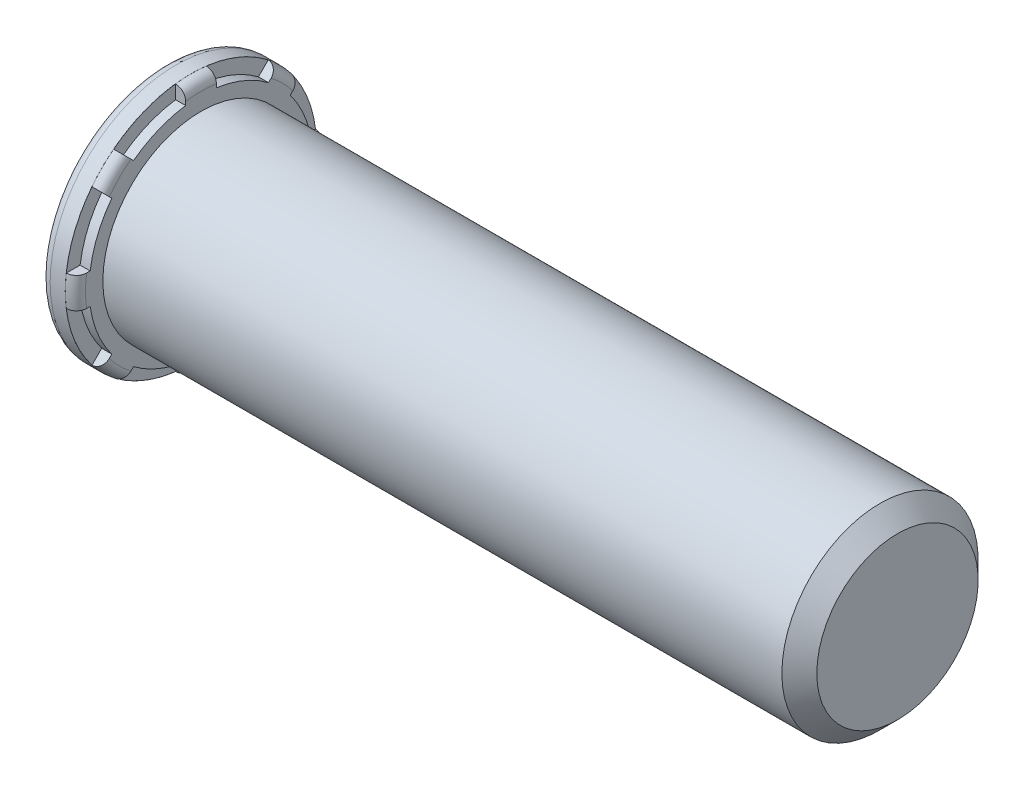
ISO-10303-21;
HEADER;
FILE_DESCRIPTION(('STEP AP214'),'2;1');
FILE_NAME('part.step','',(''),(''),'','','');
FILE_SCHEMA(('AUTOMOTIVE_DESIGN { 1 0 10303 214 1 1 1 1 }'));
ENDSEC;
DATA;
#1=APPLICATION_CONTEXT('core data for automotive mechanical design processes');
#2=APPLICATION_PROTOCOL_DEFINITION('international standard','automotive_design',2000,#1);
#3=PRODUCT_CONTEXT('',#1,'mechanical');
#4=PRODUCT('Part','Part','',(#3));
#5=PRODUCT_RELATED_PRODUCT_CATEGORY('part','',(#4));
#6=PRODUCT_DEFINITION_FORMATION('','',#4);
#7=PRODUCT_DEFINITION_CONTEXT('part definition',#1,'design');
#8=PRODUCT_DEFINITION('design','',#6,#7);
#9=PRODUCT_DEFINITION_SHAPE('','',#8);
#10=(LENGTH_UNIT() NAMED_UNIT(*) SI_UNIT(.MILLI.,.METRE.));
#11=(NAMED_UNIT(*) PLANE_ANGLE_UNIT() SI_UNIT($,.RADIAN.));
#12=(NAMED_UNIT(*) SI_UNIT($,.STERADIAN.) SOLID_ANGLE_UNIT());
#13=UNCERTAINTY_MEASURE_WITH_UNIT(LENGTH_MEASURE(1.E-05),#10,'distance_accuracy_value','');
#14=(GEOMETRIC_REPRESENTATION_CONTEXT(3) GLOBAL_UNCERTAINTY_ASSIGNED_CONTEXT((#13)) GLOBAL_UNIT_ASSIGNED_CONTEXT((#10,
#11,#12)) REPRESENTATION_CONTEXT('',''));
#15=CARTESIAN_POINT('',(0.,0.,0.));
#16=DIRECTION('',(0.,0.,1.));
#17=DIRECTION('',(1.,0.,0.));
#18=AXIS2_PLACEMENT_3D('',#15,#16,#17);
#19=CARTESIAN_POINT('',(0.00254000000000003,0.,0.));
#20=DIRECTION('',(-1.,0.,0.));
#21=DIRECTION('',(0.,0.,1.));
#22=AXIS2_PLACEMENT_3D('',#19,#20,#21);
#23=TOROIDAL_SURFACE('',#22,2.94146,0.256);
#24=CARTESIAN_POINT('',(0.0757832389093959,0.391086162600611,-3.16267012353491));
#25=CARTESIAN_POINT('',(0.0621094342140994,0.391086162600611,-3.16678339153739));
#26=CARTESIAN_POINT('',(0.0480789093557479,0.391086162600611,-3.16974617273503));
#27=CARTESIAN_POINT('',(0.019708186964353,0.391086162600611,-3.17327553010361));
#28=CARTESIAN_POINT('',(0.00536764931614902,0.391086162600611,-3.1738393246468));
#29=CARTESIAN_POINT('',(-0.0231989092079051,0.391086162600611,-3.17254932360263));
#30=CARTESIAN_POINT('',(-0.0374249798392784,0.391086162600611,-3.17069664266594));
#31=CARTESIAN_POINT('',(-0.0653604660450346,0.391086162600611,-3.16463046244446));
#32=CARTESIAN_POINT('',(-0.0790700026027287,0.391086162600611,-3.16041751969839));
#33=CARTESIAN_POINT('',(-0.105597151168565,0.391086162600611,-3.14975229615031));
#34=CARTESIAN_POINT('',(-0.118414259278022,0.391086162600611,-3.14329876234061));
#35=CARTESIAN_POINT('',(-0.142790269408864,0.391086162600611,-3.12834084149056));
#36=CARTESIAN_POINT('',(-0.15434910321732,0.391086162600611,-3.11983634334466));
#37=CARTESIAN_POINT('',(-0.175939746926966,0.39108616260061,-3.10097769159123));
#38=CARTESIAN_POINT('',(-0.185964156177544,0.39108616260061,-3.09061506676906));
#39=CARTESIAN_POINT('',(-0.204146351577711,0.39108616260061,-3.06836477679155));
#40=CARTESIAN_POINT('',(-0.212304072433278,0.39108616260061,-3.05647705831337));
#41=CARTESIAN_POINT('',(-0.226586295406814,0.39108616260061,-3.03142018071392));
#42=CARTESIAN_POINT('',(-0.232695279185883,0.39108616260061,-3.0182421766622));
#43=CARTESIAN_POINT('',(-0.242632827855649,0.391086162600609,-2.9910527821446));
#44=CARTESIAN_POINT('',(-0.246461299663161,0.391086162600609,-2.97704135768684));
#45=CARTESIAN_POINT('',(-0.251757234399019,0.391086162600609,-2.94847042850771));
#46=CARTESIAN_POINT('',(-0.253206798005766,0.391086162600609,-2.93390760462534));
#47=CARTESIAN_POINT('',(-0.253652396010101,0.391086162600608,-2.90474429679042));
#48=CARTESIAN_POINT('',(-0.252648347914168,0.391086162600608,-2.89014381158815));
#49=CARTESIAN_POINT('',(-0.248205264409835,0.391086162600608,-2.86125098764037));
#50=CARTESIAN_POINT('',(-0.244755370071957,0.391086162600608,-2.84696031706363));
#51=CARTESIAN_POINT('',(-0.235503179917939,0.391086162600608,-2.81916156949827));
#52=CARTESIAN_POINT('',(-0.229700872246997,0.391086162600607,-2.80565349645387));
#53=CARTESIAN_POINT('',(-0.215909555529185,0.391086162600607,-2.77982119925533));
#54=CARTESIAN_POINT('',(-0.207922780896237,0.391086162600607,-2.76749578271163));
#55=CARTESIAN_POINT('',(-0.189980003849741,0.391086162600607,-2.74437254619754));
#56=CARTESIAN_POINT('',(-0.180024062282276,0.391086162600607,-2.73357467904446));
#57=CARTESIAN_POINT('',(-0.158496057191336,0.391086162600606,-2.71389525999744));
#58=CARTESIAN_POINT('',(-0.146935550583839,0.391086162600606,-2.70500106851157));
#59=CARTESIAN_POINT('',(-0.122473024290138,0.391086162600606,-2.68930285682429));
#60=CARTESIAN_POINT('',(-0.109571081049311,0.391086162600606,-2.68249871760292));
#61=CARTESIAN_POINT('',(-0.08292957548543,0.391086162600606,-2.6712451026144));
#62=CARTESIAN_POINT('',(-0.0691996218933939,0.391086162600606,-2.66677287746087));
#63=CARTESIAN_POINT('',(-0.0411808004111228,0.391086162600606,-2.66021792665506));
#64=CARTESIAN_POINT('',(-0.0268919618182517,0.391086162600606,-2.65813507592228));
#65=CARTESIAN_POINT('',(0.00171670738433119,0.391086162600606,-2.65642977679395));
#66=CARTESIAN_POINT('',(0.0160353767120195,0.391086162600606,-2.65678778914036));
#67=CARTESIAN_POINT('',(0.0444081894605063,0.391086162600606,-2.65990714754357));
#68=CARTESIAN_POINT('',(0.0584623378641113,0.391086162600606,-2.662668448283));
#69=CARTESIAN_POINT('',(0.0858850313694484,0.391086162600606,-2.67050409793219));
#70=CARTESIAN_POINT('',(0.0992546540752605,0.391086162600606,-2.675574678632));
#71=CARTESIAN_POINT('',(0.124959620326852,0.391086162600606,-2.68787627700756));
#72=CARTESIAN_POINT('',(0.137294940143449,0.391086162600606,-2.69510734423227));
#73=CARTESIAN_POINT('',(0.160657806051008,0.391086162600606,-2.71156421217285));
#74=CARTESIAN_POINT('',(0.171677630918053,0.391086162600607,-2.72080097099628));
#75=CARTESIAN_POINT('',(0.192028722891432,0.391086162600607,-2.74097734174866));
#76=CARTESIAN_POINT('',(0.201359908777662,0.391086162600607,-2.75191703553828));
#77=CARTESIAN_POINT('',(0.218165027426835,0.391086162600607,-2.77530190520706));
#78=CARTESIAN_POINT('',(0.225620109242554,0.391086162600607,-2.78776062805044));
#79=CARTESIAN_POINT('',(0.238354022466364,0.391086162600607,-2.81374460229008));
#80=CARTESIAN_POINT('',(0.243632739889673,0.391086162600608,-2.82726990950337));
#81=CARTESIAN_POINT('',(0.251909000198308,0.391086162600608,-2.85513060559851));
#82=CARTESIAN_POINT('',(0.254886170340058,0.391086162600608,-2.86947204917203));
#83=CARTESIAN_POINT('',(0.258401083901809,0.391086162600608,-2.89845102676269));
#84=CARTESIAN_POINT('',(0.258938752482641,0.391086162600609,-2.91308856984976));
#85=CARTESIAN_POINT('',(0.257555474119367,0.391086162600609,-2.94230507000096));
#86=CARTESIAN_POINT('',(0.255624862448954,0.391086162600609,-2.95688357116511));
#87=CARTESIAN_POINT('',(0.249338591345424,0.391086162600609,-2.98550772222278));
#88=CARTESIAN_POINT('',(0.244983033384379,0.391086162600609,-2.9995533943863));
#89=CARTESIAN_POINT('',(0.233976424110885,0.39108616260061,-3.02667919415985));
#90=CARTESIAN_POINT('',(0.227330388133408,0.39108616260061,-3.0397613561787));
#91=CARTESIAN_POINT('',(0.211920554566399,0.39108616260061,-3.06461777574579));
#92=CARTESIAN_POINT('',(0.203156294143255,0.39108616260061,-3.07639174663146));
#93=CARTESIAN_POINT('',(0.183816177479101,0.39108616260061,-3.09821533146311));
#94=CARTESIAN_POINT('',(0.173251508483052,0.391086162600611,-3.10827486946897));
#95=CARTESIAN_POINT('',(0.150579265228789,0.391086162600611,-3.12645013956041));
#96=CARTESIAN_POINT('',(0.138473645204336,0.391086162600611,-3.13456829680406));
#97=CARTESIAN_POINT('',(0.117848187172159,0.391086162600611,-3.14598491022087));
#98=CARTESIAN_POINT('',(0.109689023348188,0.391086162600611,-3.14994844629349));
#99=CARTESIAN_POINT('',(0.0929955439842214,0.391086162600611,-3.1569858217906));
#100=CARTESIAN_POINT('',(0.084461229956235,0.391086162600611,-3.16005966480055));
#101=CARTESIAN_POINT('',(0.0757832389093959,0.391086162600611,-3.16267012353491));
#102=B_SPLINE_CURVE_WITH_KNOTS('',3,(#24,#25,#26,#27,#28,#29,#30,#31,#32,#33,#34,#35,#36,#37,
#38,#39,#40,#41,#42,#43,#44,#45,#46,#47,#48,#49,#50,#51,#52,#53,#54,#55,#56,#57,#58,#59,#60,#61,
#62,#63,#64,#65,#66,#67,#68,#69,#70,#71,#72,#73,#74,#75,#76,#77,#78,#79,#80,#81,#82,#83,#84,#85,
#86,#87,#88,#89,#90,#91,#92,#93,#94,#95,#96,#97,#98,#99,#100,#101),.UNSPECIFIED.,.T.,.F.,(4,2,2,
2,2,2,2,2,2,2,2,2,2,2,2,2,2,2,2,2,2,2,2,2,2,2,2,2,2,2,2,2,2,2,2,2,2,2,4),(0.,0.042804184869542,
0.0856579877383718,0.128492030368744,0.171315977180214,0.214163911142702,0.257014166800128,
0.300064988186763,0.34311731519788,0.386488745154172,0.429861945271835,0.473560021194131,
0.517259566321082,0.561154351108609,0.60504935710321,0.648899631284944,0.692748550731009,
0.736296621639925,0.779842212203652,0.822954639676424,0.866064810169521,0.908830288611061,
0.951594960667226,0.994290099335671,1.03698621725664,1.07992175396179,1.12285935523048,
1.16621255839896,1.2095680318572,1.25330301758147,1.29703934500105,1.34094745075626,
1.38485371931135,1.42866445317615,1.4724847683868,1.51604211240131,1.55954475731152,
1.58671026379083,1.61387566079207),.UNSPECIFIED.);
#103=CARTESIAN_POINT('',(0.258539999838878,0.391086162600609,-2.91534535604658));
#104=VERTEX_POINT('',#103);
#105=CARTESIAN_POINT('',(0.00254,0.391086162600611,-3.17345270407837));
#106=VERTEX_POINT('',#105);
#107=EDGE_CURVE('E327',#104,#106,#102,.T.);
#108=ORIENTED_EDGE('',*,*,#107,.F.);
#109=CARTESIAN_POINT('',(0.25854,0.,0.));
#110=DIRECTION('',(-1.,0.,0.));
#111=DIRECTION('',(0.,0.,1.));
#112=AXIS2_PLACEMENT_3D('',#109,#110,#111);
#113=CIRCLE('',#112,2.94146);
#114=CARTESIAN_POINT('',(0.258539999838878,-0.391086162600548,-2.91534535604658));
#115=VERTEX_POINT('',#114);
#116=EDGE_CURVE('E569',#104,#115,#113,.T.);
#117=ORIENTED_EDGE('',*,*,#116,.T.);
#118=CARTESIAN_POINT('',(0.0757832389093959,-0.391086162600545,-3.16267012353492));
#119=CARTESIAN_POINT('',(0.0895335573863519,-0.391086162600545,-3.15853247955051));
#120=CARTESIAN_POINT('',(0.102943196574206,-0.391086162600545,-3.15322528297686));
#121=CARTESIAN_POINT('',(0.128689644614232,-0.391086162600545,-3.14042594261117));
#122=CARTESIAN_POINT('',(0.141025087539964,-0.391086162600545,-3.13293106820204));
#123=CARTESIAN_POINT('',(0.164255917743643,-0.391086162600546,-3.11598418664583));
#124=CARTESIAN_POINT('',(0.17515238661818,-0.391086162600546,-3.10653366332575));
#125=CARTESIAN_POINT('',(0.195210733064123,-0.391086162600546,-3.08594860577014));
#126=CARTESIAN_POINT('',(0.204373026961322,-0.391086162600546,-3.07481447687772));
#127=CARTESIAN_POINT('',(0.220760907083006,-0.391086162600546,-3.05111605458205));
#128=CARTESIAN_POINT('',(0.227976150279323,-0.391086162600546,-3.03854460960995));
#129=CARTESIAN_POINT('',(0.240212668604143,-0.391086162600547,-3.01237533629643));
#130=CARTESIAN_POINT('',(0.24523376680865,-0.391086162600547,-2.99877742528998));
#131=CARTESIAN_POINT('',(0.252978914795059,-0.391086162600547,-2.97082872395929));
#132=CARTESIAN_POINT('',(0.255684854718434,-0.391086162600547,-2.95647291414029));
#133=CARTESIAN_POINT('',(0.258662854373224,-0.391086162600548,-2.92751095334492));
#134=CARTESIAN_POINT('',(0.258934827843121,-0.391086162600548,-2.91290479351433));
#135=CARTESIAN_POINT('',(0.257034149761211,-0.391086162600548,-2.88377077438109));
#136=CARTESIAN_POINT('',(0.254847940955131,-0.391086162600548,-2.86924379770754));
#137=CARTESIAN_POINT('',(0.248069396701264,-0.391086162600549,-2.84076221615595));
#138=CARTESIAN_POINT('',(0.243477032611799,-0.391086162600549,-2.82680761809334));
#139=CARTESIAN_POINT('',(0.232008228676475,-0.391086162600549,-2.79986128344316));
#140=CARTESIAN_POINT('',(0.225130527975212,-0.391086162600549,-2.78687008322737));
#141=CARTESIAN_POINT('',(0.20928032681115,-0.391086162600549,-2.7622350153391));
#142=CARTESIAN_POINT('',(0.200307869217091,-0.391086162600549,-2.7505911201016));
#143=CARTESIAN_POINT('',(0.180571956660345,-0.39108616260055,-2.72905279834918));
#144=CARTESIAN_POINT('',(0.16981858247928,-0.39108616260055,-2.71914913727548));
#145=CARTESIAN_POINT('',(0.146787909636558,-0.39108616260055,-2.70130872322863));
#146=CARTESIAN_POINT('',(0.134510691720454,-0.39108616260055,-2.69337186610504));
#147=CARTESIAN_POINT('',(0.108906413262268,-0.39108616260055,-2.67977193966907));
#148=CARTESIAN_POINT('',(0.0955905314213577,-0.39108616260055,-2.67408782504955));
#149=CARTESIAN_POINT('',(0.0681879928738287,-0.39108616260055,-2.6650590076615));
#150=CARTESIAN_POINT('',(0.0541013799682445,-0.39108616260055,-2.66171417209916));
#151=CARTESIAN_POINT('',(0.0256936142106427,-0.39108616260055,-2.65748615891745));
#152=CARTESIAN_POINT('',(0.0113757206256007,-0.39108616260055,-2.65658106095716));
#153=CARTESIAN_POINT('',(-0.0172075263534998,-0.39108616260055,-2.65719700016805));
#154=CARTESIAN_POINT('',(-0.0314728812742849,-0.39108616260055,-2.65871796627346));
#155=CARTESIAN_POINT('',(-0.0594937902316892,-0.39108616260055,-2.66412976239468));
#156=CARTESIAN_POINT('',(-0.0732509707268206,-0.39108616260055,-2.66801218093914));
#157=CARTESIAN_POINT('',(-0.0999220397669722,-0.39108616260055,-2.6780228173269));
#158=CARTESIAN_POINT('',(-0.112835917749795,-0.39108616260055,-2.6841510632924));
#159=CARTESIAN_POINT('',(-0.137510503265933,-0.39108616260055,-2.6985000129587));
#160=CARTESIAN_POINT('',(-0.149266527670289,-0.39108616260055,-2.70672876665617));
#161=CARTESIAN_POINT('',(-0.171246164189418,-0.39108616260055,-2.72502662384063));
#162=CARTESIAN_POINT('',(-0.181469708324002,-0.39108616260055,-2.73509580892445));
#163=CARTESIAN_POINT('',(-0.200194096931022,-0.391086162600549,-2.75688564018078));
#164=CARTESIAN_POINT('',(-0.2086784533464,-0.391086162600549,-2.76862045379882));
#165=CARTESIAN_POINT('',(-0.223578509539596,-0.391086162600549,-2.79333706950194));
#166=CARTESIAN_POINT('',(-0.229994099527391,-0.391086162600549,-2.80631893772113));
#167=CARTESIAN_POINT('',(-0.240635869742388,-0.391086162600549,-2.83329344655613));
#168=CARTESIAN_POINT('',(-0.244840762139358,-0.391086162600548,-2.84729448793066));
#169=CARTESIAN_POINT('',(-0.250854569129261,-0.391086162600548,-2.8758021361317));
#170=CARTESIAN_POINT('',(-0.252663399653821,-0.391086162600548,-2.8903087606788));
#171=CARTESIAN_POINT('',(-0.253838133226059,-0.391086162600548,-2.91949949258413));
#172=CARTESIAN_POINT('',(-0.253190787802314,-0.391086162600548,-2.93418413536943));
#173=CARTESIAN_POINT('',(-0.249438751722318,-0.391086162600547,-2.96323635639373));
#174=CARTESIAN_POINT('',(-0.246334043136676,-0.391086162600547,-2.97760393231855));
#175=CARTESIAN_POINT('',(-0.237752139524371,-0.391086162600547,-3.00560348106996));
#176=CARTESIAN_POINT('',(-0.232276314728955,-0.391086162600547,-3.01923587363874));
#177=CARTESIAN_POINT('',(-0.21910116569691,-0.391086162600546,-3.04538050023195));
#178=CARTESIAN_POINT('',(-0.211401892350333,-0.391086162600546,-3.05789275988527));
#179=CARTESIAN_POINT('',(-0.194042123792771,-0.391086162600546,-3.08136558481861));
#180=CARTESIAN_POINT('',(-0.184392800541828,-0.391086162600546,-3.09233441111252));
#181=CARTESIAN_POINT('',(-0.163376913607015,-0.391086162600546,-3.11248010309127));
#182=CARTESIAN_POINT('',(-0.152010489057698,-0.391086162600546,-3.12165711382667));
#183=CARTESIAN_POINT('',(-0.12797952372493,-0.391086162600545,-3.13788211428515));
#184=CARTESIAN_POINT('',(-0.11532598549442,-0.391086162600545,-3.14494640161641));
#185=CARTESIAN_POINT('',(-0.0890028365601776,-0.391086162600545,-3.15683504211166));
#186=CARTESIAN_POINT('',(-0.0753330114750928,-0.391086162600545,-3.16165892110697));
#187=CARTESIAN_POINT('',(-0.0474646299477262,-0.391086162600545,-3.16889686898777));
#188=CARTESIAN_POINT('',(-0.0332700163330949,-0.391086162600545,-3.17132615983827));
#189=CARTESIAN_POINT('',(-0.00468651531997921,-0.391086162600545,-3.17375359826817));
#190=CARTESIAN_POINT('',(0.00970210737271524,-0.391086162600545,-3.17375477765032));
#191=CARTESIAN_POINT('',(0.032754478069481,-0.391086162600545,-3.17180398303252));
#192=CARTESIAN_POINT('',(0.041488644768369,-0.391086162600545,-3.1706041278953));
#193=CARTESIAN_POINT('',(0.0587856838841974,-0.391086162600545,-3.16730624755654));
#194=CARTESIAN_POINT('',(0.0673485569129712,-0.391086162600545,-3.16520822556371));
#195=CARTESIAN_POINT('',(0.0757832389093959,-0.391086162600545,-3.16267012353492));
#196=B_SPLINE_CURVE_WITH_KNOTS('',3,(#118,#119,#120,#121,#122,#123,#124,#125,#126,#127,#128,
#129,#130,#131,#132,#133,#134,#135,#136,#137,#138,#139,#140,#141,#142,#143,#144,#145,#146,#147,
#148,#149,#150,#151,#152,#153,#154,#155,#156,#157,#158,#159,#160,#161,#162,#163,#164,#165,#166,
#167,#168,#169,#170,#171,#172,#173,#174,#175,#176,#177,#178,#179,#180,#181,#182,#183,#184,#185,
#186,#187,#188,#189,#190,#191,#192,#193,#194,#195),.UNSPECIFIED.,.T.,.F.,(4,2,2,2,2,2,2,2,2,2,2,
2,2,2,2,2,2,2,2,2,2,2,2,2,2,2,2,2,2,2,2,2,2,2,2,2,2,2,4),(0.,0.0430456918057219,
0.0861453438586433,0.129212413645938,0.172269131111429,0.215550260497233,0.258834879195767,
0.302455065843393,0.346076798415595,0.38994029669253,0.433804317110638,0.477692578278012,
0.521579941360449,0.565226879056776,0.608871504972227,0.652098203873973,0.695322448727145,
0.738157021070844,0.78099033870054,0.823671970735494,0.866354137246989,0.909202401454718,
0.952052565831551,0.995291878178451,1.03853348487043,1.08218419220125,1.12583643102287,
1.16972446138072,1.21361281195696,1.25747583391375,1.30133785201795,1.34495536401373,
1.3885693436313,1.43183764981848,1.47511510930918,1.51811565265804,1.56106250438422,
1.58746756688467,1.61387253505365),.UNSPECIFIED.);
#197=CARTESIAN_POINT('',(0.00254,-0.391086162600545,-3.17345270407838));
#198=VERTEX_POINT('',#197);
#199=EDGE_CURVE('E355',#198,#115,#196,.T.);
#200=ORIENTED_EDGE('',*,*,#199,.F.);
#201=CARTESIAN_POINT('',(0.00254,0.,0.));
#202=DIRECTION('',(-1.,0.,0.));
#203=DIRECTION('',(0.,0.,1.));
#204=AXIS2_PLACEMENT_3D('',#201,#202,#203);
#205=CIRCLE('',#204,3.19746);
#206=EDGE_CURVE('E543',#106,#198,#205,.T.);
#207=ORIENTED_EDGE('',*,*,#206,.F.);
#208=EDGE_LOOP('',(#108,#117,#200,#207));
#209=FACE_BOUND('',#208,.T.);
#210=ADVANCED_FACE('F33',(#209),#23,.T.);
#211=CARTESIAN_POINT('',(0.24153736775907,-1.71945064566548,-2.2725300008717));
#212=CARTESIAN_POINT('',(0.246756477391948,-1.72913345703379,-2.28221281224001));
#213=CARTESIAN_POINT('',(0.250795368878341,-1.73913050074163,-2.29220985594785));
#214=CARTESIAN_POINT('',(0.256451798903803,-1.75945539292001,-2.31253474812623));
#215=CARTESIAN_POINT('',(0.258070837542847,-1.76978303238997,-2.3228623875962));
#216=CARTESIAN_POINT('',(0.258833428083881,-1.7904886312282,-2.34356798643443));
#217=CARTESIAN_POINT('',(0.257975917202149,-1.8008666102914,-2.35394596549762));
#218=CARTESIAN_POINT('',(0.253808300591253,-1.82137106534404,-2.37445042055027));
#219=CARTESIAN_POINT('',(0.250498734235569,-1.83149759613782,-2.38457695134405));
#220=CARTESIAN_POINT('',(0.241518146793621,-1.85120455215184,-2.40428390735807));
#221=CARTESIAN_POINT('',(0.235848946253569,-1.86078539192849,-2.41386474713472));
#222=CARTESIAN_POINT('',(0.222302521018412,-1.87913427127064,-2.43221362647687));
#223=CARTESIAN_POINT('',(0.214424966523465,-1.88790218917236,-2.44098154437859));
#224=CARTESIAN_POINT('',(0.196732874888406,-1.90431878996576,-2.45739814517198));
#225=CARTESIAN_POINT('',(0.186929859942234,-1.91197368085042,-2.46505303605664));
#226=CARTESIAN_POINT('',(0.16563288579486,-1.92599929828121,-2.47907865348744));
#227=CARTESIAN_POINT('',(0.154139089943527,-1.9323701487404,-2.48544950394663));
#228=CARTESIAN_POINT('',(0.129881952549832,-1.94359542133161,-2.49667477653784));
#229=CARTESIAN_POINT('',(0.11712895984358,-1.94846103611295,-2.50154039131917));
#230=CARTESIAN_POINT('',(0.0906436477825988,-1.9565958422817,-2.50967519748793));
#231=CARTESIAN_POINT('',(0.076911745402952,-1.95986570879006,-2.51294506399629));
#232=CARTESIAN_POINT('',(0.0529887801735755,-1.96400127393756,-2.51708062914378));
#233=CARTESIAN_POINT('',(0.0429399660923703,-1.96529077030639,-2.51837012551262));
#234=CARTESIAN_POINT('',(0.022708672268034,-1.96700829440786,-2.52008764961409));
#235=CARTESIAN_POINT('',(0.0125263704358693,-1.96743737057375,-2.52051672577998));
#236=CARTESIAN_POINT('',(0.00233999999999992,-1.96743019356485,-2.52050954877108));
#237=B_SPLINE_CURVE_WITH_KNOTS('',3,(#211,#212,#213,#214,#215,#216,#217,#218,#219,#220,#221,
#222,#223,#224,#225,#226,#227,#228,#229,#230,#231,#232,#233,#234,#235,#236),.UNSPECIFIED.,.F.,
.F.,(4,2,2,2,2,2,2,2,2,2,2,2,4),(0.,0.0439044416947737,0.0877816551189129,0.131677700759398,
0.175564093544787,0.219416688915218,0.263275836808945,0.306880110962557,0.350480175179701,
0.393747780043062,0.436997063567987,0.467566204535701,0.498098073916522),.UNSPECIFIED.);
#238=CARTESIAN_POINT('',(0.258539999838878,-1.78492079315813,-2.33800014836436));
#239=VERTEX_POINT('',#238);
#240=CARTESIAN_POINT('',(0.00254,-1.96743024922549,-2.52050960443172));
#241=VERTEX_POINT('',#240);
#242=EDGE_CURVE('E348',#239,#241,#237,.T.);
#243=ORIENTED_EDGE('',*,*,#242,.F.);
#244=CARTESIAN_POINT('',(0.258539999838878,-2.33800014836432,-1.78492079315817));
#245=VERTEX_POINT('',#244);
#246=EDGE_CURVE('E676',#239,#245,#113,.T.);
#247=ORIENTED_EDGE('',*,*,#246,.T.);
#248=CARTESIAN_POINT('',(0.00234,-2.52050954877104,-1.9674301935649));
#249=CARTESIAN_POINT('',(0.0166612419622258,-2.52052646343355,-1.9674471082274));
#250=CARTESIAN_POINT('',(0.0309792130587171,-2.51966984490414,-1.96659048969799));
#251=CARTESIAN_POINT('',(0.0591981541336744,-2.51627566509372,-1.96319630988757));
#252=CARTESIAN_POINT('',(0.0730994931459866,-2.51373964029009,-1.96066028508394));
#253=CARTESIAN_POINT('',(0.100107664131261,-2.50705124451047,-1.95397188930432));
#254=CARTESIAN_POINT('',(0.113214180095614,-2.50289823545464,-1.94981888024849));
#255=CARTESIAN_POINT('',(0.138257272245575,-2.49310130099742,-1.94002194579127));
#256=CARTESIAN_POINT('',(0.150194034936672,-2.48745761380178,-1.93437825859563));
#257=CARTESIAN_POINT('',(0.172604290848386,-2.47482186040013,-1.92174250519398));
#258=CARTESIAN_POINT('',(0.183073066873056,-2.46782561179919,-1.91474625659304));
#259=CARTESIAN_POINT('',(0.202217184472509,-2.45269631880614,-1.89961696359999));
#260=CARTESIAN_POINT('',(0.210892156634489,-2.44456304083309,-1.89148368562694));
#261=CARTESIAN_POINT('',(0.22626697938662,-2.42732986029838,-1.87425050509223));
#262=CARTESIAN_POINT('',(0.232952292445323,-2.41822347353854,-1.86514411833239));
#263=CARTESIAN_POINT('',(0.244084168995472,-2.39935118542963,-1.84627183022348));
#264=CARTESIAN_POINT('',(0.248530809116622,-2.38958530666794,-1.83650595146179));
#265=CARTESIAN_POINT('',(0.25509488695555,-2.36958960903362,-1.81651025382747));
#266=CARTESIAN_POINT('',(0.257193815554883,-2.35935675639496,-1.80627740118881));
#267=CARTESIAN_POINT('',(0.25894447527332,-2.33878702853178,-1.78570767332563));
#268=CARTESIAN_POINT('',(0.25859676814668,-2.32845017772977,-1.77537082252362));
#269=CARTESIAN_POINT('',(0.255840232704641,-2.31039947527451,-1.75732012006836));
#270=CARTESIAN_POINT('',(0.253939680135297,-2.30264484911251,-1.74956549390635));
#271=CARTESIAN_POINT('',(0.248761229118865,-2.2873780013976,-1.73429864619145));
#272=CARTESIAN_POINT('',(0.245484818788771,-2.27986552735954,-1.72678617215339));
#273=CARTESIAN_POINT('',(0.241537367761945,-2.27253000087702,-1.71945064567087));
#274=B_SPLINE_CURVE_WITH_KNOTS('',3,(#248,#249,#250,#251,#252,#253,#254,#255,#256,#257,#258,
#259,#260,#261,#262,#263,#264,#265,#266,#267,#268,#269,#270,#271,#272,#273),.UNSPECIFIED.,.F.,
.F.,(4,2,2,2,2,2,2,2,2,2,2,2,4),(0.,0.0429054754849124,0.0857717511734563,0.128654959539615,
0.171531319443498,0.214542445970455,0.257562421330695,0.300889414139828,0.344214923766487,
0.387879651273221,0.431534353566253,0.464837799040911,0.49810531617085),.UNSPECIFIED.);
#275=CARTESIAN_POINT('',(0.00254,-2.52050960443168,-1.96743024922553));
#276=VERTEX_POINT('',#275);
#277=EDGE_CURVE('E375',#276,#245,#274,.T.);
#278=ORIENTED_EDGE('',*,*,#277,.F.);
#279=EDGE_CURVE('E749',#241,#276,#205,.T.);
#280=ORIENTED_EDGE('',*,*,#279,.F.);
#281=EDGE_LOOP('',(#243,#247,#278,#280));
#282=FACE_BOUND('',#281,.T.);
#283=ADVANCED_FACE('F756',(#282),#23,.T.);
#284=CARTESIAN_POINT('',(0.0757832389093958,-3.16267012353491,-0.3910861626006));
#285=CARTESIAN_POINT('',(0.0621094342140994,-3.16678339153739,-0.3910861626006));
#286=CARTESIAN_POINT('',(0.0480789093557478,-3.16974617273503,-0.3910861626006));
#287=CARTESIAN_POINT('',(0.0197081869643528,-3.17327553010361,-0.3910861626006));
#288=CARTESIAN_POINT('',(0.0053676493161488,-3.1738393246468,-0.3910861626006));
#289=CARTESIAN_POINT('',(-0.0231989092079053,-3.17254932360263,-0.3910861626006));
#290=CARTESIAN_POINT('',(-0.0374249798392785,-3.17069664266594,-0.3910861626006));
#291=CARTESIAN_POINT('',(-0.0653604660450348,-3.16463046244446,-0.3910861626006));
#292=CARTESIAN_POINT('',(-0.0790700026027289,-3.16041751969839,-0.3910861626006));
#293=CARTESIAN_POINT('',(-0.105597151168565,-3.14975229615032,-0.3910861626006));
#294=CARTESIAN_POINT('',(-0.118414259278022,-3.14329876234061,-0.3910861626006));
#295=CARTESIAN_POINT('',(-0.142790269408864,-3.12834084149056,-0.3910861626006));
#296=CARTESIAN_POINT('',(-0.154349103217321,-3.11983634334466,-0.3910861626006));
#297=CARTESIAN_POINT('',(-0.175939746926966,-3.10097769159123,-0.3910861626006));
#298=CARTESIAN_POINT('',(-0.185964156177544,-3.09061506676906,-0.3910861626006));
#299=CARTESIAN_POINT('',(-0.204146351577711,-3.06836477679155,-0.3910861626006));
#300=CARTESIAN_POINT('',(-0.212304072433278,-3.05647705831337,-0.3910861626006));
#301=CARTESIAN_POINT('',(-0.226586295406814,-3.03142018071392,-0.391086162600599));
#302=CARTESIAN_POINT('',(-0.232695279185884,-3.01824217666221,-0.391086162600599));
#303=CARTESIAN_POINT('',(-0.242632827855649,-2.99105278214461,-0.391086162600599));
#304=CARTESIAN_POINT('',(-0.246461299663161,-2.97704135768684,-0.391086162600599));
#305=CARTESIAN_POINT('',(-0.251757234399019,-2.94847042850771,-0.391086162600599));
#306=CARTESIAN_POINT('',(-0.253206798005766,-2.93390760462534,-0.391086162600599));
#307=CARTESIAN_POINT('',(-0.253652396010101,-2.90474429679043,-0.391086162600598));
#308=CARTESIAN_POINT('',(-0.252648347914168,-2.89014381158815,-0.391086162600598));
#309=CARTESIAN_POINT('',(-0.248205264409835,-2.86125098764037,-0.391086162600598));
#310=CARTESIAN_POINT('',(-0.244755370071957,-2.84696031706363,-0.391086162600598));
#311=CARTESIAN_POINT('',(-0.235503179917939,-2.81916156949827,-0.391086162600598));
#312=CARTESIAN_POINT('',(-0.229700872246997,-2.80565349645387,-0.391086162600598));
#313=CARTESIAN_POINT('',(-0.215909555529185,-2.77982119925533,-0.391086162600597));
#314=CARTESIAN_POINT('',(-0.207922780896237,-2.76749578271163,-0.391086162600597));
#315=CARTESIAN_POINT('',(-0.189980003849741,-2.74437254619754,-0.391086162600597));
#316=CARTESIAN_POINT('',(-0.180024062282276,-2.73357467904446,-0.391086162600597));
#317=CARTESIAN_POINT('',(-0.158496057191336,-2.71389525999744,-0.391086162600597));
#318=CARTESIAN_POINT('',(-0.146935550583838,-2.70500106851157,-0.391086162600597));
#319=CARTESIAN_POINT('',(-0.122473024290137,-2.68930285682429,-0.391086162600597));
#320=CARTESIAN_POINT('',(-0.109571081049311,-2.68249871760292,-0.391086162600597));
#321=CARTESIAN_POINT('',(-0.0829295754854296,-2.6712451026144,-0.391086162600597));
#322=CARTESIAN_POINT('',(-0.0691996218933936,-2.66677287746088,-0.391086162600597));
#323=CARTESIAN_POINT('',(-0.0411808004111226,-2.66021792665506,-0.391086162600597));
#324=CARTESIAN_POINT('',(-0.0268919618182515,-2.65813507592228,-0.391086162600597));
#325=CARTESIAN_POINT('',(0.00171670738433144,-2.65642977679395,-0.391086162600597));
#326=CARTESIAN_POINT('',(0.0160353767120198,-2.65678778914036,-0.391086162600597));
#327=CARTESIAN_POINT('',(0.0444081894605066,-2.65990714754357,-0.391086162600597));
#328=CARTESIAN_POINT('',(0.0584623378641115,-2.662668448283,-0.391086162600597));
#329=CARTESIAN_POINT('',(0.0858850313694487,-2.67050409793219,-0.391086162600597));
#330=CARTESIAN_POINT('',(0.0992546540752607,-2.675574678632,-0.391086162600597));
#331=CARTESIAN_POINT('',(0.124959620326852,-2.68787627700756,-0.391086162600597));
#332=CARTESIAN_POINT('',(0.137294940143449,-2.69510734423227,-0.391086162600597));
#333=CARTESIAN_POINT('',(0.160657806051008,-2.71156421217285,-0.391086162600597));
#334=CARTESIAN_POINT('',(0.171677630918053,-2.72080097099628,-0.391086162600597));
#335=CARTESIAN_POINT('',(0.192028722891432,-2.74097734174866,-0.391086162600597));
#336=CARTESIAN_POINT('',(0.201359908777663,-2.75191703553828,-0.391086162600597));
#337=CARTESIAN_POINT('',(0.218165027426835,-2.77530190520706,-0.391086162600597));
#338=CARTESIAN_POINT('',(0.225620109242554,-2.78776062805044,-0.391086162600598));
#339=CARTESIAN_POINT('',(0.238354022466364,-2.81374460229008,-0.391086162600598));
#340=CARTESIAN_POINT('',(0.243632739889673,-2.82726990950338,-0.391086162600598));
#341=CARTESIAN_POINT('',(0.251909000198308,-2.85513060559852,-0.391086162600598));
#342=CARTESIAN_POINT('',(0.254886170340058,-2.86947204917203,-0.391086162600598));
#343=CARTESIAN_POINT('',(0.258401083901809,-2.89845102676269,-0.391086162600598));
#344=CARTESIAN_POINT('',(0.258938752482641,-2.91308856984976,-0.391086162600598));
#345=CARTESIAN_POINT('',(0.257555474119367,-2.94230507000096,-0.391086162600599));
#346=CARTESIAN_POINT('',(0.255624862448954,-2.95688357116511,-0.391086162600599));
#347=CARTESIAN_POINT('',(0.249338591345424,-2.98550772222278,-0.391086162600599));
#348=CARTESIAN_POINT('',(0.244983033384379,-2.99955339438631,-0.391086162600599));
#349=CARTESIAN_POINT('',(0.233976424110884,-3.02667919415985,-0.391086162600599));
#350=CARTESIAN_POINT('',(0.227330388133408,-3.0397613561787,-0.391086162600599));
#351=CARTESIAN_POINT('',(0.211920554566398,-3.06461777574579,-0.3910861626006));
#352=CARTESIAN_POINT('',(0.203156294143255,-3.07639174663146,-0.3910861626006));
#353=CARTESIAN_POINT('',(0.1838161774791,-3.09821533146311,-0.3910861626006));
#354=CARTESIAN_POINT('',(0.173251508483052,-3.10827486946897,-0.3910861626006));
#355=CARTESIAN_POINT('',(0.150579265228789,-3.12645013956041,-0.3910861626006));
#356=CARTESIAN_POINT('',(0.138473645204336,-3.13456829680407,-0.3910861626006));
#357=CARTESIAN_POINT('',(0.117848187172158,-3.14598491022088,-0.3910861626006));
#358=CARTESIAN_POINT('',(0.109689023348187,-3.14994844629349,-0.3910861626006));
#359=CARTESIAN_POINT('',(0.092995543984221,-3.1569858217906,-0.3910861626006));
#360=CARTESIAN_POINT('',(0.0844612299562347,-3.16005966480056,-0.3910861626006));
#361=CARTESIAN_POINT('',(0.0757832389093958,-3.16267012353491,-0.3910861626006));
#362=B_SPLINE_CURVE_WITH_KNOTS('',3,(#284,#285,#286,#287,#288,#289,#290,#291,#292,#293,#294,
#295,#296,#297,#298,#299,#300,#301,#302,#303,#304,#305,#306,#307,#308,#309,#310,#311,#312,#313,
#314,#315,#316,#317,#318,#319,#320,#321,#322,#323,#324,#325,#326,#327,#328,#329,#330,#331,#332,
#333,#334,#335,#336,#337,#338,#339,#340,#341,#342,#343,#344,#345,#346,#347,#348,#349,#350,#351,
#352,#353,#354,#355,#356,#357,#358,#359,#360,#361),.UNSPECIFIED.,.T.,.F.,(4,2,2,2,2,2,2,2,2,2,2,
2,2,2,2,2,2,2,2,2,2,2,2,2,2,2,2,2,2,2,2,2,2,2,2,2,2,2,4),(0.,0.042804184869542,
0.0856579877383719,0.128492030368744,0.171315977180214,0.214163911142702,0.257014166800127,
0.300064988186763,0.34311731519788,0.386488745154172,0.429861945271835,0.473560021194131,
0.517259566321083,0.561154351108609,0.60504935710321,0.648899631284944,0.692748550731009,
0.736296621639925,0.779842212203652,0.822954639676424,0.866064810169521,0.908830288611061,
0.951594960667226,0.99429009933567,1.03698621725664,1.07992175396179,1.12285935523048,
1.16621255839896,1.2095680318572,1.25330301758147,1.29703934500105,1.34094745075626,
1.38485371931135,1.42866445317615,1.47248476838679,1.51604211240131,1.55954475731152,
1.58671026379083,1.61387566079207),.UNSPECIFIED.);
#363=CARTESIAN_POINT('',(0.258539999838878,-2.91534535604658,-0.391086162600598));
#364=VERTEX_POINT('',#363);
#365=CARTESIAN_POINT('',(0.00254,-3.17345270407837,-0.3910861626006));
#366=VERTEX_POINT('',#365);
#367=EDGE_CURVE('E384',#364,#366,#362,.T.);
#368=ORIENTED_EDGE('',*,*,#367,.F.);
#369=CARTESIAN_POINT('',(0.258539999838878,-2.91534535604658,0.391086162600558));
#370=VERTEX_POINT('',#369);
#371=EDGE_CURVE('E680',#364,#370,#113,.T.);
#372=ORIENTED_EDGE('',*,*,#371,.T.);
#373=CARTESIAN_POINT('',(0.0757832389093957,-3.16267012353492,0.391086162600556));
#374=CARTESIAN_POINT('',(0.0895335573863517,-3.15853247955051,0.391086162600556));
#375=CARTESIAN_POINT('',(0.102943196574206,-3.15322528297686,0.391086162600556));
#376=CARTESIAN_POINT('',(0.128689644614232,-3.14042594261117,0.391086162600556));
#377=CARTESIAN_POINT('',(0.141025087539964,-3.13293106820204,0.391086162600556));
#378=CARTESIAN_POINT('',(0.164255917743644,-3.11598418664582,0.391086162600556));
#379=CARTESIAN_POINT('',(0.17515238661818,-3.10653366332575,0.391086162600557));
#380=CARTESIAN_POINT('',(0.195210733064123,-3.08594860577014,0.391086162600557));
#381=CARTESIAN_POINT('',(0.204373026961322,-3.07481447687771,0.391086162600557));
#382=CARTESIAN_POINT('',(0.220760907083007,-3.05111605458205,0.391086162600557));
#383=CARTESIAN_POINT('',(0.227976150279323,-3.03854460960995,0.391086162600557));
#384=CARTESIAN_POINT('',(0.240212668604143,-3.01237533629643,0.391086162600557));
#385=CARTESIAN_POINT('',(0.24523376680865,-2.99877742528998,0.391086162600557));
#386=CARTESIAN_POINT('',(0.252978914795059,-2.97082872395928,0.391086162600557));
#387=CARTESIAN_POINT('',(0.255684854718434,-2.95647291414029,0.391086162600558));
#388=CARTESIAN_POINT('',(0.258662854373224,-2.92751095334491,0.391086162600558));
#389=CARTESIAN_POINT('',(0.258934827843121,-2.91290479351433,0.391086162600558));
#390=CARTESIAN_POINT('',(0.257034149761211,-2.88377077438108,0.391086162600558));
#391=CARTESIAN_POINT('',(0.254847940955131,-2.86924379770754,0.391086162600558));
#392=CARTESIAN_POINT('',(0.248069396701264,-2.84076221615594,0.391086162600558));
#393=CARTESIAN_POINT('',(0.243477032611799,-2.82680761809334,0.391086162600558));
#394=CARTESIAN_POINT('',(0.232008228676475,-2.79986128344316,0.391086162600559));
#395=CARTESIAN_POINT('',(0.225130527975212,-2.78687008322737,0.391086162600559));
#396=CARTESIAN_POINT('',(0.209280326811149,-2.76223501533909,0.391086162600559));
#397=CARTESIAN_POINT('',(0.200307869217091,-2.7505911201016,0.391086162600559));
#398=CARTESIAN_POINT('',(0.180571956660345,-2.72905279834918,0.391086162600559));
#399=CARTESIAN_POINT('',(0.16981858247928,-2.71914913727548,0.391086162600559));
#400=CARTESIAN_POINT('',(0.146787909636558,-2.70130872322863,0.391086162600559));
#401=CARTESIAN_POINT('',(0.134510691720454,-2.69337186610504,0.391086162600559));
#402=CARTESIAN_POINT('',(0.108906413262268,-2.67977193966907,0.39108616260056));
#403=CARTESIAN_POINT('',(0.0955905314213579,-2.67408782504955,0.39108616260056));
#404=CARTESIAN_POINT('',(0.0681879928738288,-2.6650590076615,0.39108616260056));
#405=CARTESIAN_POINT('',(0.0541013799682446,-2.66171417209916,0.39108616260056));
#406=CARTESIAN_POINT('',(0.0256936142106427,-2.65748615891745,0.39108616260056));
#407=CARTESIAN_POINT('',(0.0113757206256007,-2.65658106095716,0.39108616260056));
#408=CARTESIAN_POINT('',(-0.0172075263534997,-2.65719700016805,0.39108616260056));
#409=CARTESIAN_POINT('',(-0.0314728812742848,-2.65871796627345,0.39108616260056));
#410=CARTESIAN_POINT('',(-0.0594937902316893,-2.66412976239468,0.39108616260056));
#411=CARTESIAN_POINT('',(-0.0732509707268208,-2.66801218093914,0.39108616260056));
#412=CARTESIAN_POINT('',(-0.0999220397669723,-2.6780228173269,0.391086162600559));
#413=CARTESIAN_POINT('',(-0.112835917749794,-2.6841510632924,0.391086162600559));
#414=CARTESIAN_POINT('',(-0.137510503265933,-2.6985000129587,0.391086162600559));
#415=CARTESIAN_POINT('',(-0.149266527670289,-2.70672876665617,0.391086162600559));
#416=CARTESIAN_POINT('',(-0.171246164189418,-2.72502662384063,0.391086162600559));
#417=CARTESIAN_POINT('',(-0.181469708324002,-2.73509580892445,0.391086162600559));
#418=CARTESIAN_POINT('',(-0.200194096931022,-2.75688564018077,0.391086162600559));
#419=CARTESIAN_POINT('',(-0.2086784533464,-2.76862045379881,0.391086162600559));
#420=CARTESIAN_POINT('',(-0.223578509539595,-2.79333706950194,0.391086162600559));
#421=CARTESIAN_POINT('',(-0.22999409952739,-2.80631893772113,0.391086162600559));
#422=CARTESIAN_POINT('',(-0.240635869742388,-2.83329344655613,0.391086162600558));
#423=CARTESIAN_POINT('',(-0.244840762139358,-2.84729448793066,0.391086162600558));
#424=CARTESIAN_POINT('',(-0.250854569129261,-2.87580213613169,0.391086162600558));
#425=CARTESIAN_POINT('',(-0.252663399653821,-2.8903087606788,0.391086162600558));
#426=CARTESIAN_POINT('',(-0.253838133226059,-2.91949949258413,0.391086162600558));
#427=CARTESIAN_POINT('',(-0.253190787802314,-2.93418413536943,0.391086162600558));
#428=CARTESIAN_POINT('',(-0.249438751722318,-2.96323635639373,0.391086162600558));
#429=CARTESIAN_POINT('',(-0.246334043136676,-2.97760393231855,0.391086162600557));
#430=CARTESIAN_POINT('',(-0.237752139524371,-3.00560348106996,0.391086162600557));
#431=CARTESIAN_POINT('',(-0.232276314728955,-3.01923587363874,0.391086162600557));
#432=CARTESIAN_POINT('',(-0.219101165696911,-3.04538050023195,0.391086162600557));
#433=CARTESIAN_POINT('',(-0.211401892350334,-3.05789275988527,0.391086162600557));
#434=CARTESIAN_POINT('',(-0.194042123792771,-3.08136558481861,0.391086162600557));
#435=CARTESIAN_POINT('',(-0.184392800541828,-3.09233441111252,0.391086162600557));
#436=CARTESIAN_POINT('',(-0.163376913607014,-3.11248010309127,0.391086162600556));
#437=CARTESIAN_POINT('',(-0.152010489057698,-3.12165711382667,0.391086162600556));
#438=CARTESIAN_POINT('',(-0.12797952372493,-3.13788211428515,0.391086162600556));
#439=CARTESIAN_POINT('',(-0.11532598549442,-3.14494640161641,0.391086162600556));
#440=CARTESIAN_POINT('',(-0.0890028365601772,-3.15683504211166,0.391086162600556));
#441=CARTESIAN_POINT('',(-0.0753330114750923,-3.16165892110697,0.391086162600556));
#442=CARTESIAN_POINT('',(-0.0474646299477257,-3.16889686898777,0.391086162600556));
#443=CARTESIAN_POINT('',(-0.0332700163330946,-3.17132615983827,0.391086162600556));
#444=CARTESIAN_POINT('',(-0.0046865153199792,-3.17375359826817,0.391086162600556));
#445=CARTESIAN_POINT('',(0.00970210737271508,-3.17375477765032,0.391086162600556));
#446=CARTESIAN_POINT('',(0.0327544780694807,-3.17180398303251,0.391086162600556));
#447=CARTESIAN_POINT('',(0.0414886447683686,-3.1706041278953,0.391086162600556));
#448=CARTESIAN_POINT('',(0.058785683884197,-3.16730624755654,0.391086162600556));
#449=CARTESIAN_POINT('',(0.0673485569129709,-3.16520822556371,0.391086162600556));
#450=CARTESIAN_POINT('',(0.0757832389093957,-3.16267012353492,0.391086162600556));
#451=B_SPLINE_CURVE_WITH_KNOTS('',3,(#373,#374,#375,#376,#377,#378,#379,#380,#381,#382,#383,
#384,#385,#386,#387,#388,#389,#390,#391,#392,#393,#394,#395,#396,#397,#398,#399,#400,#401,#402,
#403,#404,#405,#406,#407,#408,#409,#410,#411,#412,#413,#414,#415,#416,#417,#418,#419,#420,#421,
#422,#423,#424,#425,#426,#427,#428,#429,#430,#431,#432,#433,#434,#435,#436,#437,#438,#439,#440,
#441,#442,#443,#444,#445,#446,#447,#448,#449,#450),.UNSPECIFIED.,.T.,.F.,(4,2,2,2,2,2,2,2,2,2,2,
2,2,2,2,2,2,2,2,2,2,2,2,2,2,2,2,2,2,2,2,2,2,2,2,2,2,2,4),(0.,0.0430456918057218,
0.0861453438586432,0.129212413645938,0.17226913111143,0.215550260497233,0.258834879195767,
0.302455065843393,0.346076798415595,0.38994029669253,0.433804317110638,0.477692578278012,
0.521579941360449,0.565226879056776,0.608871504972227,0.652098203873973,0.695322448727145,
0.738157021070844,0.78099033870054,0.823671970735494,0.866354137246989,0.909202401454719,
0.952052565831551,0.995291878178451,1.03853348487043,1.08218419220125,1.12583643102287,
1.16972446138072,1.21361281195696,1.25747583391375,1.30133785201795,1.34495536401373,
1.3885693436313,1.43183764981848,1.47511510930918,1.51811565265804,1.56106250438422,
1.58746756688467,1.61387253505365),.UNSPECIFIED.);
#452=CARTESIAN_POINT('',(0.00254,-3.17345270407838,0.391086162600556));
#453=VERTEX_POINT('',#452);
#454=EDGE_CURVE('E415',#453,#370,#451,.T.);
#455=ORIENTED_EDGE('',*,*,#454,.F.);
#456=EDGE_CURVE('E746',#366,#453,#205,.T.);
#457=ORIENTED_EDGE('',*,*,#456,.F.);
#458=EDGE_LOOP('',(#368,#372,#455,#457));
#459=FACE_BOUND('',#458,.T.);
#460=ADVANCED_FACE('F758',(#459),#23,.T.);
#461=CARTESIAN_POINT('',(0.241537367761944,-2.27253000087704,1.71945064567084));
#462=CARTESIAN_POINT('',(0.246756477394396,-2.28221281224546,1.72913345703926));
#463=CARTESIAN_POINT('',(0.250795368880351,-2.29220985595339,1.73913050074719));
#464=CARTESIAN_POINT('',(0.256451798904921,-2.3125347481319,1.75945539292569));
#465=CARTESIAN_POINT('',(0.258070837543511,-2.3228623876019,1.76978303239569));
#466=CARTESIAN_POINT('',(0.258833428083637,-2.34356798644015,1.79048863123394));
#467=CARTESIAN_POINT('',(0.257975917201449,-2.35394596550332,1.80086661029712));
#468=CARTESIAN_POINT('',(0.253808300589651,-2.37445042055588,1.82137106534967));
#469=CARTESIAN_POINT('',(0.25049873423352,-2.38457695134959,1.83149759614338));
#470=CARTESIAN_POINT('',(0.241518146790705,-2.40428390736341,1.8512045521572));
#471=CARTESIAN_POINT('',(0.235848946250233,-2.41386474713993,1.86078539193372));
#472=CARTESIAN_POINT('',(0.22230252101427,-2.43221362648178,1.87913427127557));
#473=CARTESIAN_POINT('',(0.214424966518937,-2.44098154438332,1.8879021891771));
#474=CARTESIAN_POINT('',(0.196732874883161,-2.45739814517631,1.9043187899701));
#475=CARTESIAN_POINT('',(0.186929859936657,-2.46505303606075,1.91197368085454));
#476=CARTESIAN_POINT('',(0.165632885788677,-2.47907865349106,1.92599929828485));
#477=CARTESIAN_POINT('',(0.154139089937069,-2.48544950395,1.93237014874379));
#478=CARTESIAN_POINT('',(0.129881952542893,-2.49667477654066,1.94359542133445));
#479=CARTESIAN_POINT('',(0.117128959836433,-2.50154039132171,1.9484610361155));
#480=CARTESIAN_POINT('',(0.0906436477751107,-2.50967519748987,1.95659584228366));
#481=CARTESIAN_POINT('',(0.0769117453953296,-2.51294506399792,1.95986570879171));
#482=CARTESIAN_POINT('',(0.0529887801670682,-2.51708062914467,1.96400127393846));
#483=CARTESIAN_POINT('',(0.0429399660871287,-2.51837012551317,1.96529077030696));
#484=CARTESIAN_POINT('',(0.0227086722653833,-2.5200876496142,1.96700829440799));
#485=CARTESIAN_POINT('',(0.0125263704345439,-2.52051672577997,1.96743737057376));
#486=CARTESIAN_POINT('',(0.00233999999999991,-2.52050954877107,1.96743019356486));
#487=B_SPLINE_CURVE_WITH_KNOTS('',3,(#461,#462,#463,#464,#465,#466,#467,#468,#469,#470,#471,
#472,#473,#474,#475,#476,#477,#478,#479,#480,#481,#482,#483,#484,#485,#486),.UNSPECIFIED.,.F.,
.F.,(4,2,2,2,2,2,2,2,2,2,2,2,4),(0.,0.0439044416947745,0.087781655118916,0.131677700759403,
0.175564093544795,0.219416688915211,0.263275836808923,0.306880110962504,0.35048017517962,
0.393747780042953,0.436997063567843,0.467566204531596,0.498098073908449),.UNSPECIFIED.);
#488=CARTESIAN_POINT('',(0.258539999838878,-2.33800014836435,1.78492079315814));
#489=VERTEX_POINT('',#488);
#490=CARTESIAN_POINT('',(0.00254,-2.52050960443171,1.9674302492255));
#491=VERTEX_POINT('',#490);
#492=EDGE_CURVE('E408',#489,#491,#487,.T.);
#493=ORIENTED_EDGE('',*,*,#492,.F.);
#494=CARTESIAN_POINT('',(0.258539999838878,-1.78492079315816,2.33800014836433));
#495=VERTEX_POINT('',#494);
#496=EDGE_CURVE('E681',#489,#495,#113,.T.);
#497=ORIENTED_EDGE('',*,*,#496,.T.);
#498=CARTESIAN_POINT('',(0.00234,-1.96743019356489,2.52050954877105));
#499=CARTESIAN_POINT('',(0.0166612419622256,-1.96744710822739,2.52052646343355));
#500=CARTESIAN_POINT('',(0.030979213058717,-1.96659048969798,2.51966984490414));
#501=CARTESIAN_POINT('',(0.0591981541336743,-1.96319630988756,2.51627566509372));
#502=CARTESIAN_POINT('',(0.0730994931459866,-1.96066028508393,2.5137396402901));
#503=CARTESIAN_POINT('',(0.100107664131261,-1.95397188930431,2.50705124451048));
#504=CARTESIAN_POINT('',(0.113214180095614,-1.94981888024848,2.50289823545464));
#505=CARTESIAN_POINT('',(0.138257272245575,-1.94002194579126,2.49310130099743));
#506=CARTESIAN_POINT('',(0.150194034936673,-1.93437825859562,2.48745761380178));
#507=CARTESIAN_POINT('',(0.172604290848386,-1.92174250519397,2.47482186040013));
#508=CARTESIAN_POINT('',(0.183073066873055,-1.91474625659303,2.46782561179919));
#509=CARTESIAN_POINT('',(0.202217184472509,-1.89961696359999,2.45269631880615));
#510=CARTESIAN_POINT('',(0.210892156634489,-1.89148368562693,2.4445630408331));
#511=CARTESIAN_POINT('',(0.22626697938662,-1.87425050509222,2.42732986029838));
#512=CARTESIAN_POINT('',(0.232952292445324,-1.86514411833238,2.41822347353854));
#513=CARTESIAN_POINT('',(0.244084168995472,-1.84627183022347,2.39935118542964));
#514=CARTESIAN_POINT('',(0.248530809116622,-1.83650595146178,2.38958530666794));
#515=CARTESIAN_POINT('',(0.25509488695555,-1.81651025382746,2.36958960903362));
#516=CARTESIAN_POINT('',(0.257193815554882,-1.8062774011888,2.35935675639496));
#517=CARTESIAN_POINT('',(0.25894447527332,-1.78570767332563,2.33878702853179));
#518=CARTESIAN_POINT('',(0.258596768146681,-1.77537082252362,2.32845017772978));
#519=CARTESIAN_POINT('',(0.255840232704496,-1.7573201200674,2.31039947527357));
#520=CARTESIAN_POINT('',(0.253939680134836,-1.74956549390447,2.30264484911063));
#521=CARTESIAN_POINT('',(0.248761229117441,-1.73429864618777,2.28737800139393));
#522=CARTESIAN_POINT('',(0.2454848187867,-1.72678617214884,2.279865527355));
#523=CARTESIAN_POINT('',(0.24153736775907,-1.71945064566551,2.27253000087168));
#524=B_SPLINE_CURVE_WITH_KNOTS('',3,(#498,#499,#500,#501,#502,#503,#504,#505,#506,#507,#508,
#509,#510,#511,#512,#513,#514,#515,#516,#517,#518,#519,#520,#521,#522,#523),.UNSPECIFIED.,.F.,
.F.,(4,2,2,2,2,2,2,2,2,2,2,2,4),(0.,0.0429054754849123,0.0857717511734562,0.128654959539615,
0.171531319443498,0.214542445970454,0.257562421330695,0.300889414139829,0.344214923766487,
0.387879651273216,0.431534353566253,0.464837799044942,0.498105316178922),.UNSPECIFIED.);
#525=CARTESIAN_POINT('',(0.00254,-1.96743024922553,2.52050960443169));
#526=VERTEX_POINT('',#525);
#527=EDGE_CURVE('E435',#526,#495,#524,.T.);
#528=ORIENTED_EDGE('',*,*,#527,.F.);
#529=EDGE_CURVE('E743',#491,#526,#205,.T.);
#530=ORIENTED_EDGE('',*,*,#529,.F.);
#531=EDGE_LOOP('',(#493,#497,#528,#530));
#532=FACE_BOUND('',#531,.T.);
#533=ADVANCED_FACE('F763',(#532),#23,.T.);
#534=CARTESIAN_POINT('',(0.251031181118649,-0.391086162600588,2.85323427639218));
#535=CARTESIAN_POINT('',(0.254516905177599,-0.391086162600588,2.86744168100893));
#536=CARTESIAN_POINT('',(0.256805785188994,-0.391086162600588,2.88195387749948));
#537=CARTESIAN_POINT('',(0.258918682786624,-0.391086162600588,2.91116908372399));
#538=CARTESIAN_POINT('',(0.258739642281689,-0.391086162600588,2.92587230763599));
#539=CARTESIAN_POINT('',(0.255915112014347,-0.391086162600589,2.95503567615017));
#540=CARTESIAN_POINT('',(0.253270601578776,-0.391086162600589,2.96949591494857));
#541=CARTESIAN_POINT('',(0.24558653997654,-0.391086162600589,2.99776130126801));
#542=CARTESIAN_POINT('',(0.240547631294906,-0.391086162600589,3.0115666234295));
#543=CARTESIAN_POINT('',(0.228225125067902,-0.391086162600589,3.03810013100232));
#544=CARTESIAN_POINT('',(0.220946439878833,-0.391086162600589,3.05083059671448));
#545=CARTESIAN_POINT('',(0.204340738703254,-0.391086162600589,3.07487812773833));
#546=CARTESIAN_POINT('',(0.195013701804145,-0.391086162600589,3.08619517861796));
#547=CARTESIAN_POINT('',(0.174644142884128,-0.391086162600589,3.10700947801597));
#548=CARTESIAN_POINT('',(0.16361390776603,-0.391086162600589,3.11651874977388));
#549=CARTESIAN_POINT('',(0.14010288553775,-0.391086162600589,3.13353299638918));
#550=CARTESIAN_POINT('',(0.127622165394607,-0.391086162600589,3.14103806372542));
#551=CARTESIAN_POINT('',(0.101669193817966,-0.391086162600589,3.15376993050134));
#552=CARTESIAN_POINT('',(0.0882054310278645,-0.391086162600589,3.15901403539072));
#553=CARTESIAN_POINT('',(0.0605856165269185,-0.391086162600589,3.16715263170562));
#554=CARTESIAN_POINT('',(0.0464295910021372,-0.391086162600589,3.17004721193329));
#555=CARTESIAN_POINT('',(0.0179142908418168,-0.391086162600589,3.17339069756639));
#556=CARTESIAN_POINT('',(0.00355665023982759,-0.391086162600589,3.17385355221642));
#557=CARTESIAN_POINT('',(-0.0250317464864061,-0.391086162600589,3.17235753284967));
#558=CARTESIAN_POINT('',(-0.0392625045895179,-0.391086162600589,3.17039869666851));
#559=CARTESIAN_POINT('',(-0.0671676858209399,-0.391086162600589,3.16412294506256));
#560=CARTESIAN_POINT('',(-0.0808430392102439,-0.391086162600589,3.1598101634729));
#561=CARTESIAN_POINT('',(-0.10727845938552,-0.391086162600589,3.14895607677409));
#562=CARTESIAN_POINT('',(-0.120038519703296,-0.391086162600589,3.14241475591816));
#563=CARTESIAN_POINT('',(-0.14432102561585,-0.391086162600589,3.12727301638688));
#564=CARTESIAN_POINT('',(-0.155839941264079,-0.391086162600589,3.11866693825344));
#565=CARTESIAN_POINT('',(-0.177280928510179,-0.391086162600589,3.09965435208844));
#566=CARTESIAN_POINT('',(-0.187202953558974,-0.391086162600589,3.08924779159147));
#567=CARTESIAN_POINT('',(-0.205237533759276,-0.391086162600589,3.06685976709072));
#568=CARTESIAN_POINT('',(-0.213338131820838,-0.391086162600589,3.05486867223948));
#569=CARTESIAN_POINT('',(-0.227429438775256,-0.391086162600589,3.0297051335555));
#570=CARTESIAN_POINT('',(-0.233420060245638,-0.391086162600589,3.01653264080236));
#571=CARTESIAN_POINT('',(-0.243170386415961,-0.391086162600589,2.98926980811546));
#572=CARTESIAN_POINT('',(-0.246912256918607,-0.391086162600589,2.9751730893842));
#573=CARTESIAN_POINT('',(-0.251992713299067,-0.391086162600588,2.94655298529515));
#574=CARTESIAN_POINT('',(-0.253331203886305,-0.391086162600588,2.93202958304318));
#575=CARTESIAN_POINT('',(-0.253571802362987,-0.391086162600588,2.90287093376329));
#576=CARTESIAN_POINT('',(-0.252458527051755,-0.391086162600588,2.88823555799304));
#577=CARTESIAN_POINT('',(-0.247795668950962,-0.391086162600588,2.85935793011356));
#578=CARTESIAN_POINT('',(-0.24424603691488,-0.391086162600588,2.84511568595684));
#579=CARTESIAN_POINT('',(-0.234798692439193,-0.391086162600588,2.81740317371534));
#580=CARTESIAN_POINT('',(-0.228896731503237,-0.391086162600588,2.80393435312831));
#581=CARTESIAN_POINT('',(-0.21490622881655,-0.391086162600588,2.77818429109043));
#582=CARTESIAN_POINT('',(-0.206817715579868,-0.391086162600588,2.76590303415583));
#583=CARTESIAN_POINT('',(-0.188715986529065,-0.391086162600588,2.74293552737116));
#584=CARTESIAN_POINT('',(-0.17871101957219,-0.391086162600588,2.73224277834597));
#585=CARTESIAN_POINT('',(-0.157033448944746,-0.391086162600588,2.71270739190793));
#586=CARTESIAN_POINT('',(-0.145360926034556,-0.391086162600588,2.70386466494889));
#587=CARTESIAN_POINT('',(-0.120791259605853,-0.391086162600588,2.68836681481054));
#588=CARTESIAN_POINT('',(-0.107906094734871,-0.391086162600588,2.68169270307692));
#589=CARTESIAN_POINT('',(-0.0811904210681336,-0.391086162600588,2.67062658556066));
#590=CARTESIAN_POINT('',(-0.0673599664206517,-0.391086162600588,2.66623444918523));
#591=CARTESIAN_POINT('',(-0.0392891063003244,-0.391086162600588,2.65989821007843));
#592=CARTESIAN_POINT('',(-0.0250539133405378,-0.391086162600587,2.65793100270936));
#593=CARTESIAN_POINT('',(0.00354407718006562,-0.391086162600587,2.65642787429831));
#594=CARTESIAN_POINT('',(0.0179068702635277,-0.391086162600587,2.65689186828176));
#595=CARTESIAN_POINT('',(0.0462762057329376,-0.391086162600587,2.66022824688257));
#596=CARTESIAN_POINT('',(0.0602841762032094,-0.391086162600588,2.66308851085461));
#597=CARTESIAN_POINT('',(0.0876222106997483,-0.391086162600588,2.67111486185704));
#598=CARTESIAN_POINT('',(0.100952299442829,-0.391086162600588,2.67628086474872));
#599=CARTESIAN_POINT('',(0.126591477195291,-0.391086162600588,2.68877836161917));
#600=CARTESIAN_POINT('',(0.138898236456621,-0.391086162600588,2.69611463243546));
#601=CARTESIAN_POINT('',(0.162121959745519,-0.391086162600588,2.71273526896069));
#602=CARTESIAN_POINT('',(0.173038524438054,-0.391086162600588,2.72202019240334));
#603=CARTESIAN_POINT('',(0.19327097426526,-0.391086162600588,2.74235742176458));
#604=CARTESIAN_POINT('',(0.202571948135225,-0.391086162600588,2.75342454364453));
#605=CARTESIAN_POINT('',(0.219196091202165,-0.391086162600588,2.77694228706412));
#606=CARTESIAN_POINT('',(0.226521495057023,-0.391086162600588,2.78939132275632));
#607=CARTESIAN_POINT('',(0.236681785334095,-0.391086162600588,2.8104858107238));
#608=CARTESIAN_POINT('',(0.240173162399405,-0.391086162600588,2.81882195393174));
#609=CARTESIAN_POINT('',(0.246272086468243,-0.391086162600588,2.83581144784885));
#610=CARTESIAN_POINT('',(0.248879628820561,-0.391086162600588,2.84446480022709));
#611=CARTESIAN_POINT('',(0.251031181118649,-0.391086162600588,2.85323427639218));
#612=B_SPLINE_CURVE_WITH_KNOTS('',3,(#534,#535,#536,#537,#538,#539,#540,#541,#542,#543,#544,
#545,#546,#547,#548,#549,#550,#551,#552,#553,#554,#555,#556,#557,#558,#559,#560,#561,#562,#563,
#564,#565,#566,#567,#568,#569,#570,#571,#572,#573,#574,#575,#576,#577,#578,#579,#580,#581,#582,
#583,#584,#585,#586,#587,#588,#589,#590,#591,#592,#593,#594,#595,#596,#597,#598,#599,#600,#601,
#602,#603,#604,#605,#606,#607,#608,#609,#610,#611),.UNSPECIFIED.,.T.,.F.,(4,2,2,2,2,2,2,2,2,2,2,
2,2,2,2,2,2,2,2,2,2,2,2,2,2,2,2,2,2,2,2,2,2,2,2,2,2,2,4),(0.,0.043853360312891,0.08776106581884,
0.131651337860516,0.175529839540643,0.219312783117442,0.263096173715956,0.306577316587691,
0.35005645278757,0.393196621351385,0.436335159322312,0.479225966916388,0.522116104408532,
0.564931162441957,0.607746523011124,0.650680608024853,0.693615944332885,0.73682540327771,
0.780036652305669,0.8235862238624,0.867137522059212,0.91096285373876,0.954789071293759,
0.998694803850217,1.04259996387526,1.08632022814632,1.13003837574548,1.17336270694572,
1.21668455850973,1.25959036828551,1.30249467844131,1.34518327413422,1.38787031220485,
1.43065201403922,1.47344597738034,1.51661604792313,1.55973708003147,1.5868052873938,
1.6138736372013),.UNSPECIFIED.);
#613=CARTESIAN_POINT('',(0.258539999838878,-0.391086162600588,2.91534535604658));
#614=VERTEX_POINT('',#613);
#615=CARTESIAN_POINT('',(0.00254,-0.391086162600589,3.17345270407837));
#616=VERTEX_POINT('',#615);
#617=EDGE_CURVE('E444',#614,#616,#612,.T.);
#618=ORIENTED_EDGE('',*,*,#617,.F.);
#619=CARTESIAN_POINT('',(0.258539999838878,0.391086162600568,2.91534535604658));
#620=VERTEX_POINT('',#619);
#621=EDGE_CURVE('E687',#614,#620,#113,.T.);
#622=ORIENTED_EDGE('',*,*,#621,.T.);
#623=CARTESIAN_POINT('',(0.251031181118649,0.391086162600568,2.85323427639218));
#624=CARTESIAN_POINT('',(0.247558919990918,0.391086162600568,2.83908697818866));
#625=CARTESIAN_POINT('',(0.24289490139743,0.391086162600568,2.82522149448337));
#626=CARTESIAN_POINT('',(0.23130608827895,0.391086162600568,2.7984561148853));
#627=CARTESIAN_POINT('',(0.22437865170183,0.391086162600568,2.78555736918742));
#628=CARTESIAN_POINT('',(0.208453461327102,0.391086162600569,2.76110902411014));
#629=CARTESIAN_POINT('',(0.199456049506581,0.391086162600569,2.74955920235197));
#630=CARTESIAN_POINT('',(0.179641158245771,0.391086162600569,2.72814864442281));
#631=CARTESIAN_POINT('',(0.168824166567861,0.391086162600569,2.71828745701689));
#632=CARTESIAN_POINT('',(0.145741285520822,0.391086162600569,2.70059750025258));
#633=CARTESIAN_POINT('',(0.13348439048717,0.391086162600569,2.69275699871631));
#634=CARTESIAN_POINT('',(0.107817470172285,0.391086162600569,2.6792689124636));
#635=CARTESIAN_POINT('',(0.0944074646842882,0.391086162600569,2.67362129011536));
#636=CARTESIAN_POINT('',(0.066959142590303,0.391086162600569,2.66473747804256));
#637=CARTESIAN_POINT('',(0.0529284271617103,0.391086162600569,2.66147779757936));
#638=CARTESIAN_POINT('',(0.0245180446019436,0.391086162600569,2.65737802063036));
#639=CARTESIAN_POINT('',(0.0101383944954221,0.391086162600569,2.65653780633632));
#640=CARTESIAN_POINT('',(-0.018459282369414,0.391086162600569,2.65729999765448));
#641=CARTESIAN_POINT('',(-0.0326777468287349,0.391086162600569,2.65888610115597));
#642=CARTESIAN_POINT('',(-0.0606463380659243,0.391086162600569,2.66442248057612));
#643=CARTESIAN_POINT('',(-0.0743964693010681,0.391086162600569,2.66837273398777));
#644=CARTESIAN_POINT('',(-0.101045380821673,0.391086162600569,2.67852002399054));
#645=CARTESIAN_POINT('',(-0.113943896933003,0.391086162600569,2.6847177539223));
#646=CARTESIAN_POINT('',(-0.138527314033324,0.391086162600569,2.69917611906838));
#647=CARTESIAN_POINT('',(-0.150212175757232,0.391086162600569,2.70743682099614));
#648=CARTESIAN_POINT('',(-0.172127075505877,0.391086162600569,2.72584634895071));
#649=CARTESIAN_POINT('',(-0.182346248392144,0.391086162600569,2.7360081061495));
#650=CARTESIAN_POINT('',(-0.200954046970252,0.391086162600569,2.75788817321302));
#651=CARTESIAN_POINT('',(-0.209342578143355,0.391086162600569,2.76960656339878));
#652=CARTESIAN_POINT('',(-0.224138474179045,0.391086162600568,2.79439207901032));
#653=CARTESIAN_POINT('',(-0.230525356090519,0.391086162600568,2.80747143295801));
#654=CARTESIAN_POINT('',(-0.241032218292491,0.391086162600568,2.83451104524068));
#655=CARTESIAN_POINT('',(-0.245152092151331,0.391086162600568,2.84847134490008));
#656=CARTESIAN_POINT('',(-0.251037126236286,0.391086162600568,2.87699366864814));
#657=CARTESIAN_POINT('',(-0.252783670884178,0.391086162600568,2.89155953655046));
#658=CARTESIAN_POINT('',(-0.253813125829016,0.391086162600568,2.92077828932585));
#659=CARTESIAN_POINT('',(-0.253095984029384,0.391086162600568,2.93543117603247));
#660=CARTESIAN_POINT('',(-0.249210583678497,0.391086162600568,2.96444414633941));
#661=CARTESIAN_POINT('',(-0.246036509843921,0.391086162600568,2.97880345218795));
#662=CARTESIAN_POINT('',(-0.237314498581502,0.391086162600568,3.00678234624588));
#663=CARTESIAN_POINT('',(-0.2317665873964,0.391086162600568,3.02040194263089));
#664=CARTESIAN_POINT('',(-0.218470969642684,0.391086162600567,3.04646286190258));
#665=CARTESIAN_POINT('',(-0.210730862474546,0.391086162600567,3.05890806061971));
#666=CARTESIAN_POINT('',(-0.193256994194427,0.391086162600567,3.08231012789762));
#667=CARTESIAN_POINT('',(-0.183523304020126,0.391086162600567,3.0932670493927));
#668=CARTESIAN_POINT('',(-0.162412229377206,0.391086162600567,3.11329706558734));
#669=CARTESIAN_POINT('',(-0.151047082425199,0.391086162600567,3.12238305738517));
#670=CARTESIAN_POINT('',(-0.126942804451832,0.391086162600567,3.13850037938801));
#671=CARTESIAN_POINT('',(-0.114203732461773,0.391086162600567,3.14553179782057));
#672=CARTESIAN_POINT('',(-0.0878189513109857,0.391086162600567,3.1572843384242));
#673=CARTESIAN_POINT('',(-0.0741809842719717,0.391086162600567,3.16202284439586));
#674=CARTESIAN_POINT('',(-0.0463008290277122,0.391086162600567,3.16912900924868));
#675=CARTESIAN_POINT('',(-0.032058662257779,0.391086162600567,3.17149675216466));
#676=CARTESIAN_POINT('',(-0.003456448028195,0.391086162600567,3.17378458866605));
#677=CARTESIAN_POINT('',(0.0109025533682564,0.391086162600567,3.17371777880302));
#678=CARTESIAN_POINT('',(0.0394047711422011,0.391086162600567,3.17117100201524));
#679=CARTESIAN_POINT('',(0.053547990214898,0.391086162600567,3.16869106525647));
#680=CARTESIAN_POINT('',(0.0811994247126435,0.391086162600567,3.16139608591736));
#681=CARTESIAN_POINT('',(0.0947084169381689,0.391086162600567,3.15658398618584));
#682=CARTESIAN_POINT('',(0.120730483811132,0.391086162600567,3.14476719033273));
#683=CARTESIAN_POINT('',(0.133243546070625,0.391086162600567,3.13776246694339));
#684=CARTESIAN_POINT('',(0.156964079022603,0.391086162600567,3.12173782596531));
#685=CARTESIAN_POINT('',(0.168167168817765,0.391086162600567,3.11271142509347));
#686=CARTESIAN_POINT('',(0.188910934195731,0.391086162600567,3.09291757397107));
#687=CARTESIAN_POINT('',(0.198451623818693,0.391086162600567,3.08215013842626));
#688=CARTESIAN_POINT('',(0.215668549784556,0.391086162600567,3.05910513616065));
#689=CARTESIAN_POINT('',(0.223332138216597,0.391086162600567,3.04681812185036));
#690=CARTESIAN_POINT('',(0.236508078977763,0.391086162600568,3.02113620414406));
#691=CARTESIAN_POINT('',(0.242019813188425,0.391086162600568,3.00774098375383));
#692=CARTESIAN_POINT('',(0.250779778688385,0.391086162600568,2.9801087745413));
#693=CARTESIAN_POINT('',(0.254008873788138,0.391086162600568,2.96586572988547));
#694=CARTESIAN_POINT('',(0.258040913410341,0.391086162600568,2.93705202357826));
#695=CARTESIAN_POINT('',(0.258846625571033,0.391086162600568,2.92248175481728));
#696=CARTESIAN_POINT('',(0.258174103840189,0.391086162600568,2.89873644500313));
#697=CARTESIAN_POINT('',(0.257422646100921,0.391086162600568,2.88953474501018));
#698=CARTESIAN_POINT('',(0.254950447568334,0.391086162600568,2.87126246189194));
#699=CARTESIAN_POINT('',(0.253229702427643,0.391086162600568,2.86219187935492));
#700=CARTESIAN_POINT('',(0.251031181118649,0.391086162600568,2.85323427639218));
#701=B_SPLINE_CURVE_WITH_KNOTS('',3,(#623,#624,#625,#626,#627,#628,#629,#630,#631,#632,#633,
#634,#635,#636,#637,#638,#639,#640,#641,#642,#643,#644,#645,#646,#647,#648,#649,#650,#651,#652,
#653,#654,#655,#656,#657,#658,#659,#660,#661,#662,#663,#664,#665,#666,#667,#668,#669,#670,#671,
#672,#673,#674,#675,#676,#677,#678,#679,#680,#681,#682,#683,#684,#685,#686,#687,#688,#689,#690,
#691,#692,#693,#694,#695,#696,#697,#698,#699,#700),.UNSPECIFIED.,.T.,.F.,(4,2,2,2,2,2,2,2,2,2,2,
2,2,2,2,2,2,2,2,2,2,2,2,2,2,2,2,2,2,2,2,2,2,2,2,2,2,2,4),(0.,0.0436681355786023,
0.0873874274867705,0.131099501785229,0.174799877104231,0.218240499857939,0.261680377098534,
0.304686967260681,0.347691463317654,0.390408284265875,0.433124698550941,0.475854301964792,
0.518585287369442,0.5616182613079,0.604653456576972,0.648115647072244,0.691579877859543,
0.735383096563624,0.779187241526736,0.823095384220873,0.867003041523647,0.910760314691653,
0.954516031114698,0.99795920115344,1.04140050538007,1.08450708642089,1.12761213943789,
1.17048534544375,1.21335801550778,1.256176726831,1.2989959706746,1.34195454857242,
1.38491276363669,1.42815292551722,1.4714054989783,1.51501650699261,1.55857768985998,
1.58622679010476,1.61387601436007),.UNSPECIFIED.);
#702=CARTESIAN_POINT('',(0.00254,0.391086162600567,3.17345270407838));
#703=VERTEX_POINT('',#702);
#704=EDGE_CURVE('E475',#703,#620,#701,.T.);
#705=ORIENTED_EDGE('',*,*,#704,.F.);
#706=EDGE_CURVE('E740',#616,#703,#205,.T.);
#707=ORIENTED_EDGE('',*,*,#706,.F.);
#708=EDGE_LOOP('',(#618,#622,#705,#707));
#709=FACE_BOUND('',#708,.T.);
#710=ADVANCED_FACE('F776',(#709),#23,.T.);
#711=CARTESIAN_POINT('',(0.24153736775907,1.7194506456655,2.27253000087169));
#712=CARTESIAN_POINT('',(0.246756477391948,1.7291334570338,2.28221281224));
#713=CARTESIAN_POINT('',(0.250795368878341,1.73913050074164,2.29220985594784));
#714=CARTESIAN_POINT('',(0.256451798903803,1.75945539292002,2.31253474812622));
#715=CARTESIAN_POINT('',(0.258070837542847,1.76978303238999,2.32286238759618));
#716=CARTESIAN_POINT('',(0.258833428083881,1.79048863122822,2.34356798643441));
#717=CARTESIAN_POINT('',(0.25797591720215,1.80086661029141,2.35394596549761));
#718=CARTESIAN_POINT('',(0.253808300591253,1.82137106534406,2.37445042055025));
#719=CARTESIAN_POINT('',(0.250498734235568,1.83149759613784,2.38457695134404));
#720=CARTESIAN_POINT('',(0.241518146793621,1.85120455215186,2.40428390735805));
#721=CARTESIAN_POINT('',(0.235848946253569,1.86078539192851,2.4138647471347));
#722=CARTESIAN_POINT('',(0.222302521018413,1.87913427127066,2.43221362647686));
#723=CARTESIAN_POINT('',(0.214424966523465,1.88790218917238,2.44098154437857));
#724=CARTESIAN_POINT('',(0.196732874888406,1.90431878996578,2.45739814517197));
#725=CARTESIAN_POINT('',(0.186929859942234,1.91197368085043,2.46505303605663));
#726=CARTESIAN_POINT('',(0.16563288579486,1.92599929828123,2.47907865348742));
#727=CARTESIAN_POINT('',(0.154139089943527,1.93237014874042,2.48544950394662));
#728=CARTESIAN_POINT('',(0.129881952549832,1.94359542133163,2.49667477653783));
#729=CARTESIAN_POINT('',(0.11712895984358,1.94846103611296,2.50154039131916));
#730=CARTESIAN_POINT('',(0.0906436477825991,1.95659584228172,2.50967519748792));
#731=CARTESIAN_POINT('',(0.0769117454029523,1.95986570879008,2.51294506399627));
#732=CARTESIAN_POINT('',(0.0529887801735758,1.96400127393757,2.51708062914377));
#733=CARTESIAN_POINT('',(0.0429399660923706,1.96529077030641,2.5183701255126));
#734=CARTESIAN_POINT('',(0.0227086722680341,1.96700829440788,2.52008764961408));
#735=CARTESIAN_POINT('',(0.0125263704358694,1.96743737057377,2.52051672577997));
#736=CARTESIAN_POINT('',(0.00234000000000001,1.96743019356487,2.52050954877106));
#737=B_SPLINE_CURVE_WITH_KNOTS('',3,(#711,#712,#713,#714,#715,#716,#717,#718,#719,#720,#721,
#722,#723,#724,#725,#726,#727,#728,#729,#730,#731,#732,#733,#734,#735,#736),.UNSPECIFIED.,.F.,
.F.,(4,2,2,2,2,2,2,2,2,2,2,2,4),(0.,0.0439044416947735,0.0877816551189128,0.131677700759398,
0.175564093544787,0.219416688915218,0.263275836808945,0.306880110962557,0.350480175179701,
0.393747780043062,0.436997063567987,0.467566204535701,0.498098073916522),.UNSPECIFIED.);
#738=CARTESIAN_POINT('',(0.258539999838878,1.78492079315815,2.33800014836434));
#739=VERTEX_POINT('',#738);
#740=CARTESIAN_POINT('',(0.00254,1.96743024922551,2.5205096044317));
#741=VERTEX_POINT('',#740);
#742=EDGE_CURVE('E468',#739,#741,#737,.T.);
#743=ORIENTED_EDGE('',*,*,#742,.F.);
#744=CARTESIAN_POINT('',(0.258539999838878,2.33800014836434,1.78492079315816));
#745=VERTEX_POINT('',#744);
#746=EDGE_CURVE('E692',#739,#745,#113,.T.);
#747=ORIENTED_EDGE('',*,*,#746,.T.);
#748=CARTESIAN_POINT('',(0.00234,2.52050954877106,1.96743019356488));
#749=CARTESIAN_POINT('',(0.0166612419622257,2.52052646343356,1.96744710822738));
#750=CARTESIAN_POINT('',(0.0309792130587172,2.51966984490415,1.96659048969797));
#751=CARTESIAN_POINT('',(0.0591981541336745,2.51627566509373,1.96319630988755));
#752=CARTESIAN_POINT('',(0.0730994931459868,2.5137396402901,1.96066028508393));
#753=CARTESIAN_POINT('',(0.100107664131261,2.50705124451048,1.9539718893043));
#754=CARTESIAN_POINT('',(0.113214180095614,2.50289823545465,1.94981888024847));
#755=CARTESIAN_POINT('',(0.138257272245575,2.49310130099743,1.94002194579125));
#756=CARTESIAN_POINT('',(0.150194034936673,2.48745761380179,1.93437825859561));
#757=CARTESIAN_POINT('',(0.172604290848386,2.47482186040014,1.92174250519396));
#758=CARTESIAN_POINT('',(0.183073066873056,2.4678256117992,1.91474625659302));
#759=CARTESIAN_POINT('',(0.20221718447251,2.45269631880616,1.89961696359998));
#760=CARTESIAN_POINT('',(0.210892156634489,2.4445630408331,1.89148368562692));
#761=CARTESIAN_POINT('',(0.22626697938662,2.42732986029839,1.87425050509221));
#762=CARTESIAN_POINT('',(0.232952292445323,2.41822347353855,1.86514411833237));
#763=CARTESIAN_POINT('',(0.244084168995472,2.39935118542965,1.84627183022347));
#764=CARTESIAN_POINT('',(0.248530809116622,2.38958530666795,1.83650595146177));
#765=CARTESIAN_POINT('',(0.25509488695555,2.36958960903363,1.81651025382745));
#766=CARTESIAN_POINT('',(0.257193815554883,2.35935675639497,1.80627740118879));
#767=CARTESIAN_POINT('',(0.25894447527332,2.33878702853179,1.78570767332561));
#768=CARTESIAN_POINT('',(0.25859676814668,2.32845017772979,1.77537082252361));
#769=CARTESIAN_POINT('',(0.255840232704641,2.31039947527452,1.75732012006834));
#770=CARTESIAN_POINT('',(0.253939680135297,2.30264484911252,1.74956549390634));
#771=CARTESIAN_POINT('',(0.248761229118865,2.28737800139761,1.73429864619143));
#772=CARTESIAN_POINT('',(0.245484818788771,2.27986552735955,1.72678617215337));
#773=CARTESIAN_POINT('',(0.241537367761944,2.27253000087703,1.71945064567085));
#774=B_SPLINE_CURVE_WITH_KNOTS('',3,(#748,#749,#750,#751,#752,#753,#754,#755,#756,#757,#758,
#759,#760,#761,#762,#763,#764,#765,#766,#767,#768,#769,#770,#771,#772,#773),.UNSPECIFIED.,.F.,
.F.,(4,2,2,2,2,2,2,2,2,2,2,2,4),(0.,0.0429054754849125,0.0857717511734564,0.128654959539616,
0.171531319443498,0.214542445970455,0.257562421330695,0.300889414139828,0.344214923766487,
0.387879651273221,0.431534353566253,0.464837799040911,0.49810531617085),.UNSPECIFIED.);
#775=CARTESIAN_POINT('',(0.00254,2.5205096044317,1.96743024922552));
#776=VERTEX_POINT('',#775);
#777=EDGE_CURVE('E495',#776,#745,#774,.T.);
#778=ORIENTED_EDGE('',*,*,#777,.F.);
#779=EDGE_CURVE('E739',#741,#776,#205,.T.);
#780=ORIENTED_EDGE('',*,*,#779,.F.);
#781=EDGE_LOOP('',(#743,#747,#778,#780));
#782=FACE_BOUND('',#781,.T.);
#783=ADVANCED_FACE('F772',(#782),#23,.T.);
#784=CARTESIAN_POINT('',(0.251031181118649,2.85323427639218,0.391086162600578));
#785=CARTESIAN_POINT('',(0.254516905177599,2.86744168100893,0.391086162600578));
#786=CARTESIAN_POINT('',(0.256805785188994,2.88195387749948,0.391086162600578));
#787=CARTESIAN_POINT('',(0.258918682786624,2.91116908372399,0.391086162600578));
#788=CARTESIAN_POINT('',(0.258739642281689,2.92587230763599,0.391086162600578));
#789=CARTESIAN_POINT('',(0.255915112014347,2.95503567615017,0.391086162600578));
#790=CARTESIAN_POINT('',(0.253270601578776,2.96949591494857,0.391086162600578));
#791=CARTESIAN_POINT('',(0.24558653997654,2.99776130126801,0.391086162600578));
#792=CARTESIAN_POINT('',(0.240547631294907,3.0115666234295,0.391086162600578));
#793=CARTESIAN_POINT('',(0.228225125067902,3.03810013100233,0.391086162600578));
#794=CARTESIAN_POINT('',(0.220946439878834,3.05083059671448,0.391086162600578));
#795=CARTESIAN_POINT('',(0.204340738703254,3.07487812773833,0.391086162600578));
#796=CARTESIAN_POINT('',(0.195013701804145,3.08619517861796,0.391086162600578));
#797=CARTESIAN_POINT('',(0.174644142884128,3.10700947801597,0.391086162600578));
#798=CARTESIAN_POINT('',(0.163613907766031,3.11651874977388,0.391086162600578));
#799=CARTESIAN_POINT('',(0.140102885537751,3.13353299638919,0.391086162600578));
#800=CARTESIAN_POINT('',(0.127622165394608,3.14103806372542,0.391086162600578));
#801=CARTESIAN_POINT('',(0.101669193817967,3.15376993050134,0.391086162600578));
#802=CARTESIAN_POINT('',(0.0882054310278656,3.15901403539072,0.391086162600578));
#803=CARTESIAN_POINT('',(0.0605856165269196,3.16715263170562,0.391086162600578));
#804=CARTESIAN_POINT('',(0.0464295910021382,3.1700472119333,0.391086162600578));
#805=CARTESIAN_POINT('',(0.0179142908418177,3.17339069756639,0.391086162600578));
#806=CARTESIAN_POINT('',(0.0035566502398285,3.17385355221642,0.391086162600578));
#807=CARTESIAN_POINT('',(-0.0250317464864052,3.17235753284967,0.391086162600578));
#808=CARTESIAN_POINT('',(-0.039262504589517,3.17039869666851,0.391086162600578));
#809=CARTESIAN_POINT('',(-0.0671676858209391,3.16412294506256,0.391086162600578));
#810=CARTESIAN_POINT('',(-0.0808430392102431,3.15981016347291,0.391086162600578));
#811=CARTESIAN_POINT('',(-0.107278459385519,3.14895607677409,0.391086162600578));
#812=CARTESIAN_POINT('',(-0.120038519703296,3.14241475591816,0.391086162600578));
#813=CARTESIAN_POINT('',(-0.144321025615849,3.12727301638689,0.391086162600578));
#814=CARTESIAN_POINT('',(-0.155839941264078,3.11866693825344,0.391086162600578));
#815=CARTESIAN_POINT('',(-0.177280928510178,3.09965435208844,0.391086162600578));
#816=CARTESIAN_POINT('',(-0.187202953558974,3.08924779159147,0.391086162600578));
#817=CARTESIAN_POINT('',(-0.205237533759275,3.06685976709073,0.391086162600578));
#818=CARTESIAN_POINT('',(-0.213338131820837,3.05486867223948,0.391086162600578));
#819=CARTESIAN_POINT('',(-0.227429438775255,3.0297051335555,0.391086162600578));
#820=CARTESIAN_POINT('',(-0.233420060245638,3.01653264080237,0.391086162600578));
#821=CARTESIAN_POINT('',(-0.243170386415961,2.98926980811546,0.391086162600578));
#822=CARTESIAN_POINT('',(-0.246912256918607,2.9751730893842,0.391086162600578));
#823=CARTESIAN_POINT('',(-0.251992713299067,2.94655298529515,0.391086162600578));
#824=CARTESIAN_POINT('',(-0.253331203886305,2.93202958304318,0.391086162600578));
#825=CARTESIAN_POINT('',(-0.253571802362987,2.90287093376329,0.391086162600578));
#826=CARTESIAN_POINT('',(-0.252458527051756,2.88823555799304,0.391086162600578));
#827=CARTESIAN_POINT('',(-0.247795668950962,2.85935793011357,0.391086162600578));
#828=CARTESIAN_POINT('',(-0.244246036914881,2.84511568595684,0.391086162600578));
#829=CARTESIAN_POINT('',(-0.234798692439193,2.81740317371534,0.391086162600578));
#830=CARTESIAN_POINT('',(-0.228896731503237,2.80393435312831,0.391086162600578));
#831=CARTESIAN_POINT('',(-0.21490622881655,2.77818429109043,0.391086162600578));
#832=CARTESIAN_POINT('',(-0.206817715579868,2.76590303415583,0.391086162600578));
#833=CARTESIAN_POINT('',(-0.188715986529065,2.74293552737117,0.391086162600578));
#834=CARTESIAN_POINT('',(-0.17871101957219,2.73224277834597,0.391086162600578));
#835=CARTESIAN_POINT('',(-0.157033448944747,2.71270739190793,0.391086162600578));
#836=CARTESIAN_POINT('',(-0.145360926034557,2.70386466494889,0.391086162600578));
#837=CARTESIAN_POINT('',(-0.120791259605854,2.68836681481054,0.391086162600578));
#838=CARTESIAN_POINT('',(-0.107906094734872,2.68169270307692,0.391086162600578));
#839=CARTESIAN_POINT('',(-0.0811904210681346,2.67062658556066,0.391086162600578));
#840=CARTESIAN_POINT('',(-0.0673599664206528,2.66623444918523,0.391086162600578));
#841=CARTESIAN_POINT('',(-0.0392891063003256,2.65989821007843,0.391086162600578));
#842=CARTESIAN_POINT('',(-0.0250539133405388,2.65793100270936,0.391086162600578));
#843=CARTESIAN_POINT('',(0.00354407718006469,2.65642787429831,0.391086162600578));
#844=CARTESIAN_POINT('',(0.0179068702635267,2.65689186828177,0.391086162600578));
#845=CARTESIAN_POINT('',(0.0462762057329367,2.66022824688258,0.391086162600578));
#846=CARTESIAN_POINT('',(0.0602841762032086,2.66308851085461,0.391086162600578));
#847=CARTESIAN_POINT('',(0.0876222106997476,2.67111486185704,0.391086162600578));
#848=CARTESIAN_POINT('',(0.100952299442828,2.67628086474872,0.391086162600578));
#849=CARTESIAN_POINT('',(0.12659147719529,2.68877836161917,0.391086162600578));
#850=CARTESIAN_POINT('',(0.138898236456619,2.69611463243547,0.391086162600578));
#851=CARTESIAN_POINT('',(0.162121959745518,2.7127352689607,0.391086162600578));
#852=CARTESIAN_POINT('',(0.173038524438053,2.72202019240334,0.391086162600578));
#853=CARTESIAN_POINT('',(0.193270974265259,2.74235742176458,0.391086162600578));
#854=CARTESIAN_POINT('',(0.202571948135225,2.75342454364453,0.391086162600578));
#855=CARTESIAN_POINT('',(0.219196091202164,2.77694228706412,0.391086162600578));
#856=CARTESIAN_POINT('',(0.226521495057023,2.78939132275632,0.391086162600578));
#857=CARTESIAN_POINT('',(0.236681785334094,2.8104858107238,0.391086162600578));
#858=CARTESIAN_POINT('',(0.240173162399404,2.81882195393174,0.391086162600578));
#859=CARTESIAN_POINT('',(0.246272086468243,2.83581144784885,0.391086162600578));
#860=CARTESIAN_POINT('',(0.248879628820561,2.84446480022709,0.391086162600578));
#861=CARTESIAN_POINT('',(0.251031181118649,2.85323427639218,0.391086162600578));
#862=B_SPLINE_CURVE_WITH_KNOTS('',3,(#784,#785,#786,#787,#788,#789,#790,#791,#792,#793,#794,
#795,#796,#797,#798,#799,#800,#801,#802,#803,#804,#805,#806,#807,#808,#809,#810,#811,#812,#813,
#814,#815,#816,#817,#818,#819,#820,#821,#822,#823,#824,#825,#826,#827,#828,#829,#830,#831,#832,
#833,#834,#835,#836,#837,#838,#839,#840,#841,#842,#843,#844,#845,#846,#847,#848,#849,#850,#851,
#852,#853,#854,#855,#856,#857,#858,#859,#860,#861),.UNSPECIFIED.,.T.,.F.,(4,2,2,2,2,2,2,2,2,2,2,
2,2,2,2,2,2,2,2,2,2,2,2,2,2,2,2,2,2,2,2,2,2,2,2,2,2,2,4),(0.,0.043853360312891,
0.0877610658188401,0.131651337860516,0.175529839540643,0.219312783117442,0.263096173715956,
0.306577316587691,0.35005645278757,0.393196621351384,0.436335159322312,0.479225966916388,
0.522116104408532,0.564931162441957,0.607746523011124,0.650680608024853,0.693615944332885,
0.73682540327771,0.780036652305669,0.823586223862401,0.867137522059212,0.910962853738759,
0.95478907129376,0.998694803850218,1.04259996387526,1.08632022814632,1.13003837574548,
1.17336270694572,1.21668455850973,1.25959036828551,1.30249467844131,1.34518327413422,
1.38787031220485,1.43065201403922,1.47344597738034,1.51661604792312,1.55973708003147,
1.5868052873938,1.6138736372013),.UNSPECIFIED.);
#863=CARTESIAN_POINT('',(0.258539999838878,2.91534535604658,0.391086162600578));
#864=VERTEX_POINT('',#863);
#865=CARTESIAN_POINT('',(0.00254,3.17345270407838,0.391086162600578));
#866=VERTEX_POINT('',#865);
#867=EDGE_CURVE('E504',#864,#866,#862,.T.);
#868=ORIENTED_EDGE('',*,*,#867,.F.);
#869=CARTESIAN_POINT('',(0.258539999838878,2.91534535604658,-0.391086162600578));
#870=VERTEX_POINT('',#869);
#871=EDGE_CURVE('E564',#864,#870,#113,.T.);
#872=ORIENTED_EDGE('',*,*,#871,.T.);
#873=CARTESIAN_POINT('',(0.251031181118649,2.85323427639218,-0.391086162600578));
#874=CARTESIAN_POINT('',(0.247558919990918,2.83908697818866,-0.391086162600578));
#875=CARTESIAN_POINT('',(0.242894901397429,2.82522149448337,-0.391086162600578));
#876=CARTESIAN_POINT('',(0.231306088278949,2.7984561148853,-0.391086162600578));
#877=CARTESIAN_POINT('',(0.22437865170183,2.78555736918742,-0.391086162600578));
#878=CARTESIAN_POINT('',(0.208453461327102,2.76110902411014,-0.391086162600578));
#879=CARTESIAN_POINT('',(0.19945604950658,2.74955920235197,-0.391086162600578));
#880=CARTESIAN_POINT('',(0.17964115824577,2.7281486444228,-0.391086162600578));
#881=CARTESIAN_POINT('',(0.16882416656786,2.71828745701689,-0.391086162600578));
#882=CARTESIAN_POINT('',(0.145741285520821,2.70059750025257,-0.391086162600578));
#883=CARTESIAN_POINT('',(0.133484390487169,2.69275699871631,-0.391086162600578));
#884=CARTESIAN_POINT('',(0.107817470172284,2.67926891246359,-0.391086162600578));
#885=CARTESIAN_POINT('',(0.0944074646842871,2.67362129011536,-0.391086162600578));
#886=CARTESIAN_POINT('',(0.0669591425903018,2.66473747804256,-0.391086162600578));
#887=CARTESIAN_POINT('',(0.0529284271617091,2.66147779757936,-0.391086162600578));
#888=CARTESIAN_POINT('',(0.0245180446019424,2.65737802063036,-0.391086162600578));
#889=CARTESIAN_POINT('',(0.0101383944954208,2.65653780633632,-0.391086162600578));
#890=CARTESIAN_POINT('',(-0.0184592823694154,2.65729999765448,-0.391086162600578));
#891=CARTESIAN_POINT('',(-0.0326777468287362,2.65888610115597,-0.391086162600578));
#892=CARTESIAN_POINT('',(-0.0606463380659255,2.66442248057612,-0.391086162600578));
#893=CARTESIAN_POINT('',(-0.0743964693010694,2.66837273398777,-0.391086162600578));
#894=CARTESIAN_POINT('',(-0.101045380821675,2.67852002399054,-0.391086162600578));
#895=CARTESIAN_POINT('',(-0.113943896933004,2.6847177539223,-0.391086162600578));
#896=CARTESIAN_POINT('',(-0.138527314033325,2.69917611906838,-0.391086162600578));
#897=CARTESIAN_POINT('',(-0.150212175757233,2.70743682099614,-0.391086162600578));
#898=CARTESIAN_POINT('',(-0.172127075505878,2.72584634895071,-0.391086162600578));
#899=CARTESIAN_POINT('',(-0.182346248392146,2.7360081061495,-0.391086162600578));
#900=CARTESIAN_POINT('',(-0.200954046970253,2.75788817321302,-0.391086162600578));
#901=CARTESIAN_POINT('',(-0.209342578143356,2.76960656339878,-0.391086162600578));
#902=CARTESIAN_POINT('',(-0.224138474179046,2.79439207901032,-0.391086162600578));
#903=CARTESIAN_POINT('',(-0.23052535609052,2.80747143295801,-0.391086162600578));
#904=CARTESIAN_POINT('',(-0.241032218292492,2.83451104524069,-0.391086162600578));
#905=CARTESIAN_POINT('',(-0.245152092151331,2.84847134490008,-0.391086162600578));
#906=CARTESIAN_POINT('',(-0.251037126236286,2.87699366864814,-0.391086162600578));
#907=CARTESIAN_POINT('',(-0.252783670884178,2.89155953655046,-0.391086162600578));
#908=CARTESIAN_POINT('',(-0.253813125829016,2.92077828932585,-0.391086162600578));
#909=CARTESIAN_POINT('',(-0.253095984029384,2.93543117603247,-0.391086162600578));
#910=CARTESIAN_POINT('',(-0.249210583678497,2.96444414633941,-0.391086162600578));
#911=CARTESIAN_POINT('',(-0.24603650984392,2.97880345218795,-0.391086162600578));
#912=CARTESIAN_POINT('',(-0.237314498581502,3.00678234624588,-0.391086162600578));
#913=CARTESIAN_POINT('',(-0.231766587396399,3.02040194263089,-0.391086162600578));
#914=CARTESIAN_POINT('',(-0.218470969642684,3.04646286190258,-0.391086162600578));
#915=CARTESIAN_POINT('',(-0.210730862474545,3.05890806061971,-0.391086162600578));
#916=CARTESIAN_POINT('',(-0.193256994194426,3.08231012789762,-0.391086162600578));
#917=CARTESIAN_POINT('',(-0.183523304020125,3.0932670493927,-0.391086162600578));
#918=CARTESIAN_POINT('',(-0.162412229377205,3.11329706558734,-0.391086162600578));
#919=CARTESIAN_POINT('',(-0.151047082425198,3.12238305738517,-0.391086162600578));
#920=CARTESIAN_POINT('',(-0.126942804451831,3.13850037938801,-0.391086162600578));
#921=CARTESIAN_POINT('',(-0.114203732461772,3.14553179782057,-0.391086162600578));
#922=CARTESIAN_POINT('',(-0.0878189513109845,3.1572843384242,-0.391086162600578));
#923=CARTESIAN_POINT('',(-0.0741809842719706,3.16202284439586,-0.391086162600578));
#924=CARTESIAN_POINT('',(-0.0463008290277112,3.16912900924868,-0.391086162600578));
#925=CARTESIAN_POINT('',(-0.0320586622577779,3.17149675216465,-0.391086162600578));
#926=CARTESIAN_POINT('',(-0.00345644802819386,3.17378458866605,-0.391086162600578));
#927=CARTESIAN_POINT('',(0.0109025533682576,3.17371777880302,-0.391086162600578));
#928=CARTESIAN_POINT('',(0.0394047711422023,3.17117100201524,-0.391086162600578));
#929=CARTESIAN_POINT('',(0.0535479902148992,3.16869106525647,-0.391086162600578));
#930=CARTESIAN_POINT('',(0.0811994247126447,3.16139608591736,-0.391086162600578));
#931=CARTESIAN_POINT('',(0.0947084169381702,3.15658398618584,-0.391086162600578));
#932=CARTESIAN_POINT('',(0.120730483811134,3.14476719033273,-0.391086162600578));
#933=CARTESIAN_POINT('',(0.133243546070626,3.13776246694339,-0.391086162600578));
#934=CARTESIAN_POINT('',(0.156964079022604,3.12173782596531,-0.391086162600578));
#935=CARTESIAN_POINT('',(0.168167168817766,3.11271142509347,-0.391086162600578));
#936=CARTESIAN_POINT('',(0.188910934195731,3.09291757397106,-0.391086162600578));
#937=CARTESIAN_POINT('',(0.198451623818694,3.08215013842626,-0.391086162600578));
#938=CARTESIAN_POINT('',(0.215668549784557,3.05910513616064,-0.391086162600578));
#939=CARTESIAN_POINT('',(0.223332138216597,3.04681812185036,-0.391086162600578));
#940=CARTESIAN_POINT('',(0.236508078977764,3.02113620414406,-0.391086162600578));
#941=CARTESIAN_POINT('',(0.242019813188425,3.00774098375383,-0.391086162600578));
#942=CARTESIAN_POINT('',(0.250779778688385,2.98010877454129,-0.391086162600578));
#943=CARTESIAN_POINT('',(0.254008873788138,2.96586572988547,-0.391086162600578));
#944=CARTESIAN_POINT('',(0.258040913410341,2.93705202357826,-0.391086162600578));
#945=CARTESIAN_POINT('',(0.258846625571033,2.92248175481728,-0.391086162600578));
#946=CARTESIAN_POINT('',(0.258174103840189,2.89873644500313,-0.391086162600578));
#947=CARTESIAN_POINT('',(0.257422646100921,2.88953474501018,-0.391086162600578));
#948=CARTESIAN_POINT('',(0.254950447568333,2.87126246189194,-0.391086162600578));
#949=CARTESIAN_POINT('',(0.253229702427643,2.86219187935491,-0.391086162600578));
#950=CARTESIAN_POINT('',(0.251031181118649,2.85323427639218,-0.391086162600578));
#951=B_SPLINE_CURVE_WITH_KNOTS('',3,(#873,#874,#875,#876,#877,#878,#879,#880,#881,#882,#883,
#884,#885,#886,#887,#888,#889,#890,#891,#892,#893,#894,#895,#896,#897,#898,#899,#900,#901,#902,
#903,#904,#905,#906,#907,#908,#909,#910,#911,#912,#913,#914,#915,#916,#917,#918,#919,#920,#921,
#922,#923,#924,#925,#926,#927,#928,#929,#930,#931,#932,#933,#934,#935,#936,#937,#938,#939,#940,
#941,#942,#943,#944,#945,#946,#947,#948,#949,#950),.UNSPECIFIED.,.T.,.F.,(4,2,2,2,2,2,2,2,2,2,2,
2,2,2,2,2,2,2,2,2,2,2,2,2,2,2,2,2,2,2,2,2,2,2,2,2,2,2,4),(0.,0.0436681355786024,
0.0873874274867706,0.131099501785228,0.174799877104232,0.218240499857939,0.261680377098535,
0.304686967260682,0.347691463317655,0.390408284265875,0.433124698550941,0.475854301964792,
0.518585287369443,0.5616182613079,0.604653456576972,0.648115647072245,0.691579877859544,
0.735383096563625,0.779187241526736,0.823095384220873,0.867003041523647,0.910760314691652,
0.954516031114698,0.99795920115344,1.04140050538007,1.08450708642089,1.12761213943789,
1.17048534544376,1.21335801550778,1.256176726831,1.2989959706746,1.34195454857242,
1.38491276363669,1.42815292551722,1.4714054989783,1.51501650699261,1.55857768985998,
1.58622679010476,1.61387601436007),.UNSPECIFIED.);
#952=CARTESIAN_POINT('',(0.00254,3.17345270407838,-0.391086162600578));
#953=VERTEX_POINT('',#952);
#954=EDGE_CURVE('E535',#953,#870,#951,.T.);
#955=ORIENTED_EDGE('',*,*,#954,.F.);
#956=EDGE_CURVE('E534',#866,#953,#205,.T.);
#957=ORIENTED_EDGE('',*,*,#956,.F.);
#958=EDGE_LOOP('',(#868,#872,#955,#957));
#959=FACE_BOUND('',#958,.T.);
#960=ADVANCED_FACE('F707',(#959),#23,.T.);
#961=CARTESIAN_POINT('',(0.00234,1.9674301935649,-2.52050954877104));
#962=CARTESIAN_POINT('',(0.0166612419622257,1.96744710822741,-2.52052646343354));
#963=CARTESIAN_POINT('',(0.030979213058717,1.966590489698,-2.51966984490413));
#964=CARTESIAN_POINT('',(0.0591981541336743,1.96319630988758,-2.51627566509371));
#965=CARTESIAN_POINT('',(0.0730994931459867,1.96066028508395,-2.51373964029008));
#966=CARTESIAN_POINT('',(0.100107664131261,1.95397188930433,-2.50705124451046));
#967=CARTESIAN_POINT('',(0.113214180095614,1.9498188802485,-2.50289823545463));
#968=CARTESIAN_POINT('',(0.138257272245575,1.94002194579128,-2.49310130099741));
#969=CARTESIAN_POINT('',(0.150194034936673,1.93437825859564,-2.48745761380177));
#970=CARTESIAN_POINT('',(0.172604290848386,1.92174250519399,-2.47482186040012));
#971=CARTESIAN_POINT('',(0.183073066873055,1.91474625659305,-2.46782561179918));
#972=CARTESIAN_POINT('',(0.202217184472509,1.8996169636,-2.45269631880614));
#973=CARTESIAN_POINT('',(0.210892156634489,1.89148368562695,-2.44456304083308));
#974=CARTESIAN_POINT('',(0.22626697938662,1.87425050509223,-2.42732986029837));
#975=CARTESIAN_POINT('',(0.232952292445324,1.8651441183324,-2.41822347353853));
#976=CARTESIAN_POINT('',(0.244084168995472,1.84627183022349,-2.39935118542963));
#977=CARTESIAN_POINT('',(0.248530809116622,1.83650595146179,-2.38958530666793));
#978=CARTESIAN_POINT('',(0.25509488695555,1.81651025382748,-2.36958960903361));
#979=CARTESIAN_POINT('',(0.257193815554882,1.80627740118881,-2.35935675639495));
#980=CARTESIAN_POINT('',(0.25894447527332,1.78570767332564,-2.33878702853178));
#981=CARTESIAN_POINT('',(0.258596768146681,1.77537082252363,-2.32845017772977));
#982=CARTESIAN_POINT('',(0.255840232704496,1.75732012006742,-2.31039947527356));
#983=CARTESIAN_POINT('',(0.253939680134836,1.74956549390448,-2.30264484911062));
#984=CARTESIAN_POINT('',(0.248761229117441,1.73429864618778,-2.28737800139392));
#985=CARTESIAN_POINT('',(0.245484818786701,1.72678617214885,-2.27986552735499));
#986=CARTESIAN_POINT('',(0.24153736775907,1.71945064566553,-2.27253000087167));
#987=B_SPLINE_CURVE_WITH_KNOTS('',3,(#961,#962,#963,#964,#965,#966,#967,#968,#969,#970,#971,
#972,#973,#974,#975,#976,#977,#978,#979,#980,#981,#982,#983,#984,#985,#986),.UNSPECIFIED.,.F.,
.F.,(4,2,2,2,2,2,2,2,2,2,2,2,4),(0.,0.0429054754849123,0.0857717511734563,0.128654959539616,
0.171531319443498,0.214542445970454,0.257562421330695,0.300889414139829,0.344214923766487,
0.387879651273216,0.431534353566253,0.464837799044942,0.498105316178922),.UNSPECIFIED.);
#988=CARTESIAN_POINT('',(0.00254,1.96743024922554,-2.52050960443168));
#989=VERTEX_POINT('',#988);
#990=CARTESIAN_POINT('',(0.258539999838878,1.78492079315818,-2.33800014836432));
#991=VERTEX_POINT('',#990);
#992=EDGE_CURVE('E320',#989,#991,#987,.T.);
#993=ORIENTED_EDGE('',*,*,#992,.F.);
#994=CARTESIAN_POINT('',(0.00254,2.5205096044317,-1.96743024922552));
#995=VERTEX_POINT('',#994);
#996=EDGE_CURVE('E539',#995,#989,#205,.T.);
#997=ORIENTED_EDGE('',*,*,#996,.F.);
#998=CARTESIAN_POINT('',(0.241537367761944,2.27253000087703,-1.71945064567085));
#999=CARTESIAN_POINT('',(0.246756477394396,2.28221281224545,-1.72913345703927));
#1000=CARTESIAN_POINT('',(0.250795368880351,2.29220985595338,-1.7391305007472));
#1001=CARTESIAN_POINT('',(0.256451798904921,2.31253474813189,-1.75945539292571));
#1002=CARTESIAN_POINT('',(0.258070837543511,2.32286238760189,-1.76978303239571));
#1003=CARTESIAN_POINT('',(0.258833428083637,2.34356798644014,-1.79048863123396));
#1004=CARTESIAN_POINT('',(0.257975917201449,2.35394596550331,-1.80086661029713));
#1005=CARTESIAN_POINT('',(0.253808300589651,2.37445042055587,-1.82137106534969));
#1006=CARTESIAN_POINT('',(0.25049873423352,2.38457695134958,-1.8314975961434));
#1007=CARTESIAN_POINT('',(0.241518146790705,2.4042839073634,-1.85120455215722));
#1008=CARTESIAN_POINT('',(0.235848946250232,2.41386474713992,-1.86078539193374));
#1009=CARTESIAN_POINT('',(0.222302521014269,2.43221362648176,-1.87913427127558));
#1010=CARTESIAN_POINT('',(0.214424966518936,2.4409815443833,-1.88790218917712));
#1011=CARTESIAN_POINT('',(0.19673287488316,2.4573981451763,-1.90431878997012));
#1012=CARTESIAN_POINT('',(0.186929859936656,2.46505303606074,-1.91197368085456));
#1013=CARTESIAN_POINT('',(0.165632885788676,2.47907865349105,-1.92599929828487));
#1014=CARTESIAN_POINT('',(0.154139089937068,2.48544950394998,-1.9323701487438));
#1015=CARTESIAN_POINT('',(0.129881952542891,2.49667477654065,-1.94359542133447));
#1016=CARTESIAN_POINT('',(0.117128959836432,2.5015403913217,-1.94846103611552));
#1017=CARTESIAN_POINT('',(0.0906436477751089,2.50967519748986,-1.95659584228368));
#1018=CARTESIAN_POINT('',(0.0769117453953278,2.51294506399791,-1.95986570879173));
#1019=CARTESIAN_POINT('',(0.0529887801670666,2.51708062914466,-1.96400127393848));
#1020=CARTESIAN_POINT('',(0.0429399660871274,2.51837012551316,-1.96529077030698));
#1021=CARTESIAN_POINT('',(0.0227086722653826,2.52008764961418,-1.967008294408));
#1022=CARTESIAN_POINT('',(0.0125263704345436,2.52051672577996,-1.96743737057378));
#1023=CARTESIAN_POINT('',(0.00233999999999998,2.52050954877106,-1.96743019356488));
#1024=B_SPLINE_CURVE_WITH_KNOTS('',3,(#998,#999,#1000,#1001,#1002,#1003,#1004,#1005,#1006,#1007,
#1008,#1009,#1010,#1011,#1012,#1013,#1014,#1015,#1016,#1017,#1018,#1019,#1020,#1021,#1022,
#1023),.UNSPECIFIED.,.F.,.F.,(4,2,2,2,2,2,2,2,2,2,2,2,4),(0.,0.0439044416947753,
0.0877816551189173,0.131677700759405,0.175564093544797,0.219416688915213,0.263275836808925,
0.306880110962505,0.350480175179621,0.393747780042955,0.436997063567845,0.467566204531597,
0.498098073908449),.UNSPECIFIED.);
#1025=CARTESIAN_POINT('',(0.258539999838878,2.33800014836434,-1.78492079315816));
#1026=VERTEX_POINT('',#1025);
#1027=EDGE_CURVE('E528',#1026,#995,#1024,.T.);
#1028=ORIENTED_EDGE('',*,*,#1027,.F.);
#1029=EDGE_CURVE('E565',#1026,#991,#113,.T.);
#1030=ORIENTED_EDGE('',*,*,#1029,.T.);
#1031=EDGE_LOOP('',(#993,#997,#1028,#1030));
#1032=FACE_BOUND('',#1031,.T.);
#1033=ADVANCED_FACE('F35',(#1032),#23,.T.);
#1034=CARTESIAN_POINT('',(0.25854,2.94146,0.));
#1035=DIRECTION('',(1.,0.,0.));
#1036=DIRECTION('',(0.,0.,-1.));
#1037=AXIS2_PLACEMENT_3D('',#1034,#1035,#1036);
#1038=PLANE('',#1037);
#1039=DIRECTION('',(0.,0.,-1.));
#1040=VECTOR('',#1039,1.);
#1041=CARTESIAN_POINT('',(0.258539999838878,0.391086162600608,-2.82303942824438));
#1042=LINE('',#1041,#1040);
#1043=CARTESIAN_POINT('',(0.258539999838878,0.391086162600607,-2.82303942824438));
#1044=VERTEX_POINT('',#1043);
#1045=EDGE_CURVE('E300',#1044,#104,#1042,.T.);
#1046=ORIENTED_EDGE('',*,*,#1045,.F.);
#1047=CARTESIAN_POINT('',(0.258539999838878,0.,0.));
#1048=DIRECTION('',(-1.,0.,0.));
#1049=DIRECTION('',(0.,-0.707106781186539,-0.707106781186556));
#1050=AXIS2_PLACEMENT_3D('',#1047,#1048,#1049);
#1051=CIRCLE('',#1050,2.85);
#1052=CARTESIAN_POINT('',(0.258539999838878,1.71965064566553,-2.27273000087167));
#1053=VERTEX_POINT('',#1052);
#1054=EDGE_CURVE('E317',#1053,#1044,#1051,.T.);
#1055=ORIENTED_EDGE('',*,*,#1054,.F.);
#1056=DIRECTION('',(0.,-0.707106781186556,0.707106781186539));
#1057=VECTOR('',#1056,1.);
#1058=CARTESIAN_POINT('',(0.258539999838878,1.71965064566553,-2.27273000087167));
#1059=LINE('',#1058,#1057);
#1060=EDGE_CURVE('E306',#991,#1053,#1059,.T.);
#1061=ORIENTED_EDGE('',*,*,#1060,.F.);
#1062=ORIENTED_EDGE('',*,*,#1029,.F.);
#1063=DIRECTION('',(0.,0.707106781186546,-0.707106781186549));
#1064=VECTOR('',#1063,1.);
#1065=CARTESIAN_POINT('',(0.258539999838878,2.27273000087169,-1.71965064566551));
#1066=LINE('',#1065,#1064);
#1067=CARTESIAN_POINT('',(0.258539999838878,2.27273000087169,-1.71965064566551));
#1068=VERTEX_POINT('',#1067);
#1069=EDGE_CURVE('E637',#1068,#1026,#1066,.T.);
#1070=ORIENTED_EDGE('',*,*,#1069,.F.);
#1071=CARTESIAN_POINT('',(0.258539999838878,0.,0.));
#1072=DIRECTION('',(-1.,0.,0.));
#1073=DIRECTION('',(0.,0.,-1.));
#1074=AXIS2_PLACEMENT_3D('',#1071,#1072,#1073);
#1075=CIRCLE('',#1074,2.85);
#1076=CARTESIAN_POINT('',(0.258539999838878,2.82303942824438,-0.391086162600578));
#1077=VERTEX_POINT('',#1076);
#1078=EDGE_CURVE('E720',#1077,#1068,#1075,.T.);
#1079=ORIENTED_EDGE('',*,*,#1078,.F.);
#1080=DIRECTION('',(0.,-1.,0.));
#1081=VECTOR('',#1080,1.);
#1082=CARTESIAN_POINT('',(0.258539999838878,2.82303942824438,-0.391086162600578));
#1083=LINE('',#1082,#1081);
#1084=EDGE_CURVE('E715',#870,#1077,#1083,.T.);
#1085=ORIENTED_EDGE('',*,*,#1084,.F.);
#1086=ORIENTED_EDGE('',*,*,#871,.F.);
#1087=DIRECTION('',(0.,1.,0.));
#1088=VECTOR('',#1087,1.);
#1089=CARTESIAN_POINT('',(0.258539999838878,2.82303942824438,0.391086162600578));
#1090=LINE('',#1089,#1088);
#1091=CARTESIAN_POINT('',(0.258539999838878,2.82303942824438,0.391086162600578));
#1092=VERTEX_POINT('',#1091);
#1093=EDGE_CURVE('E482',#1092,#864,#1090,.T.);
#1094=ORIENTED_EDGE('',*,*,#1093,.F.);
#1095=CARTESIAN_POINT('',(0.258539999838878,0.,0.));
#1096=DIRECTION('',(-1.,0.,0.));
#1097=DIRECTION('',(0.,0.707106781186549,-0.707106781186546));
#1098=AXIS2_PLACEMENT_3D('',#1095,#1096,#1097);
#1099=CIRCLE('',#1098,2.85);
#1100=CARTESIAN_POINT('',(0.258539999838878,2.27273000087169,1.71965064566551));
#1101=VERTEX_POINT('',#1100);
#1102=EDGE_CURVE('E489',#1101,#1092,#1099,.T.);
#1103=ORIENTED_EDGE('',*,*,#1102,.F.);
#1104=DIRECTION('',(0.,-0.707106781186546,-0.707106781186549));
#1105=VECTOR('',#1104,1.);
#1106=CARTESIAN_POINT('',(0.258539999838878,2.27273000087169,1.71965064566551));
#1107=LINE('',#1106,#1105);
#1108=EDGE_CURVE('E474',#745,#1101,#1107,.T.);
#1109=ORIENTED_EDGE('',*,*,#1108,.F.);
#1110=ORIENTED_EDGE('',*,*,#746,.F.);
#1111=DIRECTION('',(0.,0.707106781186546,0.707106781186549));
#1112=VECTOR('',#1111,1.);
#1113=CARTESIAN_POINT('',(0.258539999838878,1.7196506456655,2.27273000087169));
#1114=LINE('',#1113,#1112);
#1115=CARTESIAN_POINT('',(0.258539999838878,1.7196506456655,2.27273000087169));
#1116=VERTEX_POINT('',#1115);
#1117=EDGE_CURVE('E784',#1116,#739,#1114,.T.);
#1118=ORIENTED_EDGE('',*,*,#1117,.F.);
#1119=CARTESIAN_POINT('',(0.258539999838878,0.,0.));
#1120=DIRECTION('',(-1.,0.,0.));
#1121=DIRECTION('',(0.,1.,0.));
#1122=AXIS2_PLACEMENT_3D('',#1119,#1120,#1121);
#1123=CIRCLE('',#1122,2.85);
#1124=CARTESIAN_POINT('',(0.258539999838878,0.391086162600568,2.82303942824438));
#1125=VERTEX_POINT('',#1124);
#1126=EDGE_CURVE('E823',#1125,#1116,#1123,.T.);
#1127=ORIENTED_EDGE('',*,*,#1126,.F.);
#1128=DIRECTION('',(0.,0.,-1.));
#1129=VECTOR('',#1128,1.);
#1130=CARTESIAN_POINT('',(0.258539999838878,0.391086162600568,2.82303942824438));
#1131=LINE('',#1130,#1129);
#1132=EDGE_CURVE('E817',#620,#1125,#1131,.T.);
#1133=ORIENTED_EDGE('',*,*,#1132,.F.);
#1134=ORIENTED_EDGE('',*,*,#621,.F.);
#1135=DIRECTION('',(0.,0.,1.));
#1136=VECTOR('',#1135,1.);
#1137=CARTESIAN_POINT('',(0.258539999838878,-0.391086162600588,2.82303942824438));
#1138=LINE('',#1137,#1136);
#1139=CARTESIAN_POINT('',(0.258539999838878,-0.391086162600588,2.82303942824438));
#1140=VERTEX_POINT('',#1139);
#1141=EDGE_CURVE('E422',#1140,#614,#1138,.T.);
#1142=ORIENTED_EDGE('',*,*,#1141,.F.);
#1143=CARTESIAN_POINT('',(0.258539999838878,0.,0.));
#1144=DIRECTION('',(-1.,0.,0.));
#1145=DIRECTION('',(0.,0.707106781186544,0.707106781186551));
#1146=AXIS2_PLACEMENT_3D('',#1143,#1144,#1145);
#1147=CIRCLE('',#1146,2.85);
#1148=CARTESIAN_POINT('',(0.258539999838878,-1.71965064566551,2.27273000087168));
#1149=VERTEX_POINT('',#1148);
#1150=EDGE_CURVE('E429',#1149,#1140,#1147,.T.);
#1151=ORIENTED_EDGE('',*,*,#1150,.F.);
#1152=DIRECTION('',(0.,0.707106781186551,-0.707106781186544));
#1153=VECTOR('',#1152,1.);
#1154=CARTESIAN_POINT('',(0.258539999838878,-1.71965064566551,2.27273000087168));
#1155=LINE('',#1154,#1153);
#1156=EDGE_CURVE('E414',#495,#1149,#1155,.T.);
#1157=ORIENTED_EDGE('',*,*,#1156,.F.);
#1158=ORIENTED_EDGE('',*,*,#496,.F.);
#1159=DIRECTION('',(0.,-0.707106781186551,0.707106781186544));
#1160=VECTOR('',#1159,1.);
#1161=CARTESIAN_POINT('',(0.258539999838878,-2.2727300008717,1.71965064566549));
#1162=LINE('',#1161,#1160);
#1163=CARTESIAN_POINT('',(0.258539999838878,-2.2727300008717,1.71965064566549));
#1164=VERTEX_POINT('',#1163);
#1165=EDGE_CURVE('E850',#1164,#489,#1162,.T.);
#1166=ORIENTED_EDGE('',*,*,#1165,.F.);
#1167=CARTESIAN_POINT('',(0.258539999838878,0.,0.));
#1168=DIRECTION('',(-1.,0.,0.));
#1169=DIRECTION('',(0.,0.,1.));
#1170=AXIS2_PLACEMENT_3D('',#1167,#1168,#1169);
#1171=CIRCLE('',#1170,2.85);
#1172=CARTESIAN_POINT('',(0.258539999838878,-2.82303942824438,0.391086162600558));
#1173=VERTEX_POINT('',#1172);
#1174=EDGE_CURVE('E853',#1173,#1164,#1171,.T.);
#1175=ORIENTED_EDGE('',*,*,#1174,.F.);
#1176=DIRECTION('',(0.,1.,0.));
#1177=VECTOR('',#1176,1.);
#1178=CARTESIAN_POINT('',(0.258539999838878,-2.82303942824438,0.391086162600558));
#1179=LINE('',#1178,#1177);
#1180=EDGE_CURVE('E857',#370,#1173,#1179,.T.);
#1181=ORIENTED_EDGE('',*,*,#1180,.F.);
#1182=ORIENTED_EDGE('',*,*,#371,.F.);
#1183=DIRECTION('',(0.,-1.,0.));
#1184=VECTOR('',#1183,1.);
#1185=CARTESIAN_POINT('',(0.258539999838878,-2.82303942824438,-0.391086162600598));
#1186=LINE('',#1185,#1184);
#1187=CARTESIAN_POINT('',(0.258539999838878,-2.82303942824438,-0.391086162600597));
#1188=VERTEX_POINT('',#1187);
#1189=EDGE_CURVE('E362',#1188,#364,#1186,.T.);
#1190=ORIENTED_EDGE('',*,*,#1189,.F.);
#1191=CARTESIAN_POINT('',(0.258539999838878,0.,0.));
#1192=DIRECTION('',(-1.,0.,0.));
#1193=DIRECTION('',(0.,-0.707106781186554,0.707106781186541));
#1194=AXIS2_PLACEMENT_3D('',#1191,#1192,#1193);
#1195=CIRCLE('',#1194,2.85);
#1196=CARTESIAN_POINT('',(0.258539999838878,-2.27273000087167,-1.71965064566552));
#1197=VERTEX_POINT('',#1196);
#1198=EDGE_CURVE('E369',#1197,#1188,#1195,.T.);
#1199=ORIENTED_EDGE('',*,*,#1198,.F.);
#1200=DIRECTION('',(0.,0.707106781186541,0.707106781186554));
#1201=VECTOR('',#1200,1.);
#1202=CARTESIAN_POINT('',(0.258539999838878,-2.27273000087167,-1.71965064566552));
#1203=LINE('',#1202,#1201);
#1204=EDGE_CURVE('E354',#245,#1197,#1203,.T.);
#1205=ORIENTED_EDGE('',*,*,#1204,.F.);
#1206=ORIENTED_EDGE('',*,*,#246,.F.);
#1207=DIRECTION('',(0.,-0.707106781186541,-0.707106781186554));
#1208=VECTOR('',#1207,1.);
#1209=CARTESIAN_POINT('',(0.258539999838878,-1.71965064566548,-2.2727300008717));
#1210=LINE('',#1209,#1208);
#1211=CARTESIAN_POINT('',(0.258539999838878,-1.71965064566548,-2.2727300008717));
#1212=VERTEX_POINT('',#1211);
#1213=EDGE_CURVE('E654',#1212,#239,#1210,.T.);
#1214=ORIENTED_EDGE('',*,*,#1213,.F.);
#1215=CARTESIAN_POINT('',(0.258539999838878,0.,0.));
#1216=DIRECTION('',(-1.,0.,0.));
#1217=DIRECTION('',(0.,-1.,0.));
#1218=AXIS2_PLACEMENT_3D('',#1215,#1216,#1217);
#1219=CIRCLE('',#1218,2.85);
#1220=CARTESIAN_POINT('',(0.258539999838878,-0.391086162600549,-2.82303942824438));
#1221=VERTEX_POINT('',#1220);
#1222=EDGE_CURVE('E648',#1221,#1212,#1219,.T.);
#1223=ORIENTED_EDGE('',*,*,#1222,.F.);
#1224=DIRECTION('',(0.,0.,1.));
#1225=VECTOR('',#1224,1.);
#1226=CARTESIAN_POINT('',(0.258539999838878,-0.391086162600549,-2.82303942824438));
#1227=LINE('',#1226,#1225);
#1228=EDGE_CURVE('E647',#115,#1221,#1227,.T.);
#1229=ORIENTED_EDGE('',*,*,#1228,.F.);
#1230=ORIENTED_EDGE('',*,*,#116,.F.);
#1231=EDGE_LOOP('',(#1046,#1055,#1061,#1062,#1070,#1079,#1085,#1086,#1094,#1103,#1109,#1110,
#1118,#1127,#1133,#1134,#1142,#1151,#1157,#1158,#1166,#1175,#1181,#1182,#1190,#1199,#1205,#1206,
#1214,#1223,#1229,#1230));
#1232=FACE_BOUND('',#1231,.T.);
#1233=CARTESIAN_POINT('',(0.25854,0.,0.));
#1234=DIRECTION('',(-1.,0.,0.));
#1235=DIRECTION('',(0.,0.,1.));
#1236=AXIS2_PLACEMENT_3D('',#1233,#1234,#1235);
#1237=CIRCLE('',#1236,2.5);
#1238=CARTESIAN_POINT('',(0.25854,0.,2.5));
#1239=VERTEX_POINT('',#1238);
#1240=EDGE_CURVE('E561',#1239,#1239,#1237,.T.);
#1241=ORIENTED_EDGE('',*,*,#1240,.T.);
#1242=EDGE_LOOP('',(#1241));
#1243=FACE_BOUND('',#1242,.T.);
#1244=ADVANCED_FACE('F634',(#1232,#1243),#1038,.T.);
#1245=CARTESIAN_POINT('',(0.,0.,0.));
#1246=DIRECTION('',(-1.,0.,0.));
#1247=DIRECTION('',(0.,0.,1.));
#1248=AXIS2_PLACEMENT_3D('',#1245,#1246,#1247);
#1249=CYLINDRICAL_SURFACE('',#1248,2.5);
#1250=CARTESIAN_POINT('',(17.5549999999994,0.,0.));
#1251=DIRECTION('',(-1.,0.,0.));
#1252=DIRECTION('',(0.,0.,1.));
#1253=AXIS2_PLACEMENT_3D('',#1250,#1251,#1252);
#1254=CIRCLE('',#1253,2.5);
#1255=CARTESIAN_POINT('',(17.5549999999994,0.,2.5));
#1256=VERTEX_POINT('',#1255);
#1257=EDGE_CURVE('E558',#1256,#1256,#1254,.T.);
#1258=ORIENTED_EDGE('',*,*,#1257,.T.);
#1259=EDGE_LOOP('',(#1258));
#1260=FACE_BOUND('',#1259,.T.);
#1261=ORIENTED_EDGE('',*,*,#1240,.F.);
#1262=EDGE_LOOP('',(#1261));
#1263=FACE_BOUND('',#1262,.T.);
#1264=ADVANCED_FACE('F771',(#1260,#1263),#1249,.T.);
#1265=CARTESIAN_POINT('',(18.,0.,0.));
#1266=DIRECTION('',(-1.,0.,0.));
#1267=DIRECTION('',(0.,0.,1.));
#1268=AXIS2_PLACEMENT_3D('',#1265,#1266,#1267);
#1269=CONICAL_SURFACE('',#1268,2.055,0.785398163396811);
#1270=ORIENTED_EDGE('',*,*,#1257,.F.);
#1271=EDGE_LOOP('',(#1270));
#1272=FACE_BOUND('',#1271,.T.);
#1273=CARTESIAN_POINT('',(18.,0.,0.));
#1274=DIRECTION('',(-1.,0.,0.));
#1275=DIRECTION('',(0.,0.,1.));
#1276=AXIS2_PLACEMENT_3D('',#1273,#1274,#1275);
#1277=CIRCLE('',#1276,2.055);
#1278=CARTESIAN_POINT('',(18.,0.,2.055));
#1279=VERTEX_POINT('',#1278);
#1280=EDGE_CURVE('E555',#1279,#1279,#1277,.T.);
#1281=ORIENTED_EDGE('',*,*,#1280,.T.);
#1282=EDGE_LOOP('',(#1281));
#1283=FACE_BOUND('',#1282,.T.);
#1284=ADVANCED_FACE('F1153',(#1272,#1283),#1269,.T.);
#1285=CARTESIAN_POINT('',(18.,2.055,0.));
#1286=DIRECTION('',(1.,0.,0.));
#1287=DIRECTION('',(0.,0.,-1.));
#1288=AXIS2_PLACEMENT_3D('',#1285,#1286,#1287);
#1289=PLANE('',#1288);
#1290=ORIENTED_EDGE('',*,*,#1280,.F.);
#1291=EDGE_LOOP('',(#1290));
#1292=FACE_BOUND('',#1291,.T.);
#1293=ADVANCED_FACE('F1143',(#1292),#1289,.T.);
#1294=CARTESIAN_POINT('',(-0.640000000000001,2.944,0.));
#1295=DIRECTION('',(1.,0.,0.));
#1296=DIRECTION('',(0.,0.,-1.));
#1297=AXIS2_PLACEMENT_3D('',#1294,#1295,#1296);
#1298=PLANE('',#1297);
#1299=CARTESIAN_POINT('',(-0.64,0.,0.));
#1300=DIRECTION('',(-1.,0.,0.));
#1301=DIRECTION('',(0.,0.,1.));
#1302=AXIS2_PLACEMENT_3D('',#1299,#1300,#1301);
#1303=CIRCLE('',#1302,2.944);
#1304=CARTESIAN_POINT('',(-0.64,0.,2.944));
#1305=VERTEX_POINT('',#1304);
#1306=EDGE_CURVE('E552',#1305,#1305,#1303,.T.);
#1307=ORIENTED_EDGE('',*,*,#1306,.T.);
#1308=EDGE_LOOP('',(#1307));
#1309=FACE_BOUND('',#1308,.T.);
#1310=ADVANCED_FACE('F1133',(#1309),#1298,.F.);
#1311=CARTESIAN_POINT('',(-0.384,0.,0.));
#1312=DIRECTION('',(-1.,0.,0.));
#1313=DIRECTION('',(0.,0.,1.));
#1314=AXIS2_PLACEMENT_3D('',#1311,#1312,#1313);
#1315=TOROIDAL_SURFACE('',#1314,2.944,0.256);
#1316=CARTESIAN_POINT('',(-0.384,0.,0.));
#1317=DIRECTION('',(-1.,0.,0.));
#1318=DIRECTION('',(0.,0.,1.));
#1319=AXIS2_PLACEMENT_3D('',#1316,#1317,#1318);
#1320=CIRCLE('',#1319,3.2);
#1321=CARTESIAN_POINT('',(-0.384,0.,3.2));
#1322=VERTEX_POINT('',#1321);
#1323=EDGE_CURVE('E549',#1322,#1322,#1320,.T.);
#1324=ORIENTED_EDGE('',*,*,#1323,.T.);
#1325=EDGE_LOOP('',(#1324));
#1326=FACE_BOUND('',#1325,.T.);
#1327=ORIENTED_EDGE('',*,*,#1306,.F.);
#1328=EDGE_LOOP('',(#1327));
#1329=FACE_BOUND('',#1328,.T.);
#1330=ADVANCED_FACE('F1123',(#1326,#1329),#1315,.T.);
#1331=CARTESIAN_POINT('',(0.,0.,0.));
#1332=DIRECTION('',(-1.,0.,0.));
#1333=DIRECTION('',(0.,0.,1.));
#1334=AXIS2_PLACEMENT_3D('',#1331,#1332,#1333);
#1335=CYLINDRICAL_SURFACE('',#1334,3.2);
#1336=CARTESIAN_POINT('',(0.,0.,0.));
#1337=DIRECTION('',(-1.,0.,0.));
#1338=DIRECTION('',(0.,0.,1.));
#1339=AXIS2_PLACEMENT_3D('',#1336,#1337,#1338);
#1340=CIRCLE('',#1339,3.2);
#1341=CARTESIAN_POINT('',(0.,0.,3.2));
#1342=VERTEX_POINT('',#1341);
#1343=EDGE_CURVE('E546',#1342,#1342,#1340,.T.);
#1344=ORIENTED_EDGE('',*,*,#1343,.T.);
#1345=EDGE_LOOP('',(#1344));
#1346=FACE_BOUND('',#1345,.T.);
#1347=ORIENTED_EDGE('',*,*,#1323,.F.);
#1348=EDGE_LOOP('',(#1347));
#1349=FACE_BOUND('',#1348,.T.);
#1350=ADVANCED_FACE('F1113',(#1346,#1349),#1335,.T.);
#1351=CARTESIAN_POINT('',(0.,3.19746,0.));
#1352=DIRECTION('',(-1.,0.,0.));
#1353=DIRECTION('',(0.,0.,1.));
#1354=AXIS2_PLACEMENT_3D('',#1351,#1352,#1353);
#1355=PLANE('',#1354);
#1356=ORIENTED_EDGE('',*,*,#1343,.F.);
#1357=EDGE_LOOP('',(#1356));
#1358=FACE_BOUND('',#1357,.T.);
#1359=CARTESIAN_POINT('',(0.,0.,0.));
#1360=DIRECTION('',(-1.,0.,0.));
#1361=DIRECTION('',(0.,0.,1.));
#1362=AXIS2_PLACEMENT_3D('',#1359,#1360,#1361);
#1363=CIRCLE('',#1362,3.19746);
#1364=CARTESIAN_POINT('',(0.,0.,3.19746));
#1365=VERTEX_POINT('',#1364);
#1366=EDGE_CURVE('E542',#1365,#1365,#1363,.T.);
#1367=ORIENTED_EDGE('',*,*,#1366,.T.);
#1368=EDGE_LOOP('',(#1367));
#1369=FACE_BOUND('',#1368,.T.);
#1370=ADVANCED_FACE('F1032',(#1358,#1369),#1355,.F.);
#1371=CARTESIAN_POINT('',(0.,0.,0.));
#1372=DIRECTION('',(-1.,0.,0.));
#1373=DIRECTION('',(0.,0.,1.));
#1374=AXIS2_PLACEMENT_3D('',#1371,#1372,#1373);
#1375=CYLINDRICAL_SURFACE('',#1374,3.19746);
#1376=ORIENTED_EDGE('',*,*,#1366,.F.);
#1377=EDGE_LOOP('',(#1376));
#1378=FACE_BOUND('',#1377,.T.);
#1379=CARTESIAN_POINT('',(0.00243999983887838,0.,0.));
#1380=DIRECTION('',(1.,0.,0.));
#1381=DIRECTION('',(0.,0.,-1.));
#1382=AXIS2_PLACEMENT_3D('',#1379,#1380,#1381);
#1383=CIRCLE('',#1382,3.19746);
#1384=CARTESIAN_POINT('',(0.00243999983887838,0.391086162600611,-3.17345270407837));
#1385=VERTEX_POINT('',#1384);
#1386=CARTESIAN_POINT('',(0.00243999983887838,1.96743024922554,-2.52050960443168));
#1387=VERTEX_POINT('',#1386);
#1388=EDGE_CURVE('E297',#1385,#1387,#1383,.T.);
#1389=ORIENTED_EDGE('',*,*,#1388,.F.);
#1390=DIRECTION('',(-1.,0.,0.));
#1391=VECTOR('',#1390,1.);
#1392=CARTESIAN_POINT('',(0.,0.391086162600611,-3.17345270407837));
#1393=LINE('',#1392,#1391);
#1394=EDGE_CURVE('E11',#1385,#106,#1393,.F.);
#1395=ORIENTED_EDGE('',*,*,#1394,.T.);
#1396=ORIENTED_EDGE('',*,*,#206,.T.);
#1397=DIRECTION('',(-1.,0.,0.));
#1398=VECTOR('',#1397,1.);
#1399=CARTESIAN_POINT('',(0.,-0.391086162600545,-3.17345270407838));
#1400=LINE('',#1399,#1398);
#1401=CARTESIAN_POINT('',(0.00243999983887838,-0.391086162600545,-3.17345270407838));
#1402=VERTEX_POINT('',#1401);
#1403=EDGE_CURVE('E619',#198,#1402,#1400,.T.);
#1404=ORIENTED_EDGE('',*,*,#1403,.T.);
#1405=CARTESIAN_POINT('',(0.00243999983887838,0.,0.));
#1406=DIRECTION('',(1.,0.,0.));
#1407=DIRECTION('',(0.,0.,-1.));
#1408=AXIS2_PLACEMENT_3D('',#1405,#1406,#1407);
#1409=CIRCLE('',#1408,3.19746);
#1410=CARTESIAN_POINT('',(0.00243999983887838,-1.96743024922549,-2.52050960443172));
#1411=VERTEX_POINT('',#1410);
#1412=EDGE_CURVE('E617',#1411,#1402,#1409,.T.);
#1413=ORIENTED_EDGE('',*,*,#1412,.F.);
#1414=DIRECTION('',(-1.,0.,0.));
#1415=VECTOR('',#1414,1.);
#1416=CARTESIAN_POINT('',(0.,-1.96743024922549,-2.52050960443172));
#1417=LINE('',#1416,#1415);
#1418=EDGE_CURVE('E622',#1411,#241,#1417,.F.);
#1419=ORIENTED_EDGE('',*,*,#1418,.T.);
#1420=ORIENTED_EDGE('',*,*,#279,.T.);
#1421=DIRECTION('',(-1.,0.,0.));
#1422=VECTOR('',#1421,1.);
#1423=CARTESIAN_POINT('',(0.,-2.52050960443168,-1.96743024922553));
#1424=LINE('',#1423,#1422);
#1425=CARTESIAN_POINT('',(0.00243999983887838,-2.52050960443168,-1.96743024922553));
#1426=VERTEX_POINT('',#1425);
#1427=EDGE_CURVE('E611',#276,#1426,#1424,.T.);
#1428=ORIENTED_EDGE('',*,*,#1427,.T.);
#1429=CARTESIAN_POINT('',(0.00243999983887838,0.,0.));
#1430=DIRECTION('',(1.,0.,0.));
#1431=DIRECTION('',(0.,0.,-1.));
#1432=AXIS2_PLACEMENT_3D('',#1429,#1430,#1431);
#1433=CIRCLE('',#1432,3.19746);
#1434=CARTESIAN_POINT('',(0.00243999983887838,-3.17345270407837,-0.3910861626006));
#1435=VERTEX_POINT('',#1434);
#1436=EDGE_CURVE('E609',#1435,#1426,#1433,.T.);
#1437=ORIENTED_EDGE('',*,*,#1436,.F.);
#1438=DIRECTION('',(-1.,0.,0.));
#1439=VECTOR('',#1438,1.);
#1440=CARTESIAN_POINT('',(0.,-3.17345270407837,-0.3910861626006));
#1441=LINE('',#1440,#1439);
#1442=EDGE_CURVE('E614',#1435,#366,#1441,.F.);
#1443=ORIENTED_EDGE('',*,*,#1442,.T.);
#1444=ORIENTED_EDGE('',*,*,#456,.T.);
#1445=DIRECTION('',(-1.,0.,0.));
#1446=VECTOR('',#1445,1.);
#1447=CARTESIAN_POINT('',(0.,-3.17345270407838,0.391086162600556));
#1448=LINE('',#1447,#1446);
#1449=CARTESIAN_POINT('',(0.00243999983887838,-3.17345270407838,0.391086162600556));
#1450=VERTEX_POINT('',#1449);
#1451=EDGE_CURVE('E603',#453,#1450,#1448,.T.);
#1452=ORIENTED_EDGE('',*,*,#1451,.T.);
#1453=CARTESIAN_POINT('',(0.00243999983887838,0.,0.));
#1454=DIRECTION('',(1.,0.,0.));
#1455=DIRECTION('',(0.,0.,-1.));
#1456=AXIS2_PLACEMENT_3D('',#1453,#1454,#1455);
#1457=CIRCLE('',#1456,3.19746);
#1458=CARTESIAN_POINT('',(0.00243999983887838,-2.52050960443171,1.9674302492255));
#1459=VERTEX_POINT('',#1458);
#1460=EDGE_CURVE('E601',#1459,#1450,#1457,.T.);
#1461=ORIENTED_EDGE('',*,*,#1460,.F.);
#1462=DIRECTION('',(-1.,0.,0.));
#1463=VECTOR('',#1462,1.);
#1464=CARTESIAN_POINT('',(0.,-2.52050960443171,1.9674302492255));
#1465=LINE('',#1464,#1463);
#1466=EDGE_CURVE('E606',#1459,#491,#1465,.F.);
#1467=ORIENTED_EDGE('',*,*,#1466,.T.);
#1468=ORIENTED_EDGE('',*,*,#529,.T.);
#1469=DIRECTION('',(-1.,0.,0.));
#1470=VECTOR('',#1469,1.);
#1471=CARTESIAN_POINT('',(0.,-1.96743024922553,2.52050960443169));
#1472=LINE('',#1471,#1470);
#1473=CARTESIAN_POINT('',(0.00243999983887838,-1.96743024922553,2.52050960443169));
#1474=VERTEX_POINT('',#1473);
#1475=EDGE_CURVE('E595',#526,#1474,#1472,.T.);
#1476=ORIENTED_EDGE('',*,*,#1475,.T.);
#1477=CARTESIAN_POINT('',(0.00243999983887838,0.,0.));
#1478=DIRECTION('',(1.,0.,0.));
#1479=DIRECTION('',(0.,0.,-1.));
#1480=AXIS2_PLACEMENT_3D('',#1477,#1478,#1479);
#1481=CIRCLE('',#1480,3.19746);
#1482=CARTESIAN_POINT('',(0.00243999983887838,-0.391086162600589,3.17345270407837));
#1483=VERTEX_POINT('',#1482);
#1484=EDGE_CURVE('E593',#1483,#1474,#1481,.T.);
#1485=ORIENTED_EDGE('',*,*,#1484,.F.);
#1486=DIRECTION('',(-1.,0.,0.));
#1487=VECTOR('',#1486,1.);
#1488=CARTESIAN_POINT('',(0.,-0.391086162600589,3.17345270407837));
#1489=LINE('',#1488,#1487);
#1490=EDGE_CURVE('E598',#1483,#616,#1489,.F.);
#1491=ORIENTED_EDGE('',*,*,#1490,.T.);
#1492=ORIENTED_EDGE('',*,*,#706,.T.);
#1493=DIRECTION('',(-1.,0.,0.));
#1494=VECTOR('',#1493,1.);
#1495=CARTESIAN_POINT('',(0.,0.391086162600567,3.17345270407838));
#1496=LINE('',#1495,#1494);
#1497=CARTESIAN_POINT('',(0.00243999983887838,0.391086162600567,3.17345270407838));
#1498=VERTEX_POINT('',#1497);
#1499=EDGE_CURVE('E587',#703,#1498,#1496,.T.);
#1500=ORIENTED_EDGE('',*,*,#1499,.T.);
#1501=CARTESIAN_POINT('',(0.00243999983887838,0.,0.));
#1502=DIRECTION('',(1.,0.,0.));
#1503=DIRECTION('',(0.,0.,-1.));
#1504=AXIS2_PLACEMENT_3D('',#1501,#1502,#1503);
#1505=CIRCLE('',#1504,3.19746);
#1506=CARTESIAN_POINT('',(0.00243999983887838,1.96743024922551,2.5205096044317));
#1507=VERTEX_POINT('',#1506);
#1508=EDGE_CURVE('E585',#1507,#1498,#1505,.T.);
#1509=ORIENTED_EDGE('',*,*,#1508,.F.);
#1510=DIRECTION('',(-1.,0.,0.));
#1511=VECTOR('',#1510,1.);
#1512=CARTESIAN_POINT('',(0.,1.96743024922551,2.5205096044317));
#1513=LINE('',#1512,#1511);
#1514=EDGE_CURVE('E590',#1507,#741,#1513,.F.);
#1515=ORIENTED_EDGE('',*,*,#1514,.T.);
#1516=ORIENTED_EDGE('',*,*,#779,.T.);
#1517=DIRECTION('',(-1.,0.,0.));
#1518=VECTOR('',#1517,1.);
#1519=CARTESIAN_POINT('',(0.,2.5205096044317,1.96743024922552));
#1520=LINE('',#1519,#1518);
#1521=CARTESIAN_POINT('',(0.00243999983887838,2.5205096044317,1.96743024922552));
#1522=VERTEX_POINT('',#1521);
#1523=EDGE_CURVE('E579',#776,#1522,#1520,.T.);
#1524=ORIENTED_EDGE('',*,*,#1523,.T.);
#1525=CARTESIAN_POINT('',(0.00243999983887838,0.,0.));
#1526=DIRECTION('',(1.,0.,0.));
#1527=DIRECTION('',(0.,0.,-1.));
#1528=AXIS2_PLACEMENT_3D('',#1525,#1526,#1527);
#1529=CIRCLE('',#1528,3.19746);
#1530=CARTESIAN_POINT('',(0.00243999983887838,3.17345270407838,0.391086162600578));
#1531=VERTEX_POINT('',#1530);
#1532=EDGE_CURVE('E577',#1531,#1522,#1529,.T.);
#1533=ORIENTED_EDGE('',*,*,#1532,.F.);
#1534=DIRECTION('',(-1.,0.,0.));
#1535=VECTOR('',#1534,1.);
#1536=CARTESIAN_POINT('',(0.,3.17345270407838,0.391086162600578));
#1537=LINE('',#1536,#1535);
#1538=EDGE_CURVE('E582',#1531,#866,#1537,.F.);
#1539=ORIENTED_EDGE('',*,*,#1538,.T.);
#1540=ORIENTED_EDGE('',*,*,#956,.T.);
#1541=DIRECTION('',(-1.,0.,0.));
#1542=VECTOR('',#1541,1.);
#1543=CARTESIAN_POINT('',(0.,3.17345270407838,-0.391086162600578));
#1544=LINE('',#1543,#1542);
#1545=CARTESIAN_POINT('',(0.00243999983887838,3.17345270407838,-0.391086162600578));
#1546=VERTEX_POINT('',#1545);
#1547=EDGE_CURVE('E571',#953,#1546,#1544,.T.);
#1548=ORIENTED_EDGE('',*,*,#1547,.T.);
#1549=CARTESIAN_POINT('',(0.00243999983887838,0.,0.));
#1550=DIRECTION('',(1.,0.,0.));
#1551=DIRECTION('',(0.,0.,-1.));
#1552=AXIS2_PLACEMENT_3D('',#1549,#1550,#1551);
#1553=CIRCLE('',#1552,3.19746);
#1554=CARTESIAN_POINT('',(0.00243999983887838,2.5205096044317,-1.96743024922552));
#1555=VERTEX_POINT('',#1554);
#1556=EDGE_CURVE('E568',#1555,#1546,#1553,.T.);
#1557=ORIENTED_EDGE('',*,*,#1556,.F.);
#1558=DIRECTION('',(-1.,0.,0.));
#1559=VECTOR('',#1558,1.);
#1560=CARTESIAN_POINT('',(0.,2.5205096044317,-1.96743024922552));
#1561=LINE('',#1560,#1559);
#1562=EDGE_CURVE('E574',#1555,#995,#1561,.F.);
#1563=ORIENTED_EDGE('',*,*,#1562,.T.);
#1564=ORIENTED_EDGE('',*,*,#996,.T.);
#1565=DIRECTION('',(-1.,0.,0.));
#1566=VECTOR('',#1565,1.);
#1567=CARTESIAN_POINT('',(0.,1.96743024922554,-2.52050960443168));
#1568=LINE('',#1567,#1566);
#1569=EDGE_CURVE('E42',#989,#1387,#1568,.T.);
#1570=ORIENTED_EDGE('',*,*,#1569,.T.);
#1571=EDGE_LOOP('',(#1389,#1395,#1396,#1404,#1413,#1419,#1420,#1428,#1437,#1443,#1444,#1452,
#1461,#1467,#1468,#1476,#1485,#1491,#1492,#1500,#1509,#1515,#1516,#1524,#1533,#1539,#1540,#1548,
#1557,#1563,#1564,#1570));
#1572=FACE_BOUND('',#1571,.T.);
#1573=ADVANCED_FACE('F519',(#1378,#1572),#1375,.T.);
#1574=CARTESIAN_POINT('',(0.00243999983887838,0.,0.));
#1575=DIRECTION('',(1.,0.,0.));
#1576=DIRECTION('',(0.,0.,-1.));
#1577=AXIS2_PLACEMENT_3D('',#1574,#1575,#1576);
#1578=PLANE('',#1577);
#1579=ORIENTED_EDGE('',*,*,#1556,.T.);
#1580=DIRECTION('',(0.,-1.,0.));
#1581=VECTOR('',#1580,1.);
#1582=CARTESIAN_POINT('',(0.00243999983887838,2.82303942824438,-0.391086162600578));
#1583=LINE('',#1582,#1581);
#1584=CARTESIAN_POINT('',(0.00243999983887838,2.82303942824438,-0.391086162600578));
#1585=VERTEX_POINT('',#1584);
#1586=EDGE_CURVE('E728',#1546,#1585,#1583,.T.);
#1587=ORIENTED_EDGE('',*,*,#1586,.T.);
#1588=CARTESIAN_POINT('',(0.00243999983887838,0.,0.));
#1589=DIRECTION('',(-1.,0.,0.));
#1590=DIRECTION('',(0.,0.,-1.));
#1591=AXIS2_PLACEMENT_3D('',#1588,#1589,#1590);
#1592=CIRCLE('',#1591,2.85);
#1593=CARTESIAN_POINT('',(0.00243999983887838,2.27273000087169,-1.71965064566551));
#1594=VERTEX_POINT('',#1593);
#1595=EDGE_CURVE('E732',#1585,#1594,#1592,.T.);
#1596=ORIENTED_EDGE('',*,*,#1595,.T.);
#1597=DIRECTION('',(0.,0.707106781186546,-0.707106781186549));
#1598=VECTOR('',#1597,1.);
#1599=CARTESIAN_POINT('',(0.00243999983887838,2.27273000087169,-1.71965064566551));
#1600=LINE('',#1599,#1598);
#1601=EDGE_CURVE('E724',#1594,#1555,#1600,.T.);
#1602=ORIENTED_EDGE('',*,*,#1601,.T.);
#1603=EDGE_LOOP('',(#1579,#1587,#1596,#1602));
#1604=FACE_BOUND('',#1603,.T.);
#1605=ADVANCED_FACE('F515',(#1604),#1578,.T.);
#1606=CARTESIAN_POINT('',(0.00243999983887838,2.27273000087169,-1.71965064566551));
#1607=DIRECTION('',(0.,-0.707106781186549,-0.707106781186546));
#1608=DIRECTION('',(0.,0.707106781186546,-0.707106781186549));
#1609=AXIS2_PLACEMENT_3D('',#1606,#1607,#1608);
#1610=PLANE('',#1609);
#1611=ORIENTED_EDGE('',*,*,#1027,.T.);
#1612=ORIENTED_EDGE('',*,*,#1562,.F.);
#1613=ORIENTED_EDGE('',*,*,#1601,.F.);
#1614=DIRECTION('',(1.,0.,0.));
#1615=VECTOR('',#1614,1.);
#1616=CARTESIAN_POINT('',(0.00243999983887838,2.27273000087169,-1.71965064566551));
#1617=LINE('',#1616,#1615);
#1618=EDGE_CURVE('E718',#1594,#1068,#1617,.T.);
#1619=ORIENTED_EDGE('',*,*,#1618,.T.);
#1620=ORIENTED_EDGE('',*,*,#1069,.T.);
#1621=EDGE_LOOP('',(#1611,#1612,#1613,#1619,#1620));
#1622=FACE_BOUND('',#1621,.T.);
#1623=ADVANCED_FACE('F518',(#1622),#1610,.F.);
#1624=CARTESIAN_POINT('',(0.00243999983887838,0.,0.));
#1625=DIRECTION('',(1.,0.,0.));
#1626=DIRECTION('',(0.,0.,-1.));
#1627=AXIS2_PLACEMENT_3D('',#1624,#1625,#1626);
#1628=CYLINDRICAL_SURFACE('',#1627,2.85);
#1629=ORIENTED_EDGE('',*,*,#1078,.T.);
#1630=ORIENTED_EDGE('',*,*,#1618,.F.);
#1631=ORIENTED_EDGE('',*,*,#1595,.F.);
#1632=DIRECTION('',(1.,0.,0.));
#1633=VECTOR('',#1632,1.);
#1634=CARTESIAN_POINT('',(0.00243999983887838,2.82303942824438,-0.391086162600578));
#1635=LINE('',#1634,#1633);
#1636=EDGE_CURVE('E729',#1585,#1077,#1635,.T.);
#1637=ORIENTED_EDGE('',*,*,#1636,.T.);
#1638=EDGE_LOOP('',(#1629,#1630,#1631,#1637));
#1639=FACE_BOUND('',#1638,.T.);
#1640=ADVANCED_FACE('F524',(#1639),#1628,.T.);
#1641=CARTESIAN_POINT('',(0.00243999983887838,2.82303942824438,-0.391086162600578));
#1642=DIRECTION('',(0.,0.,1.));
#1643=DIRECTION('',(1.,0.,0.));
#1644=AXIS2_PLACEMENT_3D('',#1641,#1642,#1643);
#1645=PLANE('',#1644);
#1646=ORIENTED_EDGE('',*,*,#954,.T.);
#1647=ORIENTED_EDGE('',*,*,#1084,.T.);
#1648=ORIENTED_EDGE('',*,*,#1636,.F.);
#1649=ORIENTED_EDGE('',*,*,#1586,.F.);
#1650=ORIENTED_EDGE('',*,*,#1547,.F.);
#1651=EDGE_LOOP('',(#1646,#1647,#1648,#1649,#1650));
#1652=FACE_BOUND('',#1651,.T.);
#1653=ADVANCED_FACE('F713',(#1652),#1645,.F.);
#1654=CARTESIAN_POINT('',(0.00243999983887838,0.,0.));
#1655=DIRECTION('',(1.,0.,0.));
#1656=DIRECTION('',(0.,0.707106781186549,-0.707106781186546));
#1657=AXIS2_PLACEMENT_3D('',#1654,#1655,#1656);
#1658=PLANE('',#1657);
#1659=ORIENTED_EDGE('',*,*,#1532,.T.);
#1660=DIRECTION('',(0.,-0.707106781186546,-0.707106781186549));
#1661=VECTOR('',#1660,1.);
#1662=CARTESIAN_POINT('',(0.00243999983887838,2.27273000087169,1.71965064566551));
#1663=LINE('',#1662,#1661);
#1664=CARTESIAN_POINT('',(0.00243999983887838,2.27273000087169,1.71965064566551));
#1665=VERTEX_POINT('',#1664);
#1666=EDGE_CURVE('E479',#1522,#1665,#1663,.T.);
#1667=ORIENTED_EDGE('',*,*,#1666,.T.);
#1668=CARTESIAN_POINT('',(0.00243999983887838,0.,0.));
#1669=DIRECTION('',(-1.,0.,0.));
#1670=DIRECTION('',(0.,0.707106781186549,-0.707106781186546));
#1671=AXIS2_PLACEMENT_3D('',#1668,#1669,#1670);
#1672=CIRCLE('',#1671,2.85);
#1673=CARTESIAN_POINT('',(0.00243999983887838,2.82303942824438,0.391086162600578));
#1674=VERTEX_POINT('',#1673);
#1675=EDGE_CURVE('E481',#1665,#1674,#1672,.T.);
#1676=ORIENTED_EDGE('',*,*,#1675,.T.);
#1677=DIRECTION('',(0.,1.,0.));
#1678=VECTOR('',#1677,1.);
#1679=CARTESIAN_POINT('',(0.00243999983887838,2.82303942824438,0.391086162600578));
#1680=LINE('',#1679,#1678);
#1681=EDGE_CURVE('E485',#1674,#1531,#1680,.T.);
#1682=ORIENTED_EDGE('',*,*,#1681,.T.);
#1683=EDGE_LOOP('',(#1659,#1667,#1676,#1682));
#1684=FACE_BOUND('',#1683,.T.);
#1685=ADVANCED_FACE('F792',(#1684),#1658,.T.);
#1686=CARTESIAN_POINT('',(0.00243999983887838,2.82303942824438,0.391086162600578));
#1687=DIRECTION('',(0.,0.,-1.));
#1688=DIRECTION('',(0.,1.,0.));
#1689=AXIS2_PLACEMENT_3D('',#1686,#1687,#1688);
#1690=PLANE('',#1689);
#1691=ORIENTED_EDGE('',*,*,#867,.T.);
#1692=ORIENTED_EDGE('',*,*,#1538,.F.);
#1693=ORIENTED_EDGE('',*,*,#1681,.F.);
#1694=DIRECTION('',(1.,0.,0.));
#1695=VECTOR('',#1694,1.);
#1696=CARTESIAN_POINT('',(0.00243999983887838,2.82303942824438,0.391086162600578));
#1697=LINE('',#1696,#1695);
#1698=EDGE_CURVE('E493',#1674,#1092,#1697,.T.);
#1699=ORIENTED_EDGE('',*,*,#1698,.T.);
#1700=ORIENTED_EDGE('',*,*,#1093,.T.);
#1701=EDGE_LOOP('',(#1691,#1692,#1693,#1699,#1700));
#1702=FACE_BOUND('',#1701,.T.);
#1703=ADVANCED_FACE('F794',(#1702),#1690,.F.);
#1704=CARTESIAN_POINT('',(0.00243999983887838,0.,0.));
#1705=DIRECTION('',(1.,0.,0.));
#1706=DIRECTION('',(0.,0.,-1.));
#1707=AXIS2_PLACEMENT_3D('',#1704,#1705,#1706);
#1708=CYLINDRICAL_SURFACE('',#1707,2.85);
#1709=ORIENTED_EDGE('',*,*,#1102,.T.);
#1710=ORIENTED_EDGE('',*,*,#1698,.F.);
#1711=ORIENTED_EDGE('',*,*,#1675,.F.);
#1712=DIRECTION('',(1.,0.,0.));
#1713=VECTOR('',#1712,1.);
#1714=CARTESIAN_POINT('',(0.00243999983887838,2.27273000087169,1.71965064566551));
#1715=LINE('',#1714,#1713);
#1716=EDGE_CURVE('E487',#1665,#1101,#1715,.T.);
#1717=ORIENTED_EDGE('',*,*,#1716,.T.);
#1718=EDGE_LOOP('',(#1709,#1710,#1711,#1717));
#1719=FACE_BOUND('',#1718,.T.);
#1720=ADVANCED_FACE('F513',(#1719),#1708,.T.);
#1721=CARTESIAN_POINT('',(0.00243999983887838,2.27273000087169,1.71965064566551));
#1722=DIRECTION('',(0.,-0.707106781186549,0.707106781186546));
#1723=DIRECTION('',(0.,-0.707106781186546,-0.707106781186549));
#1724=AXIS2_PLACEMENT_3D('',#1721,#1722,#1723);
#1725=PLANE('',#1724);
#1726=ORIENTED_EDGE('',*,*,#777,.T.);
#1727=ORIENTED_EDGE('',*,*,#1108,.T.);
#1728=ORIENTED_EDGE('',*,*,#1716,.F.);
#1729=ORIENTED_EDGE('',*,*,#1666,.F.);
#1730=ORIENTED_EDGE('',*,*,#1523,.F.);
#1731=EDGE_LOOP('',(#1726,#1727,#1728,#1729,#1730));
#1732=FACE_BOUND('',#1731,.T.);
#1733=ADVANCED_FACE('F459',(#1732),#1725,.F.);
#1734=CARTESIAN_POINT('',(0.00243999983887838,0.,0.));
#1735=DIRECTION('',(1.,0.,0.));
#1736=DIRECTION('',(0.,1.,0.));
#1737=AXIS2_PLACEMENT_3D('',#1734,#1735,#1736);
#1738=PLANE('',#1737);
#1739=ORIENTED_EDGE('',*,*,#1508,.T.);
#1740=DIRECTION('',(0.,0.,-1.));
#1741=VECTOR('',#1740,1.);
#1742=CARTESIAN_POINT('',(0.00243999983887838,0.391086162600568,2.82303942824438));
#1743=LINE('',#1742,#1741);
#1744=CARTESIAN_POINT('',(0.00243999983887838,0.391086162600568,2.82303942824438));
#1745=VERTEX_POINT('',#1744);
#1746=EDGE_CURVE('E831',#1498,#1745,#1743,.T.);
#1747=ORIENTED_EDGE('',*,*,#1746,.T.);
#1748=CARTESIAN_POINT('',(0.00243999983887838,0.,0.));
#1749=DIRECTION('',(-1.,0.,0.));
#1750=DIRECTION('',(0.,1.,0.));
#1751=AXIS2_PLACEMENT_3D('',#1748,#1749,#1750);
#1752=CIRCLE('',#1751,2.85);
#1753=CARTESIAN_POINT('',(0.00243999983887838,1.7196506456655,2.27273000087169));
#1754=VERTEX_POINT('',#1753);
#1755=EDGE_CURVE('E834',#1745,#1754,#1752,.T.);
#1756=ORIENTED_EDGE('',*,*,#1755,.T.);
#1757=DIRECTION('',(0.,0.707106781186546,0.707106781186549));
#1758=VECTOR('',#1757,1.);
#1759=CARTESIAN_POINT('',(0.00243999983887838,1.7196506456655,2.27273000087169));
#1760=LINE('',#1759,#1758);
#1761=EDGE_CURVE('E827',#1754,#1507,#1760,.T.);
#1762=ORIENTED_EDGE('',*,*,#1761,.T.);
#1763=EDGE_LOOP('',(#1739,#1747,#1756,#1762));
#1764=FACE_BOUND('',#1763,.T.);
#1765=ADVANCED_FACE('F455',(#1764),#1738,.T.);
#1766=CARTESIAN_POINT('',(0.00243999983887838,1.7196506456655,2.27273000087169));
#1767=DIRECTION('',(0.,0.707106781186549,-0.707106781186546));
#1768=DIRECTION('',(0.,0.707106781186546,0.707106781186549));
#1769=AXIS2_PLACEMENT_3D('',#1766,#1767,#1768);
#1770=PLANE('',#1769);
#1771=ORIENTED_EDGE('',*,*,#742,.T.);
#1772=ORIENTED_EDGE('',*,*,#1514,.F.);
#1773=ORIENTED_EDGE('',*,*,#1761,.F.);
#1774=DIRECTION('',(1.,0.,0.));
#1775=VECTOR('',#1774,1.);
#1776=CARTESIAN_POINT('',(0.00243999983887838,1.7196506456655,2.27273000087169));
#1777=LINE('',#1776,#1775);
#1778=EDGE_CURVE('E820',#1754,#1116,#1777,.T.);
#1779=ORIENTED_EDGE('',*,*,#1778,.T.);
#1780=ORIENTED_EDGE('',*,*,#1117,.T.);
#1781=EDGE_LOOP('',(#1771,#1772,#1773,#1779,#1780));
#1782=FACE_BOUND('',#1781,.T.);
#1783=ADVANCED_FACE('F458',(#1782),#1770,.F.);
#1784=CARTESIAN_POINT('',(0.00243999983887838,0.,0.));
#1785=DIRECTION('',(1.,0.,0.));
#1786=DIRECTION('',(0.,0.,-1.));
#1787=AXIS2_PLACEMENT_3D('',#1784,#1785,#1786);
#1788=CYLINDRICAL_SURFACE('',#1787,2.85);
#1789=ORIENTED_EDGE('',*,*,#1126,.T.);
#1790=ORIENTED_EDGE('',*,*,#1778,.F.);
#1791=ORIENTED_EDGE('',*,*,#1755,.F.);
#1792=DIRECTION('',(1.,0.,0.));
#1793=VECTOR('',#1792,1.);
#1794=CARTESIAN_POINT('',(0.00243999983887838,0.391086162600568,2.82303942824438));
#1795=LINE('',#1794,#1793);
#1796=EDGE_CURVE('E832',#1745,#1125,#1795,.T.);
#1797=ORIENTED_EDGE('',*,*,#1796,.T.);
#1798=EDGE_LOOP('',(#1789,#1790,#1791,#1797));
#1799=FACE_BOUND('',#1798,.T.);
#1800=ADVANCED_FACE('F464',(#1799),#1788,.T.);
#1801=CARTESIAN_POINT('',(0.00243999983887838,0.391086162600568,2.82303942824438));
#1802=DIRECTION('',(0.,-1.,0.));
#1803=DIRECTION('',(0.,0.,-1.));
#1804=AXIS2_PLACEMENT_3D('',#1801,#1802,#1803);
#1805=PLANE('',#1804);
#1806=ORIENTED_EDGE('',*,*,#704,.T.);
#1807=ORIENTED_EDGE('',*,*,#1132,.T.);
#1808=ORIENTED_EDGE('',*,*,#1796,.F.);
#1809=ORIENTED_EDGE('',*,*,#1746,.F.);
#1810=ORIENTED_EDGE('',*,*,#1499,.F.);
#1811=EDGE_LOOP('',(#1806,#1807,#1808,#1809,#1810));
#1812=FACE_BOUND('',#1811,.T.);
#1813=ADVANCED_FACE('F802',(#1812),#1805,.F.);
#1814=CARTESIAN_POINT('',(0.00243999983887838,0.,0.));
#1815=DIRECTION('',(1.,0.,0.));
#1816=DIRECTION('',(0.,0.707106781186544,0.707106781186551));
#1817=AXIS2_PLACEMENT_3D('',#1814,#1815,#1816);
#1818=PLANE('',#1817);
#1819=ORIENTED_EDGE('',*,*,#1484,.T.);
#1820=DIRECTION('',(0.,0.707106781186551,-0.707106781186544));
#1821=VECTOR('',#1820,1.);
#1822=CARTESIAN_POINT('',(0.00243999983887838,-1.71965064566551,2.27273000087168));
#1823=LINE('',#1822,#1821);
#1824=CARTESIAN_POINT('',(0.00243999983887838,-1.71965064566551,2.27273000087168));
#1825=VERTEX_POINT('',#1824);
#1826=EDGE_CURVE('E419',#1474,#1825,#1823,.T.);
#1827=ORIENTED_EDGE('',*,*,#1826,.T.);
#1828=CARTESIAN_POINT('',(0.00243999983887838,0.,0.));
#1829=DIRECTION('',(-1.,0.,0.));
#1830=DIRECTION('',(0.,0.707106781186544,0.707106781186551));
#1831=AXIS2_PLACEMENT_3D('',#1828,#1829,#1830);
#1832=CIRCLE('',#1831,2.85);
#1833=CARTESIAN_POINT('',(0.00243999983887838,-0.391086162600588,2.82303942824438));
#1834=VERTEX_POINT('',#1833);
#1835=EDGE_CURVE('E421',#1825,#1834,#1832,.T.);
#1836=ORIENTED_EDGE('',*,*,#1835,.T.);
#1837=DIRECTION('',(0.,0.,1.));
#1838=VECTOR('',#1837,1.);
#1839=CARTESIAN_POINT('',(0.00243999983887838,-0.391086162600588,2.82303942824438));
#1840=LINE('',#1839,#1838);
#1841=EDGE_CURVE('E425',#1834,#1483,#1840,.T.);
#1842=ORIENTED_EDGE('',*,*,#1841,.T.);
#1843=EDGE_LOOP('',(#1819,#1827,#1836,#1842));
#1844=FACE_BOUND('',#1843,.T.);
#1845=ADVANCED_FACE('F805',(#1844),#1818,.T.);
#1846=CARTESIAN_POINT('',(0.00243999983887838,-0.391086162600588,2.82303942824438));
#1847=DIRECTION('',(0.,1.,0.));
#1848=DIRECTION('',(0.,0.,1.));
#1849=AXIS2_PLACEMENT_3D('',#1846,#1847,#1848);
#1850=PLANE('',#1849);
#1851=ORIENTED_EDGE('',*,*,#617,.T.);
#1852=ORIENTED_EDGE('',*,*,#1490,.F.);
#1853=ORIENTED_EDGE('',*,*,#1841,.F.);
#1854=DIRECTION('',(1.,0.,0.));
#1855=VECTOR('',#1854,1.);
#1856=CARTESIAN_POINT('',(0.00243999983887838,-0.391086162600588,2.82303942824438));
#1857=LINE('',#1856,#1855);
#1858=EDGE_CURVE('E433',#1834,#1140,#1857,.T.);
#1859=ORIENTED_EDGE('',*,*,#1858,.T.);
#1860=ORIENTED_EDGE('',*,*,#1141,.T.);
#1861=EDGE_LOOP('',(#1851,#1852,#1853,#1859,#1860));
#1862=FACE_BOUND('',#1861,.T.);
#1863=ADVANCED_FACE('F811',(#1862),#1850,.F.);
#1864=CARTESIAN_POINT('',(0.00243999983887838,0.,0.));
#1865=DIRECTION('',(1.,0.,0.));
#1866=DIRECTION('',(0.,0.,-1.));
#1867=AXIS2_PLACEMENT_3D('',#1864,#1865,#1866);
#1868=CYLINDRICAL_SURFACE('',#1867,2.85);
#1869=ORIENTED_EDGE('',*,*,#1150,.T.);
#1870=ORIENTED_EDGE('',*,*,#1858,.F.);
#1871=ORIENTED_EDGE('',*,*,#1835,.F.);
#1872=DIRECTION('',(1.,0.,0.));
#1873=VECTOR('',#1872,1.);
#1874=CARTESIAN_POINT('',(0.00243999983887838,-1.71965064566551,2.27273000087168));
#1875=LINE('',#1874,#1873);
#1876=EDGE_CURVE('E427',#1825,#1149,#1875,.T.);
#1877=ORIENTED_EDGE('',*,*,#1876,.T.);
#1878=EDGE_LOOP('',(#1869,#1870,#1871,#1877));
#1879=FACE_BOUND('',#1878,.T.);
#1880=ADVANCED_FACE('F453',(#1879),#1868,.T.);
#1881=CARTESIAN_POINT('',(0.00243999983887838,-1.71965064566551,2.27273000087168));
#1882=DIRECTION('',(0.,-0.707106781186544,-0.707106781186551));
#1883=DIRECTION('',(0.,0.707106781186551,-0.707106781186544));
#1884=AXIS2_PLACEMENT_3D('',#1881,#1882,#1883);
#1885=PLANE('',#1884);
#1886=ORIENTED_EDGE('',*,*,#527,.T.);
#1887=ORIENTED_EDGE('',*,*,#1156,.T.);
#1888=ORIENTED_EDGE('',*,*,#1876,.F.);
#1889=ORIENTED_EDGE('',*,*,#1826,.F.);
#1890=ORIENTED_EDGE('',*,*,#1475,.F.);
#1891=EDGE_LOOP('',(#1886,#1887,#1888,#1889,#1890));
#1892=FACE_BOUND('',#1891,.T.);
#1893=ADVANCED_FACE('F399',(#1892),#1885,.F.);
#1894=CARTESIAN_POINT('',(0.00243999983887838,0.,0.));
#1895=DIRECTION('',(1.,0.,0.));
#1896=DIRECTION('',(0.,0.,1.));
#1897=AXIS2_PLACEMENT_3D('',#1894,#1895,#1896);
#1898=PLANE('',#1897);
#1899=ORIENTED_EDGE('',*,*,#1460,.T.);
#1900=DIRECTION('',(0.,1.,0.));
#1901=VECTOR('',#1900,1.);
#1902=CARTESIAN_POINT('',(0.00243999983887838,-2.82303942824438,0.391086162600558));
#1903=LINE('',#1902,#1901);
#1904=CARTESIAN_POINT('',(0.00243999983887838,-2.82303942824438,0.391086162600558));
#1905=VERTEX_POINT('',#1904);
#1906=EDGE_CURVE('E854',#1450,#1905,#1903,.T.);
#1907=ORIENTED_EDGE('',*,*,#1906,.T.);
#1908=CARTESIAN_POINT('',(0.00243999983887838,0.,0.));
#1909=DIRECTION('',(-1.,0.,0.));
#1910=DIRECTION('',(0.,0.,1.));
#1911=AXIS2_PLACEMENT_3D('',#1908,#1909,#1910);
#1912=CIRCLE('',#1911,2.85);
#1913=CARTESIAN_POINT('',(0.00243999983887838,-2.2727300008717,1.71965064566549));
#1914=VERTEX_POINT('',#1913);
#1915=EDGE_CURVE('E856',#1905,#1914,#1912,.T.);
#1916=ORIENTED_EDGE('',*,*,#1915,.T.);
#1917=DIRECTION('',(0.,-0.707106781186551,0.707106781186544));
#1918=VECTOR('',#1917,1.);
#1919=CARTESIAN_POINT('',(0.00243999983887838,-2.2727300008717,1.71965064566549));
#1920=LINE('',#1919,#1918);
#1921=EDGE_CURVE('E864',#1914,#1459,#1920,.T.);
#1922=ORIENTED_EDGE('',*,*,#1921,.T.);
#1923=EDGE_LOOP('',(#1899,#1907,#1916,#1922));
#1924=FACE_BOUND('',#1923,.T.);
#1925=ADVANCED_FACE('F395',(#1924),#1898,.T.);
#1926=CARTESIAN_POINT('',(0.00243999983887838,-2.2727300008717,1.71965064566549));
#1927=DIRECTION('',(0.,0.707106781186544,0.707106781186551));
#1928=DIRECTION('',(0.,-0.707106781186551,0.707106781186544));
#1929=AXIS2_PLACEMENT_3D('',#1926,#1927,#1928);
#1930=PLANE('',#1929);
#1931=ORIENTED_EDGE('',*,*,#492,.T.);
#1932=ORIENTED_EDGE('',*,*,#1466,.F.);
#1933=ORIENTED_EDGE('',*,*,#1921,.F.);
#1934=DIRECTION('',(1.,0.,0.));
#1935=VECTOR('',#1934,1.);
#1936=CARTESIAN_POINT('',(0.00243999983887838,-2.2727300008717,1.71965064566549));
#1937=LINE('',#1936,#1935);
#1938=EDGE_CURVE('E861',#1914,#1164,#1937,.T.);
#1939=ORIENTED_EDGE('',*,*,#1938,.T.);
#1940=ORIENTED_EDGE('',*,*,#1165,.T.);
#1941=EDGE_LOOP('',(#1931,#1932,#1933,#1939,#1940));
#1942=FACE_BOUND('',#1941,.T.);
#1943=ADVANCED_FACE('F398',(#1942),#1930,.F.);
#1944=CARTESIAN_POINT('',(0.00243999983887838,0.,0.));
#1945=DIRECTION('',(1.,0.,0.));
#1946=DIRECTION('',(0.,0.,-1.));
#1947=AXIS2_PLACEMENT_3D('',#1944,#1945,#1946);
#1948=CYLINDRICAL_SURFACE('',#1947,2.85);
#1949=ORIENTED_EDGE('',*,*,#1174,.T.);
#1950=ORIENTED_EDGE('',*,*,#1938,.F.);
#1951=ORIENTED_EDGE('',*,*,#1915,.F.);
#1952=DIRECTION('',(1.,0.,0.));
#1953=VECTOR('',#1952,1.);
#1954=CARTESIAN_POINT('',(0.00243999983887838,-2.82303942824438,0.391086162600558));
#1955=LINE('',#1954,#1953);
#1956=EDGE_CURVE('E862',#1905,#1173,#1955,.T.);
#1957=ORIENTED_EDGE('',*,*,#1956,.T.);
#1958=EDGE_LOOP('',(#1949,#1950,#1951,#1957));
#1959=FACE_BOUND('',#1958,.T.);
#1960=ADVANCED_FACE('F404',(#1959),#1948,.T.);
#1961=CARTESIAN_POINT('',(0.00243999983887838,-2.82303942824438,0.391086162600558));
#1962=DIRECTION('',(0.,0.,-1.));
#1963=DIRECTION('',(0.,1.,0.));
#1964=AXIS2_PLACEMENT_3D('',#1961,#1962,#1963);
#1965=PLANE('',#1964);
#1966=ORIENTED_EDGE('',*,*,#454,.T.);
#1967=ORIENTED_EDGE('',*,*,#1180,.T.);
#1968=ORIENTED_EDGE('',*,*,#1956,.F.);
#1969=ORIENTED_EDGE('',*,*,#1906,.F.);
#1970=ORIENTED_EDGE('',*,*,#1451,.F.);
#1971=EDGE_LOOP('',(#1966,#1967,#1968,#1969,#1970));
#1972=FACE_BOUND('',#1971,.T.);
#1973=ADVANCED_FACE('F879',(#1972),#1965,.F.);
#1974=CARTESIAN_POINT('',(0.00243999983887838,0.,0.));
#1975=DIRECTION('',(1.,0.,0.));
#1976=DIRECTION('',(0.,-0.707106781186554,0.707106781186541));
#1977=AXIS2_PLACEMENT_3D('',#1974,#1975,#1976);
#1978=PLANE('',#1977);
#1979=ORIENTED_EDGE('',*,*,#1436,.T.);
#1980=DIRECTION('',(0.,0.707106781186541,0.707106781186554));
#1981=VECTOR('',#1980,1.);
#1982=CARTESIAN_POINT('',(0.00243999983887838,-2.27273000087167,-1.71965064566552));
#1983=LINE('',#1982,#1981);
#1984=CARTESIAN_POINT('',(0.00243999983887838,-2.27273000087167,-1.71965064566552));
#1985=VERTEX_POINT('',#1984);
#1986=EDGE_CURVE('E359',#1426,#1985,#1983,.T.);
#1987=ORIENTED_EDGE('',*,*,#1986,.T.);
#1988=CARTESIAN_POINT('',(0.00243999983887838,0.,0.));
#1989=DIRECTION('',(-1.,0.,0.));
#1990=DIRECTION('',(0.,-0.707106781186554,0.707106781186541));
#1991=AXIS2_PLACEMENT_3D('',#1988,#1989,#1990);
#1992=CIRCLE('',#1991,2.85);
#1993=CARTESIAN_POINT('',(0.00243999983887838,-2.82303942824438,-0.391086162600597));
#1994=VERTEX_POINT('',#1993);
#1995=EDGE_CURVE('E361',#1985,#1994,#1992,.T.);
#1996=ORIENTED_EDGE('',*,*,#1995,.T.);
#1997=DIRECTION('',(0.,-1.,0.));
#1998=VECTOR('',#1997,1.);
#1999=CARTESIAN_POINT('',(0.00243999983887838,-2.82303942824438,-0.391086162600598));
#2000=LINE('',#1999,#1998);
#2001=EDGE_CURVE('E365',#1994,#1435,#2000,.T.);
#2002=ORIENTED_EDGE('',*,*,#2001,.T.);
#2003=EDGE_LOOP('',(#1979,#1987,#1996,#2002));
#2004=FACE_BOUND('',#2003,.T.);
#2005=ADVANCED_FACE('F884',(#2004),#1978,.T.);
#2006=CARTESIAN_POINT('',(0.00243999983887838,-2.82303942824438,-0.391086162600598));
#2007=DIRECTION('',(0.,0.,1.));
#2008=DIRECTION('',(0.,-1.,0.));
#2009=AXIS2_PLACEMENT_3D('',#2006,#2007,#2008);
#2010=PLANE('',#2009);
#2011=ORIENTED_EDGE('',*,*,#367,.T.);
#2012=ORIENTED_EDGE('',*,*,#1442,.F.);
#2013=ORIENTED_EDGE('',*,*,#2001,.F.);
#2014=DIRECTION('',(1.,0.,0.));
#2015=VECTOR('',#2014,1.);
#2016=CARTESIAN_POINT('',(0.00243999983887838,-2.82303942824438,-0.391086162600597));
#2017=LINE('',#2016,#2015);
#2018=EDGE_CURVE('E373',#1994,#1188,#2017,.T.);
#2019=ORIENTED_EDGE('',*,*,#2018,.T.);
#2020=ORIENTED_EDGE('',*,*,#1189,.T.);
#2021=EDGE_LOOP('',(#2011,#2012,#2013,#2019,#2020));
#2022=FACE_BOUND('',#2021,.T.);
#2023=ADVANCED_FACE('F876',(#2022),#2010,.F.);
#2024=CARTESIAN_POINT('',(0.00243999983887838,0.,0.));
#2025=DIRECTION('',(1.,0.,0.));
#2026=DIRECTION('',(0.,0.,-1.));
#2027=AXIS2_PLACEMENT_3D('',#2024,#2025,#2026);
#2028=CYLINDRICAL_SURFACE('',#2027,2.85);
#2029=ORIENTED_EDGE('',*,*,#1198,.T.);
#2030=ORIENTED_EDGE('',*,*,#2018,.F.);
#2031=ORIENTED_EDGE('',*,*,#1995,.F.);
#2032=DIRECTION('',(1.,0.,0.));
#2033=VECTOR('',#2032,1.);
#2034=CARTESIAN_POINT('',(0.00243999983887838,-2.27273000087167,-1.71965064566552));
#2035=LINE('',#2034,#2033);
#2036=EDGE_CURVE('E367',#1985,#1197,#2035,.T.);
#2037=ORIENTED_EDGE('',*,*,#2036,.T.);
#2038=EDGE_LOOP('',(#2029,#2030,#2031,#2037));
#2039=FACE_BOUND('',#2038,.T.);
#2040=ADVANCED_FACE('F393',(#2039),#2028,.T.);
#2041=CARTESIAN_POINT('',(0.00243999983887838,-2.27273000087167,-1.71965064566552));
#2042=DIRECTION('',(0.,0.707106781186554,-0.707106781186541));
#2043=DIRECTION('',(0.,0.707106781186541,0.707106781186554));
#2044=AXIS2_PLACEMENT_3D('',#2041,#2042,#2043);
#2045=PLANE('',#2044);
#2046=ORIENTED_EDGE('',*,*,#277,.T.);
#2047=ORIENTED_EDGE('',*,*,#1204,.T.);
#2048=ORIENTED_EDGE('',*,*,#2036,.F.);
#2049=ORIENTED_EDGE('',*,*,#1986,.F.);
#2050=ORIENTED_EDGE('',*,*,#1427,.F.);
#2051=EDGE_LOOP('',(#2046,#2047,#2048,#2049,#2050));
#2052=FACE_BOUND('',#2051,.T.);
#2053=ADVANCED_FACE('F340',(#2052),#2045,.F.);
#2054=CARTESIAN_POINT('',(0.00243999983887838,0.,0.));
#2055=DIRECTION('',(1.,0.,0.));
#2056=DIRECTION('',(0.,-1.,0.));
#2057=AXIS2_PLACEMENT_3D('',#2054,#2055,#2056);
#2058=PLANE('',#2057);
#2059=ORIENTED_EDGE('',*,*,#1412,.T.);
#2060=DIRECTION('',(0.,0.,1.));
#2061=VECTOR('',#2060,1.);
#2062=CARTESIAN_POINT('',(0.00243999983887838,-0.391086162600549,-2.82303942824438));
#2063=LINE('',#2062,#2061);
#2064=CARTESIAN_POINT('',(0.00243999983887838,-0.391086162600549,-2.82303942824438));
#2065=VERTEX_POINT('',#2064);
#2066=EDGE_CURVE('E660',#1402,#2065,#2063,.T.);
#2067=ORIENTED_EDGE('',*,*,#2066,.T.);
#2068=CARTESIAN_POINT('',(0.00243999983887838,0.,0.));
#2069=DIRECTION('',(-1.,0.,0.));
#2070=DIRECTION('',(0.,-1.,0.));
#2071=AXIS2_PLACEMENT_3D('',#2068,#2069,#2070);
#2072=CIRCLE('',#2071,2.85);
#2073=CARTESIAN_POINT('',(0.00243999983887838,-1.71965064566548,-2.2727300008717));
#2074=VERTEX_POINT('',#2073);
#2075=EDGE_CURVE('E666',#2065,#2074,#2072,.T.);
#2076=ORIENTED_EDGE('',*,*,#2075,.T.);
#2077=DIRECTION('',(0.,-0.707106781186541,-0.707106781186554));
#2078=VECTOR('',#2077,1.);
#2079=CARTESIAN_POINT('',(0.00243999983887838,-1.71965064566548,-2.2727300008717));
#2080=LINE('',#2079,#2078);
#2081=EDGE_CURVE('E57',#2074,#1411,#2080,.T.);
#2082=ORIENTED_EDGE('',*,*,#2081,.T.);
#2083=EDGE_LOOP('',(#2059,#2067,#2076,#2082));
#2084=FACE_BOUND('',#2083,.T.);
#2085=ADVANCED_FACE('F336',(#2084),#2058,.T.);
#2086=CARTESIAN_POINT('',(0.00243999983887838,-1.71965064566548,-2.2727300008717));
#2087=DIRECTION('',(0.,-0.707106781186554,0.707106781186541));
#2088=DIRECTION('',(0.,-0.707106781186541,-0.707106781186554));
#2089=AXIS2_PLACEMENT_3D('',#2086,#2087,#2088);
#2090=PLANE('',#2089);
#2091=ORIENTED_EDGE('',*,*,#242,.T.);
#2092=ORIENTED_EDGE('',*,*,#1418,.F.);
#2093=ORIENTED_EDGE('',*,*,#2081,.F.);
#2094=DIRECTION('',(1.,0.,0.));
#2095=VECTOR('',#2094,1.);
#2096=CARTESIAN_POINT('',(0.00243999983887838,-1.71965064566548,-2.2727300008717));
#2097=LINE('',#2096,#2095);
#2098=EDGE_CURVE('E661',#2074,#1212,#2097,.T.);
#2099=ORIENTED_EDGE('',*,*,#2098,.T.);
#2100=ORIENTED_EDGE('',*,*,#1213,.T.);
#2101=EDGE_LOOP('',(#2091,#2092,#2093,#2099,#2100));
#2102=FACE_BOUND('',#2101,.T.);
#2103=ADVANCED_FACE('F339',(#2102),#2090,.F.);
#2104=CARTESIAN_POINT('',(0.00243999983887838,0.,0.));
#2105=DIRECTION('',(1.,0.,0.));
#2106=DIRECTION('',(0.,0.,-1.));
#2107=AXIS2_PLACEMENT_3D('',#2104,#2105,#2106);
#2108=CYLINDRICAL_SURFACE('',#2107,2.85);
#2109=ORIENTED_EDGE('',*,*,#1222,.T.);
#2110=ORIENTED_EDGE('',*,*,#2098,.F.);
#2111=ORIENTED_EDGE('',*,*,#2075,.F.);
#2112=DIRECTION('',(1.,0.,0.));
#2113=VECTOR('',#2112,1.);
#2114=CARTESIAN_POINT('',(0.00243999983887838,-0.391086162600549,-2.82303942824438));
#2115=LINE('',#2114,#2113);
#2116=EDGE_CURVE('E662',#2065,#1221,#2115,.T.);
#2117=ORIENTED_EDGE('',*,*,#2116,.T.);
#2118=EDGE_LOOP('',(#2109,#2110,#2111,#2117));
#2119=FACE_BOUND('',#2118,.T.);
#2120=ADVANCED_FACE('F344',(#2119),#2108,.T.);
#2121=CARTESIAN_POINT('',(0.00243999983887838,-0.391086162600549,-2.82303942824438));
#2122=DIRECTION('',(0.,1.,0.));
#2123=DIRECTION('',(0.,0.,1.));
#2124=AXIS2_PLACEMENT_3D('',#2121,#2122,#2123);
#2125=PLANE('',#2124);
#2126=ORIENTED_EDGE('',*,*,#199,.T.);
#2127=ORIENTED_EDGE('',*,*,#1228,.T.);
#2128=ORIENTED_EDGE('',*,*,#2116,.F.);
#2129=ORIENTED_EDGE('',*,*,#2066,.F.);
#2130=ORIENTED_EDGE('',*,*,#1403,.F.);
#2131=EDGE_LOOP('',(#2126,#2127,#2128,#2129,#2130));
#2132=FACE_BOUND('',#2131,.T.);
#2133=ADVANCED_FACE('F670',(#2132),#2125,.F.);
#2134=CARTESIAN_POINT('',(0.00243999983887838,0.,0.));
#2135=DIRECTION('',(1.,0.,0.));
#2136=DIRECTION('',(0.,-0.707106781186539,-0.707106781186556));
#2137=AXIS2_PLACEMENT_3D('',#2134,#2135,#2136);
#2138=PLANE('',#2137);
#2139=ORIENTED_EDGE('',*,*,#1388,.T.);
#2140=DIRECTION('',(0.,-0.707106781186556,0.707106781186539));
#2141=VECTOR('',#2140,1.);
#2142=CARTESIAN_POINT('',(0.00243999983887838,1.71965064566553,-2.27273000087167));
#2143=LINE('',#2142,#2141);
#2144=CARTESIAN_POINT('',(0.00243999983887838,1.71965064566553,-2.27273000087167));
#2145=VERTEX_POINT('',#2144);
#2146=EDGE_CURVE('E291',#1387,#2145,#2143,.T.);
#2147=ORIENTED_EDGE('',*,*,#2146,.T.);
#2148=CARTESIAN_POINT('',(0.00243999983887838,0.,0.));
#2149=DIRECTION('',(-1.,0.,0.));
#2150=DIRECTION('',(0.,-0.707106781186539,-0.707106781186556));
#2151=AXIS2_PLACEMENT_3D('',#2148,#2149,#2150);
#2152=CIRCLE('',#2151,2.85);
#2153=CARTESIAN_POINT('',(0.00243999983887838,0.391086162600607,-2.82303942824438));
#2154=VERTEX_POINT('',#2153);
#2155=EDGE_CURVE('E295',#2145,#2154,#2152,.T.);
#2156=ORIENTED_EDGE('',*,*,#2155,.T.);
#2157=DIRECTION('',(0.,0.,-1.));
#2158=VECTOR('',#2157,1.);
#2159=CARTESIAN_POINT('',(0.00243999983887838,0.391086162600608,-2.82303942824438));
#2160=LINE('',#2159,#2158);
#2161=EDGE_CURVE('E49',#2154,#1385,#2160,.T.);
#2162=ORIENTED_EDGE('',*,*,#2161,.T.);
#2163=EDGE_LOOP('',(#2139,#2147,#2156,#2162));
#2164=FACE_BOUND('',#2163,.T.);
#2165=ADVANCED_FACE('F293',(#2164),#2138,.T.);
#2166=CARTESIAN_POINT('',(0.00243999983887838,0.391086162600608,-2.82303942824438));
#2167=DIRECTION('',(0.,-1.,0.));
#2168=DIRECTION('',(0.,0.,-1.));
#2169=AXIS2_PLACEMENT_3D('',#2166,#2167,#2168);
#2170=PLANE('',#2169);
#2171=ORIENTED_EDGE('',*,*,#107,.T.);
#2172=ORIENTED_EDGE('',*,*,#1394,.F.);
#2173=ORIENTED_EDGE('',*,*,#2161,.F.);
#2174=DIRECTION('',(1.,0.,0.));
#2175=VECTOR('',#2174,1.);
#2176=CARTESIAN_POINT('',(0.00243999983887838,0.391086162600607,-2.82303942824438));
#2177=LINE('',#2176,#2175);
#2178=EDGE_CURVE('E310',#2154,#1044,#2177,.T.);
#2179=ORIENTED_EDGE('',*,*,#2178,.T.);
#2180=ORIENTED_EDGE('',*,*,#1045,.T.);
#2181=EDGE_LOOP('',(#2171,#2172,#2173,#2179,#2180));
#2182=FACE_BOUND('',#2181,.T.);
#2183=ADVANCED_FACE('F642',(#2182),#2170,.F.);
#2184=CARTESIAN_POINT('',(0.00243999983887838,0.,0.));
#2185=DIRECTION('',(1.,0.,0.));
#2186=DIRECTION('',(0.,0.,-1.));
#2187=AXIS2_PLACEMENT_3D('',#2184,#2185,#2186);
#2188=CYLINDRICAL_SURFACE('',#2187,2.85);
#2189=ORIENTED_EDGE('',*,*,#1054,.T.);
#2190=ORIENTED_EDGE('',*,*,#2178,.F.);
#2191=ORIENTED_EDGE('',*,*,#2155,.F.);
#2192=DIRECTION('',(1.,0.,0.));
#2193=VECTOR('',#2192,1.);
#2194=CARTESIAN_POINT('',(0.00243999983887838,1.71965064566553,-2.27273000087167));
#2195=LINE('',#2194,#2193);
#2196=EDGE_CURVE('E303',#2145,#1053,#2195,.T.);
#2197=ORIENTED_EDGE('',*,*,#2196,.T.);
#2198=EDGE_LOOP('',(#2189,#2190,#2191,#2197));
#2199=FACE_BOUND('',#2198,.T.);
#2200=ADVANCED_FACE('F312',(#2199),#2188,.T.);
#2201=CARTESIAN_POINT('',(0.00243999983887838,1.71965064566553,-2.27273000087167));
#2202=DIRECTION('',(0.,0.707106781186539,0.707106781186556));
#2203=DIRECTION('',(0.,-0.707106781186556,0.707106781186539));
#2204=AXIS2_PLACEMENT_3D('',#2201,#2202,#2203);
#2205=PLANE('',#2204);
#2206=ORIENTED_EDGE('',*,*,#992,.T.);
#2207=ORIENTED_EDGE('',*,*,#1060,.T.);
#2208=ORIENTED_EDGE('',*,*,#2196,.F.);
#2209=ORIENTED_EDGE('',*,*,#2146,.F.);
#2210=ORIENTED_EDGE('',*,*,#1569,.F.);
#2211=EDGE_LOOP('',(#2206,#2207,#2208,#2209,#2210));
#2212=FACE_BOUND('',#2211,.T.);
#2213=ADVANCED_FACE('F304',(#2212),#2205,.F.);
#2214=CLOSED_SHELL('',(#210,#283,#460,#533,#710,#783,#960,#1033,#1244,#1264,#1284,#1293,#1310,
#1330,#1350,#1370,#1573,#1605,#1623,#1640,#1653,#1685,#1703,#1720,#1733,#1765,#1783,#1800,#1813,
#1845,#1863,#1880,#1893,#1925,#1943,#1960,#1973,#2005,#2023,#2040,#2053,#2085,#2103,#2120,#2133,
#2165,#2183,#2200,#2213));
#2215=MANIFOLD_SOLID_BREP('B2',#2214);
#2216=ADVANCED_BREP_SHAPE_REPRESENTATION('',(#18,#2215),#14);
#2217=SHAPE_DEFINITION_REPRESENTATION(#9,#2216);
ENDSEC;
END-ISO-10303-21;
